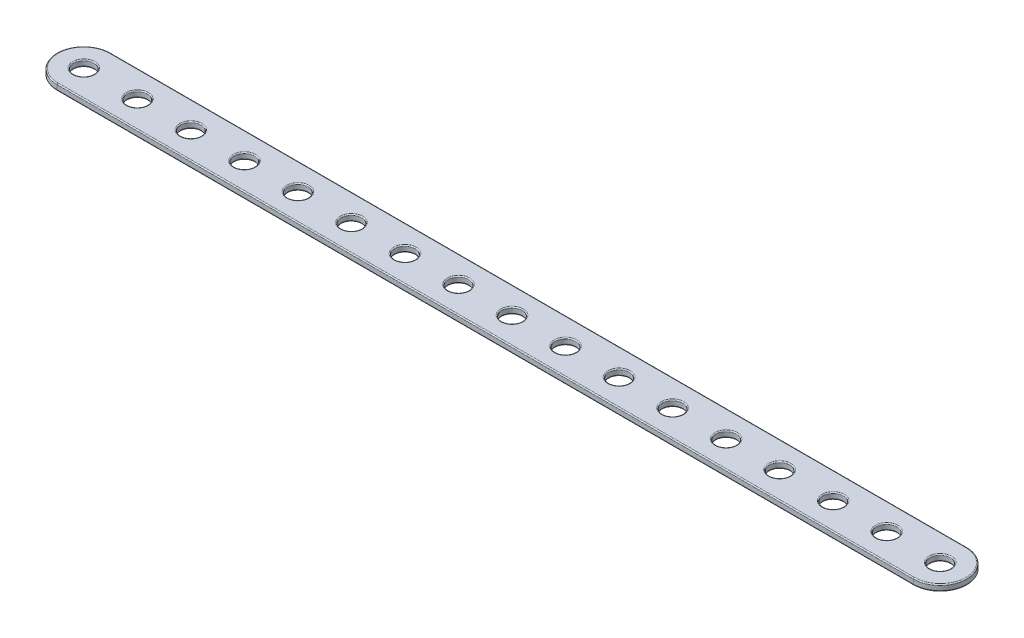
ISO-10303-21;
HEADER;
FILE_DESCRIPTION(('STEP AP214'),'2;1');
FILE_NAME('part.step','',(''),(''),'','','');
FILE_SCHEMA(('AUTOMOTIVE_DESIGN { 1 0 10303 214 1 1 1 1 }'));
ENDSEC;
DATA;
#1=APPLICATION_CONTEXT('core data for automotive mechanical design processes');
#2=APPLICATION_PROTOCOL_DEFINITION('international standard','automotive_design',2000,#1);
#3=PRODUCT_CONTEXT('',#1,'mechanical');
#4=PRODUCT('Part','Part','',(#3));
#5=PRODUCT_RELATED_PRODUCT_CATEGORY('part','',(#4));
#6=PRODUCT_DEFINITION_FORMATION('','',#4);
#7=PRODUCT_DEFINITION_CONTEXT('part definition',#1,'design');
#8=PRODUCT_DEFINITION('design','',#6,#7);
#9=PRODUCT_DEFINITION_SHAPE('','',#8);
#10=(LENGTH_UNIT() NAMED_UNIT(*) SI_UNIT(.MILLI.,.METRE.));
#11=(NAMED_UNIT(*) PLANE_ANGLE_UNIT() SI_UNIT($,.RADIAN.));
#12=(NAMED_UNIT(*) SI_UNIT($,.STERADIAN.) SOLID_ANGLE_UNIT());
#13=UNCERTAINTY_MEASURE_WITH_UNIT(LENGTH_MEASURE(1.E-05),#10,'distance_accuracy_value','');
#14=(GEOMETRIC_REPRESENTATION_CONTEXT(3) GLOBAL_UNCERTAINTY_ASSIGNED_CONTEXT((#13)) GLOBAL_UNIT_ASSIGNED_CONTEXT((#10,
#11,#12)) REPRESENTATION_CONTEXT('',''));
#15=CARTESIAN_POINT('',(0.,0.,0.));
#16=DIRECTION('',(0.,0.,1.));
#17=DIRECTION('',(1.,0.,0.));
#18=AXIS2_PLACEMENT_3D('',#15,#16,#17);
#19=CARTESIAN_POINT('',(0.,1.524,-6.35));
#20=DIRECTION('',(0.,-1.,0.));
#21=DIRECTION('',(0.,0.,-1.));
#22=AXIS2_PLACEMENT_3D('',#19,#20,#21);
#23=CYLINDRICAL_SURFACE('',#22,6.35);
#24=DIRECTION('',(0.,-1.,0.));
#25=VECTOR('',#24,1.);
#26=CARTESIAN_POINT('',(0.,1.524,-12.7));
#27=LINE('',#26,#25);
#28=CARTESIAN_POINT('',(0.,1.27,-12.7));
#29=VERTEX_POINT('',#28);
#30=CARTESIAN_POINT('',(0.,0.254000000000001,-12.7));
#31=VERTEX_POINT('',#30);
#32=EDGE_CURVE('E136',#29,#31,#27,.T.);
#33=ORIENTED_EDGE('',*,*,#32,.T.);
#34=CARTESIAN_POINT('',(0.,0.254,-6.35));
#35=DIRECTION('',(0.,1.,0.));
#36=DIRECTION('',(0.,0.,1.));
#37=AXIS2_PLACEMENT_3D('',#34,#35,#36);
#38=CIRCLE('',#37,6.35);
#39=CARTESIAN_POINT('',(0.,0.254000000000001,0.));
#40=VERTEX_POINT('',#39);
#41=EDGE_CURVE('E208',#31,#40,#38,.T.);
#42=ORIENTED_EDGE('',*,*,#41,.T.);
#43=DIRECTION('',(0.,-1.,0.));
#44=VECTOR('',#43,1.);
#45=CARTESIAN_POINT('',(0.,1.524,0.));
#46=LINE('',#45,#44);
#47=CARTESIAN_POINT('',(0.,1.27,0.));
#48=VERTEX_POINT('',#47);
#49=EDGE_CURVE('E110',#48,#40,#46,.T.);
#50=ORIENTED_EDGE('',*,*,#49,.F.);
#51=CARTESIAN_POINT('',(0.,1.27,-6.35));
#52=DIRECTION('',(0.,1.,0.));
#53=DIRECTION('',(0.,0.,1.));
#54=AXIS2_PLACEMENT_3D('',#51,#52,#53);
#55=CIRCLE('',#54,6.35);
#56=EDGE_CURVE('E206',#48,#29,#55,.F.);
#57=ORIENTED_EDGE('',*,*,#56,.T.);
#58=EDGE_LOOP('',(#33,#42,#50,#57));
#59=FACE_BOUND('',#58,.T.);
#60=ADVANCED_FACE('F26',(#59),#23,.T.);
#61=CARTESIAN_POINT('',(0.,1.524,0.));
#62=DIRECTION('',(0.,0.,-1.));
#63=DIRECTION('',(-1.,0.,0.));
#64=AXIS2_PLACEMENT_3D('',#61,#62,#63);
#65=PLANE('',#64);
#66=ORIENTED_EDGE('',*,*,#49,.T.);
#67=DIRECTION('',(1.,0.,0.));
#68=VECTOR('',#67,1.);
#69=CARTESIAN_POINT('',(0.,0.254,0.));
#70=LINE('',#69,#68);
#71=CARTESIAN_POINT('',(203.2,0.254000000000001,0.));
#72=VERTEX_POINT('',#71);
#73=EDGE_CURVE('E109',#40,#72,#70,.T.);
#74=ORIENTED_EDGE('',*,*,#73,.T.);
#75=DIRECTION('',(0.,-1.,0.));
#76=VECTOR('',#75,1.);
#77=CARTESIAN_POINT('',(203.2,1.524,0.));
#78=LINE('',#77,#76);
#79=CARTESIAN_POINT('',(203.2,1.27,0.));
#80=VERTEX_POINT('',#79);
#81=EDGE_CURVE('E92',#80,#72,#78,.T.);
#82=ORIENTED_EDGE('',*,*,#81,.F.);
#83=DIRECTION('',(1.,0.,0.));
#84=VECTOR('',#83,1.);
#85=CARTESIAN_POINT('',(0.,1.27,0.));
#86=LINE('',#85,#84);
#87=EDGE_CURVE('E106',#80,#48,#86,.F.);
#88=ORIENTED_EDGE('',*,*,#87,.T.);
#89=EDGE_LOOP('',(#66,#74,#82,#88));
#90=FACE_BOUND('',#89,.T.);
#91=ADVANCED_FACE('F105',(#90),#65,.F.);
#92=CARTESIAN_POINT('',(203.2,1.524,-6.35));
#93=DIRECTION('',(0.,-1.,0.));
#94=DIRECTION('',(0.,0.,-1.));
#95=AXIS2_PLACEMENT_3D('',#92,#93,#94);
#96=CYLINDRICAL_SURFACE('',#95,6.35);
#97=ORIENTED_EDGE('',*,*,#81,.T.);
#98=CARTESIAN_POINT('',(203.2,0.254,-6.35));
#99=DIRECTION('',(0.,1.,0.));
#100=DIRECTION('',(0.,0.,1.));
#101=AXIS2_PLACEMENT_3D('',#98,#99,#100);
#102=CIRCLE('',#101,6.35);
#103=CARTESIAN_POINT('',(203.2,0.254000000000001,-12.7));
#104=VERTEX_POINT('',#103);
#105=EDGE_CURVE('E98',#72,#104,#102,.T.);
#106=ORIENTED_EDGE('',*,*,#105,.T.);
#107=DIRECTION('',(0.,-1.,0.));
#108=VECTOR('',#107,1.);
#109=CARTESIAN_POINT('',(203.2,1.524,-12.7));
#110=LINE('',#109,#108);
#111=CARTESIAN_POINT('',(203.2,1.27,-12.7));
#112=VERTEX_POINT('',#111);
#113=EDGE_CURVE('E94',#112,#104,#110,.T.);
#114=ORIENTED_EDGE('',*,*,#113,.F.);
#115=CARTESIAN_POINT('',(203.2,1.27,-6.35));
#116=DIRECTION('',(0.,1.,0.));
#117=DIRECTION('',(0.,0.,1.));
#118=AXIS2_PLACEMENT_3D('',#115,#116,#117);
#119=CIRCLE('',#118,6.35);
#120=EDGE_CURVE('E89',#112,#80,#119,.F.);
#121=ORIENTED_EDGE('',*,*,#120,.T.);
#122=EDGE_LOOP('',(#97,#106,#114,#121));
#123=FACE_BOUND('',#122,.T.);
#124=ADVANCED_FACE('F91',(#123),#96,.T.);
#125=CARTESIAN_POINT('',(0.,1.524,-12.7));
#126=DIRECTION('',(0.,0.,1.));
#127=DIRECTION('',(1.,0.,0.));
#128=AXIS2_PLACEMENT_3D('',#125,#126,#127);
#129=PLANE('',#128);
#130=ORIENTED_EDGE('',*,*,#113,.T.);
#131=DIRECTION('',(-1.,0.,0.));
#132=VECTOR('',#131,1.);
#133=CARTESIAN_POINT('',(0.,0.254,-12.7));
#134=LINE('',#133,#132);
#135=EDGE_CURVE('E204',#104,#31,#134,.T.);
#136=ORIENTED_EDGE('',*,*,#135,.T.);
#137=ORIENTED_EDGE('',*,*,#32,.F.);
#138=DIRECTION('',(-1.,0.,0.));
#139=VECTOR('',#138,1.);
#140=CARTESIAN_POINT('',(203.2,1.27,-12.7));
#141=LINE('',#140,#139);
#142=EDGE_CURVE('E202',#29,#112,#141,.F.);
#143=ORIENTED_EDGE('',*,*,#142,.T.);
#144=EDGE_LOOP('',(#130,#136,#137,#143));
#145=FACE_BOUND('',#144,.T.);
#146=ADVANCED_FACE('F378',(#145),#129,.F.);
#147=CARTESIAN_POINT('',(0.,1.524,-6.35));
#148=DIRECTION('',(0.,1.,0.));
#149=DIRECTION('',(0.,0.,1.));
#150=AXIS2_PLACEMENT_3D('',#147,#148,#149);
#151=PLANE('',#150);
#152=CARTESIAN_POINT('',(203.2,1.524,-6.35));
#153=DIRECTION('',(0.,1.,0.));
#154=DIRECTION('',(0.,0.,1.));
#155=AXIS2_PLACEMENT_3D('',#152,#153,#154);
#156=CIRCLE('',#155,6.096);
#157=CARTESIAN_POINT('',(203.2,1.524,-0.254));
#158=VERTEX_POINT('',#157);
#159=CARTESIAN_POINT('',(203.2,1.524,-12.446));
#160=VERTEX_POINT('',#159);
#161=EDGE_CURVE('E33',#158,#160,#156,.T.);
#162=ORIENTED_EDGE('',*,*,#161,.T.);
#163=DIRECTION('',(-1.,0.,0.));
#164=VECTOR('',#163,1.);
#165=CARTESIAN_POINT('',(0.,1.524,-12.446));
#166=LINE('',#165,#164);
#167=CARTESIAN_POINT('',(0.,1.524,-12.446));
#168=VERTEX_POINT('',#167);
#169=EDGE_CURVE('E11',#160,#168,#166,.T.);
#170=ORIENTED_EDGE('',*,*,#169,.T.);
#171=CARTESIAN_POINT('',(0.,1.524,-6.35));
#172=DIRECTION('',(0.,1.,0.));
#173=DIRECTION('',(0.,0.,1.));
#174=AXIS2_PLACEMENT_3D('',#171,#172,#173);
#175=CIRCLE('',#174,6.096);
#176=CARTESIAN_POINT('',(0.,1.524,-0.254));
#177=VERTEX_POINT('',#176);
#178=EDGE_CURVE('E363',#168,#177,#175,.T.);
#179=ORIENTED_EDGE('',*,*,#178,.T.);
#180=DIRECTION('',(1.,0.,0.));
#181=VECTOR('',#180,1.);
#182=CARTESIAN_POINT('',(203.2,1.524,-0.254));
#183=LINE('',#182,#181);
#184=EDGE_CURVE('E43',#177,#158,#183,.T.);
#185=ORIENTED_EDGE('',*,*,#184,.T.);
#186=EDGE_LOOP('',(#162,#170,#179,#185));
#187=FACE_BOUND('',#186,.T.);
#188=CARTESIAN_POINT('',(0.,1.524,-6.35));
#189=DIRECTION('',(0.,1.,0.));
#190=DIRECTION('',(0.,0.,1.));
#191=AXIS2_PLACEMENT_3D('',#188,#189,#190);
#192=CIRCLE('',#191,2.667);
#193=CARTESIAN_POINT('',(0.,1.524,-3.683));
#194=VERTEX_POINT('',#193);
#195=EDGE_CURVE('E360',#194,#194,#192,.F.);
#196=ORIENTED_EDGE('',*,*,#195,.T.);
#197=EDGE_LOOP('',(#196));
#198=FACE_BOUND('',#197,.T.);
#199=CARTESIAN_POINT('',(12.7,1.524,-6.35));
#200=DIRECTION('',(0.,1.,0.));
#201=DIRECTION('',(0.,0.,1.));
#202=AXIS2_PLACEMENT_3D('',#199,#200,#201);
#203=CIRCLE('',#202,2.667);
#204=CARTESIAN_POINT('',(12.7,1.524,-3.683));
#205=VERTEX_POINT('',#204);
#206=EDGE_CURVE('E357',#205,#205,#203,.F.);
#207=ORIENTED_EDGE('',*,*,#206,.T.);
#208=EDGE_LOOP('',(#207));
#209=FACE_BOUND('',#208,.T.);
#210=CARTESIAN_POINT('',(25.4,1.524,-6.35));
#211=DIRECTION('',(0.,1.,0.));
#212=DIRECTION('',(0.,0.,1.));
#213=AXIS2_PLACEMENT_3D('',#210,#211,#212);
#214=CIRCLE('',#213,2.667);
#215=CARTESIAN_POINT('',(25.4,1.524,-3.683));
#216=VERTEX_POINT('',#215);
#217=EDGE_CURVE('E354',#216,#216,#214,.F.);
#218=ORIENTED_EDGE('',*,*,#217,.T.);
#219=EDGE_LOOP('',(#218));
#220=FACE_BOUND('',#219,.T.);
#221=CARTESIAN_POINT('',(38.1,1.524,-6.35));
#222=DIRECTION('',(0.,1.,0.));
#223=DIRECTION('',(0.,0.,1.));
#224=AXIS2_PLACEMENT_3D('',#221,#222,#223);
#225=CIRCLE('',#224,2.667);
#226=CARTESIAN_POINT('',(38.1,1.524,-3.683));
#227=VERTEX_POINT('',#226);
#228=EDGE_CURVE('E351',#227,#227,#225,.F.);
#229=ORIENTED_EDGE('',*,*,#228,.T.);
#230=EDGE_LOOP('',(#229));
#231=FACE_BOUND('',#230,.T.);
#232=CARTESIAN_POINT('',(50.8,1.524,-6.35));
#233=DIRECTION('',(0.,1.,0.));
#234=DIRECTION('',(0.,0.,1.));
#235=AXIS2_PLACEMENT_3D('',#232,#233,#234);
#236=CIRCLE('',#235,2.667);
#237=CARTESIAN_POINT('',(50.8,1.524,-3.683));
#238=VERTEX_POINT('',#237);
#239=EDGE_CURVE('E348',#238,#238,#236,.F.);
#240=ORIENTED_EDGE('',*,*,#239,.T.);
#241=EDGE_LOOP('',(#240));
#242=FACE_BOUND('',#241,.T.);
#243=CARTESIAN_POINT('',(63.5,1.524,-6.35));
#244=DIRECTION('',(0.,1.,0.));
#245=DIRECTION('',(0.,0.,1.));
#246=AXIS2_PLACEMENT_3D('',#243,#244,#245);
#247=CIRCLE('',#246,2.667);
#248=CARTESIAN_POINT('',(63.5,1.524,-3.683));
#249=VERTEX_POINT('',#248);
#250=EDGE_CURVE('E345',#249,#249,#247,.F.);
#251=ORIENTED_EDGE('',*,*,#250,.T.);
#252=EDGE_LOOP('',(#251));
#253=FACE_BOUND('',#252,.T.);
#254=CARTESIAN_POINT('',(76.2,1.524,-6.35));
#255=DIRECTION('',(0.,1.,0.));
#256=DIRECTION('',(0.,0.,1.));
#257=AXIS2_PLACEMENT_3D('',#254,#255,#256);
#258=CIRCLE('',#257,2.667);
#259=CARTESIAN_POINT('',(76.2,1.524,-3.683));
#260=VERTEX_POINT('',#259);
#261=EDGE_CURVE('E342',#260,#260,#258,.F.);
#262=ORIENTED_EDGE('',*,*,#261,.T.);
#263=EDGE_LOOP('',(#262));
#264=FACE_BOUND('',#263,.T.);
#265=CARTESIAN_POINT('',(88.9,1.524,-6.35));
#266=DIRECTION('',(0.,1.,0.));
#267=DIRECTION('',(0.,0.,1.));
#268=AXIS2_PLACEMENT_3D('',#265,#266,#267);
#269=CIRCLE('',#268,2.667);
#270=CARTESIAN_POINT('',(88.9,1.524,-3.683));
#271=VERTEX_POINT('',#270);
#272=EDGE_CURVE('E339',#271,#271,#269,.F.);
#273=ORIENTED_EDGE('',*,*,#272,.T.);
#274=EDGE_LOOP('',(#273));
#275=FACE_BOUND('',#274,.T.);
#276=CARTESIAN_POINT('',(101.6,1.524,-6.35));
#277=DIRECTION('',(0.,1.,0.));
#278=DIRECTION('',(0.,0.,1.));
#279=AXIS2_PLACEMENT_3D('',#276,#277,#278);
#280=CIRCLE('',#279,2.667);
#281=CARTESIAN_POINT('',(101.6,1.524,-3.683));
#282=VERTEX_POINT('',#281);
#283=EDGE_CURVE('E336',#282,#282,#280,.F.);
#284=ORIENTED_EDGE('',*,*,#283,.T.);
#285=EDGE_LOOP('',(#284));
#286=FACE_BOUND('',#285,.T.);
#287=CARTESIAN_POINT('',(114.3,1.524,-6.35));
#288=DIRECTION('',(0.,1.,0.));
#289=DIRECTION('',(0.,0.,1.));
#290=AXIS2_PLACEMENT_3D('',#287,#288,#289);
#291=CIRCLE('',#290,2.667);
#292=CARTESIAN_POINT('',(114.3,1.524,-3.683));
#293=VERTEX_POINT('',#292);
#294=EDGE_CURVE('E333',#293,#293,#291,.F.);
#295=ORIENTED_EDGE('',*,*,#294,.T.);
#296=EDGE_LOOP('',(#295));
#297=FACE_BOUND('',#296,.T.);
#298=CARTESIAN_POINT('',(127.,1.524,-6.35));
#299=DIRECTION('',(0.,1.,0.));
#300=DIRECTION('',(0.,0.,1.));
#301=AXIS2_PLACEMENT_3D('',#298,#299,#300);
#302=CIRCLE('',#301,2.667);
#303=CARTESIAN_POINT('',(127.,1.524,-3.683));
#304=VERTEX_POINT('',#303);
#305=EDGE_CURVE('E330',#304,#304,#302,.F.);
#306=ORIENTED_EDGE('',*,*,#305,.T.);
#307=EDGE_LOOP('',(#306));
#308=FACE_BOUND('',#307,.T.);
#309=CARTESIAN_POINT('',(139.7,1.524,-6.35));
#310=DIRECTION('',(0.,1.,0.));
#311=DIRECTION('',(0.,0.,1.));
#312=AXIS2_PLACEMENT_3D('',#309,#310,#311);
#313=CIRCLE('',#312,2.667);
#314=CARTESIAN_POINT('',(139.7,1.524,-3.683));
#315=VERTEX_POINT('',#314);
#316=EDGE_CURVE('E327',#315,#315,#313,.F.);
#317=ORIENTED_EDGE('',*,*,#316,.T.);
#318=EDGE_LOOP('',(#317));
#319=FACE_BOUND('',#318,.T.);
#320=CARTESIAN_POINT('',(152.4,1.524,-6.35));
#321=DIRECTION('',(0.,1.,0.));
#322=DIRECTION('',(0.,0.,1.));
#323=AXIS2_PLACEMENT_3D('',#320,#321,#322);
#324=CIRCLE('',#323,2.667);
#325=CARTESIAN_POINT('',(152.4,1.524,-3.683));
#326=VERTEX_POINT('',#325);
#327=EDGE_CURVE('E324',#326,#326,#324,.F.);
#328=ORIENTED_EDGE('',*,*,#327,.T.);
#329=EDGE_LOOP('',(#328));
#330=FACE_BOUND('',#329,.T.);
#331=CARTESIAN_POINT('',(165.1,1.524,-6.35));
#332=DIRECTION('',(0.,1.,0.));
#333=DIRECTION('',(0.,0.,1.));
#334=AXIS2_PLACEMENT_3D('',#331,#332,#333);
#335=CIRCLE('',#334,2.667);
#336=CARTESIAN_POINT('',(165.1,1.524,-3.683));
#337=VERTEX_POINT('',#336);
#338=EDGE_CURVE('E321',#337,#337,#335,.F.);
#339=ORIENTED_EDGE('',*,*,#338,.T.);
#340=EDGE_LOOP('',(#339));
#341=FACE_BOUND('',#340,.T.);
#342=CARTESIAN_POINT('',(177.8,1.524,-6.35));
#343=DIRECTION('',(0.,1.,0.));
#344=DIRECTION('',(0.,0.,1.));
#345=AXIS2_PLACEMENT_3D('',#342,#343,#344);
#346=CIRCLE('',#345,2.667);
#347=CARTESIAN_POINT('',(177.8,1.524,-3.683));
#348=VERTEX_POINT('',#347);
#349=EDGE_CURVE('E318',#348,#348,#346,.F.);
#350=ORIENTED_EDGE('',*,*,#349,.T.);
#351=EDGE_LOOP('',(#350));
#352=FACE_BOUND('',#351,.T.);
#353=CARTESIAN_POINT('',(190.5,1.524,-6.35));
#354=DIRECTION('',(0.,1.,0.));
#355=DIRECTION('',(0.,0.,1.));
#356=AXIS2_PLACEMENT_3D('',#353,#354,#355);
#357=CIRCLE('',#356,2.667);
#358=CARTESIAN_POINT('',(190.5,1.524,-3.683));
#359=VERTEX_POINT('',#358);
#360=EDGE_CURVE('E315',#359,#359,#357,.F.);
#361=ORIENTED_EDGE('',*,*,#360,.T.);
#362=EDGE_LOOP('',(#361));
#363=FACE_BOUND('',#362,.T.);
#364=CARTESIAN_POINT('',(203.2,1.524,-6.35));
#365=DIRECTION('',(0.,1.,0.));
#366=DIRECTION('',(0.,0.,1.));
#367=AXIS2_PLACEMENT_3D('',#364,#365,#366);
#368=CIRCLE('',#367,2.667);
#369=CARTESIAN_POINT('',(203.2,1.524,-3.683));
#370=VERTEX_POINT('',#369);
#371=EDGE_CURVE('E312',#370,#370,#368,.F.);
#372=ORIENTED_EDGE('',*,*,#371,.T.);
#373=EDGE_LOOP('',(#372));
#374=FACE_BOUND('',#373,.T.);
#375=ADVANCED_FACE('F366',(#187,#198,#209,#220,#231,#242,#253,#264,#275,#286,#297,#308,#319,
#330,#341,#352,#363,#374),#151,.T.);
#376=CARTESIAN_POINT('',(0.,0.,-6.35));
#377=DIRECTION('',(0.,1.,0.));
#378=DIRECTION('',(0.,0.,1.));
#379=AXIS2_PLACEMENT_3D('',#376,#377,#378);
#380=PLANE('',#379);
#381=CARTESIAN_POINT('',(203.2,0.,-6.35));
#382=DIRECTION('',(0.,1.,0.));
#383=DIRECTION('',(0.,0.,1.));
#384=AXIS2_PLACEMENT_3D('',#381,#382,#383);
#385=CIRCLE('',#384,6.096);
#386=CARTESIAN_POINT('',(203.2,0.,-12.446));
#387=VERTEX_POINT('',#386);
#388=CARTESIAN_POINT('',(203.2,0.,-0.254));
#389=VERTEX_POINT('',#388);
#390=EDGE_CURVE('E197',#387,#389,#385,.F.);
#391=ORIENTED_EDGE('',*,*,#390,.T.);
#392=DIRECTION('',(1.,0.,0.));
#393=VECTOR('',#392,1.);
#394=CARTESIAN_POINT('',(0.,0.,-0.254));
#395=LINE('',#394,#393);
#396=CARTESIAN_POINT('',(0.,0.,-0.254));
#397=VERTEX_POINT('',#396);
#398=EDGE_CURVE('E99',#389,#397,#395,.F.);
#399=ORIENTED_EDGE('',*,*,#398,.T.);
#400=CARTESIAN_POINT('',(0.,0.,-6.35));
#401=DIRECTION('',(0.,1.,0.));
#402=DIRECTION('',(0.,0.,1.));
#403=AXIS2_PLACEMENT_3D('',#400,#401,#402);
#404=CIRCLE('',#403,6.096);
#405=CARTESIAN_POINT('',(0.,0.,-12.446));
#406=VERTEX_POINT('',#405);
#407=EDGE_CURVE('E193',#397,#406,#404,.F.);
#408=ORIENTED_EDGE('',*,*,#407,.T.);
#409=DIRECTION('',(-1.,0.,0.));
#410=VECTOR('',#409,1.);
#411=CARTESIAN_POINT('',(0.,0.,-12.446));
#412=LINE('',#411,#410);
#413=EDGE_CURVE('E195',#406,#387,#412,.F.);
#414=ORIENTED_EDGE('',*,*,#413,.T.);
#415=EDGE_LOOP('',(#391,#399,#408,#414));
#416=FACE_BOUND('',#415,.T.);
#417=CARTESIAN_POINT('',(0.,0.,-6.35));
#418=DIRECTION('',(0.,1.,0.));
#419=DIRECTION('',(0.,0.,1.));
#420=AXIS2_PLACEMENT_3D('',#417,#418,#419);
#421=CIRCLE('',#420,2.667);
#422=CARTESIAN_POINT('',(0.,0.,-3.683));
#423=VERTEX_POINT('',#422);
#424=EDGE_CURVE('E190',#423,#423,#421,.T.);
#425=ORIENTED_EDGE('',*,*,#424,.T.);
#426=EDGE_LOOP('',(#425));
#427=FACE_BOUND('',#426,.T.);
#428=CARTESIAN_POINT('',(12.7,0.,-6.35));
#429=DIRECTION('',(0.,1.,0.));
#430=DIRECTION('',(0.,0.,1.));
#431=AXIS2_PLACEMENT_3D('',#428,#429,#430);
#432=CIRCLE('',#431,2.667);
#433=CARTESIAN_POINT('',(12.7,0.,-3.683));
#434=VERTEX_POINT('',#433);
#435=EDGE_CURVE('E187',#434,#434,#432,.T.);
#436=ORIENTED_EDGE('',*,*,#435,.T.);
#437=EDGE_LOOP('',(#436));
#438=FACE_BOUND('',#437,.T.);
#439=CARTESIAN_POINT('',(25.4,0.,-6.35));
#440=DIRECTION('',(0.,1.,0.));
#441=DIRECTION('',(0.,0.,1.));
#442=AXIS2_PLACEMENT_3D('',#439,#440,#441);
#443=CIRCLE('',#442,2.667);
#444=CARTESIAN_POINT('',(25.4,0.,-3.683));
#445=VERTEX_POINT('',#444);
#446=EDGE_CURVE('E184',#445,#445,#443,.T.);
#447=ORIENTED_EDGE('',*,*,#446,.T.);
#448=EDGE_LOOP('',(#447));
#449=FACE_BOUND('',#448,.T.);
#450=CARTESIAN_POINT('',(38.1,0.,-6.35));
#451=DIRECTION('',(0.,1.,0.));
#452=DIRECTION('',(0.,0.,1.));
#453=AXIS2_PLACEMENT_3D('',#450,#451,#452);
#454=CIRCLE('',#453,2.667);
#455=CARTESIAN_POINT('',(38.1,0.,-3.683));
#456=VERTEX_POINT('',#455);
#457=EDGE_CURVE('E181',#456,#456,#454,.T.);
#458=ORIENTED_EDGE('',*,*,#457,.T.);
#459=EDGE_LOOP('',(#458));
#460=FACE_BOUND('',#459,.T.);
#461=CARTESIAN_POINT('',(50.8,0.,-6.35));
#462=DIRECTION('',(0.,1.,0.));
#463=DIRECTION('',(0.,0.,1.));
#464=AXIS2_PLACEMENT_3D('',#461,#462,#463);
#465=CIRCLE('',#464,2.667);
#466=CARTESIAN_POINT('',(50.8,0.,-3.683));
#467=VERTEX_POINT('',#466);
#468=EDGE_CURVE('E178',#467,#467,#465,.T.);
#469=ORIENTED_EDGE('',*,*,#468,.T.);
#470=EDGE_LOOP('',(#469));
#471=FACE_BOUND('',#470,.T.);
#472=CARTESIAN_POINT('',(63.5,0.,-6.35));
#473=DIRECTION('',(0.,1.,0.));
#474=DIRECTION('',(0.,0.,1.));
#475=AXIS2_PLACEMENT_3D('',#472,#473,#474);
#476=CIRCLE('',#475,2.667);
#477=CARTESIAN_POINT('',(63.5,0.,-3.683));
#478=VERTEX_POINT('',#477);
#479=EDGE_CURVE('E175',#478,#478,#476,.T.);
#480=ORIENTED_EDGE('',*,*,#479,.T.);
#481=EDGE_LOOP('',(#480));
#482=FACE_BOUND('',#481,.T.);
#483=CARTESIAN_POINT('',(76.2,0.,-6.35));
#484=DIRECTION('',(0.,1.,0.));
#485=DIRECTION('',(0.,0.,1.));
#486=AXIS2_PLACEMENT_3D('',#483,#484,#485);
#487=CIRCLE('',#486,2.667);
#488=CARTESIAN_POINT('',(76.2,0.,-3.683));
#489=VERTEX_POINT('',#488);
#490=EDGE_CURVE('E172',#489,#489,#487,.T.);
#491=ORIENTED_EDGE('',*,*,#490,.T.);
#492=EDGE_LOOP('',(#491));
#493=FACE_BOUND('',#492,.T.);
#494=CARTESIAN_POINT('',(88.9,0.,-6.35));
#495=DIRECTION('',(0.,1.,0.));
#496=DIRECTION('',(0.,0.,1.));
#497=AXIS2_PLACEMENT_3D('',#494,#495,#496);
#498=CIRCLE('',#497,2.667);
#499=CARTESIAN_POINT('',(88.9,0.,-3.683));
#500=VERTEX_POINT('',#499);
#501=EDGE_CURVE('E169',#500,#500,#498,.T.);
#502=ORIENTED_EDGE('',*,*,#501,.T.);
#503=EDGE_LOOP('',(#502));
#504=FACE_BOUND('',#503,.T.);
#505=CARTESIAN_POINT('',(101.6,0.,-6.35));
#506=DIRECTION('',(0.,1.,0.));
#507=DIRECTION('',(0.,0.,1.));
#508=AXIS2_PLACEMENT_3D('',#505,#506,#507);
#509=CIRCLE('',#508,2.667);
#510=CARTESIAN_POINT('',(101.6,0.,-3.683));
#511=VERTEX_POINT('',#510);
#512=EDGE_CURVE('E166',#511,#511,#509,.T.);
#513=ORIENTED_EDGE('',*,*,#512,.T.);
#514=EDGE_LOOP('',(#513));
#515=FACE_BOUND('',#514,.T.);
#516=CARTESIAN_POINT('',(114.3,0.,-6.35));
#517=DIRECTION('',(0.,1.,0.));
#518=DIRECTION('',(0.,0.,1.));
#519=AXIS2_PLACEMENT_3D('',#516,#517,#518);
#520=CIRCLE('',#519,2.667);
#521=CARTESIAN_POINT('',(114.3,0.,-3.683));
#522=VERTEX_POINT('',#521);
#523=EDGE_CURVE('E163',#522,#522,#520,.T.);
#524=ORIENTED_EDGE('',*,*,#523,.T.);
#525=EDGE_LOOP('',(#524));
#526=FACE_BOUND('',#525,.T.);
#527=CARTESIAN_POINT('',(127.,0.,-6.35));
#528=DIRECTION('',(0.,1.,0.));
#529=DIRECTION('',(0.,0.,1.));
#530=AXIS2_PLACEMENT_3D('',#527,#528,#529);
#531=CIRCLE('',#530,2.667);
#532=CARTESIAN_POINT('',(127.,0.,-3.683));
#533=VERTEX_POINT('',#532);
#534=EDGE_CURVE('E160',#533,#533,#531,.T.);
#535=ORIENTED_EDGE('',*,*,#534,.T.);
#536=EDGE_LOOP('',(#535));
#537=FACE_BOUND('',#536,.T.);
#538=CARTESIAN_POINT('',(139.7,0.,-6.35));
#539=DIRECTION('',(0.,1.,0.));
#540=DIRECTION('',(0.,0.,1.));
#541=AXIS2_PLACEMENT_3D('',#538,#539,#540);
#542=CIRCLE('',#541,2.667);
#543=CARTESIAN_POINT('',(139.7,0.,-3.683));
#544=VERTEX_POINT('',#543);
#545=EDGE_CURVE('E157',#544,#544,#542,.T.);
#546=ORIENTED_EDGE('',*,*,#545,.T.);
#547=EDGE_LOOP('',(#546));
#548=FACE_BOUND('',#547,.T.);
#549=CARTESIAN_POINT('',(152.4,0.,-6.35));
#550=DIRECTION('',(0.,1.,0.));
#551=DIRECTION('',(0.,0.,1.));
#552=AXIS2_PLACEMENT_3D('',#549,#550,#551);
#553=CIRCLE('',#552,2.667);
#554=CARTESIAN_POINT('',(152.4,0.,-3.683));
#555=VERTEX_POINT('',#554);
#556=EDGE_CURVE('E154',#555,#555,#553,.T.);
#557=ORIENTED_EDGE('',*,*,#556,.T.);
#558=EDGE_LOOP('',(#557));
#559=FACE_BOUND('',#558,.T.);
#560=CARTESIAN_POINT('',(165.1,0.,-6.35));
#561=DIRECTION('',(0.,1.,0.));
#562=DIRECTION('',(0.,0.,1.));
#563=AXIS2_PLACEMENT_3D('',#560,#561,#562);
#564=CIRCLE('',#563,2.667);
#565=CARTESIAN_POINT('',(165.1,0.,-3.683));
#566=VERTEX_POINT('',#565);
#567=EDGE_CURVE('E151',#566,#566,#564,.T.);
#568=ORIENTED_EDGE('',*,*,#567,.T.);
#569=EDGE_LOOP('',(#568));
#570=FACE_BOUND('',#569,.T.);
#571=CARTESIAN_POINT('',(177.8,0.,-6.35));
#572=DIRECTION('',(0.,1.,0.));
#573=DIRECTION('',(0.,0.,1.));
#574=AXIS2_PLACEMENT_3D('',#571,#572,#573);
#575=CIRCLE('',#574,2.667);
#576=CARTESIAN_POINT('',(177.8,0.,-3.683));
#577=VERTEX_POINT('',#576);
#578=EDGE_CURVE('E148',#577,#577,#575,.T.);
#579=ORIENTED_EDGE('',*,*,#578,.T.);
#580=EDGE_LOOP('',(#579));
#581=FACE_BOUND('',#580,.T.);
#582=CARTESIAN_POINT('',(190.5,0.,-6.35));
#583=DIRECTION('',(0.,1.,0.));
#584=DIRECTION('',(0.,0.,1.));
#585=AXIS2_PLACEMENT_3D('',#582,#583,#584);
#586=CIRCLE('',#585,2.667);
#587=CARTESIAN_POINT('',(190.5,0.,-3.683));
#588=VERTEX_POINT('',#587);
#589=EDGE_CURVE('E145',#588,#588,#586,.T.);
#590=ORIENTED_EDGE('',*,*,#589,.T.);
#591=EDGE_LOOP('',(#590));
#592=FACE_BOUND('',#591,.T.);
#593=CARTESIAN_POINT('',(203.2,0.,-6.35));
#594=DIRECTION('',(0.,1.,0.));
#595=DIRECTION('',(0.,0.,1.));
#596=AXIS2_PLACEMENT_3D('',#593,#594,#595);
#597=CIRCLE('',#596,2.667);
#598=CARTESIAN_POINT('',(203.2,0.,-3.683));
#599=VERTEX_POINT('',#598);
#600=EDGE_CURVE('E142',#599,#599,#597,.T.);
#601=ORIENTED_EDGE('',*,*,#600,.T.);
#602=EDGE_LOOP('',(#601));
#603=FACE_BOUND('',#602,.T.);
#604=ADVANCED_FACE('F407',(#416,#427,#438,#449,#460,#471,#482,#493,#504,#515,#526,#537,#548,
#559,#570,#581,#592,#603),#380,.F.);
#605=CARTESIAN_POINT('',(0.,0.,-6.35));
#606=DIRECTION('',(0.,1.,0.));
#607=DIRECTION('',(0.,0.,1.));
#608=AXIS2_PLACEMENT_3D('',#605,#606,#607);
#609=CYLINDRICAL_SURFACE('',#608,2.413);
#610=CARTESIAN_POINT('',(0.,0.254,-6.35));
#611=DIRECTION('',(0.,1.,0.));
#612=DIRECTION('',(0.,0.,1.));
#613=AXIS2_PLACEMENT_3D('',#610,#611,#612);
#614=CIRCLE('',#613,2.413);
#615=CARTESIAN_POINT('',(0.,0.254,-3.937));
#616=VERTEX_POINT('',#615);
#617=EDGE_CURVE('E213',#616,#616,#614,.F.);
#618=CARTESIAN_POINT('',(0.,1.27,-6.35));
#619=DIRECTION('',(0.,1.,0.));
#620=DIRECTION('',(0.,0.,1.));
#621=AXIS2_PLACEMENT_3D('',#618,#619,#620);
#622=CIRCLE('',#621,2.413);
#623=CARTESIAN_POINT('',(0.,1.27,-3.937));
#624=VERTEX_POINT('',#623);
#625=EDGE_CURVE('E210',#624,#624,#622,.T.);
#626=CARTESIAN_POINT('',(0.,0.254,-3.937));
#627=CARTESIAN_POINT('',(0.,0.264583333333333,-3.937));
#628=CARTESIAN_POINT('',(0.,0.275166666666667,-3.937));
#629=CARTESIAN_POINT('',(0.,0.296333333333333,-3.937));
#630=CARTESIAN_POINT('',(0.,0.306916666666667,-3.937));
#631=CARTESIAN_POINT('',(0.,0.328083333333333,-3.937));
#632=CARTESIAN_POINT('',(0.,0.338666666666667,-3.937));
#633=CARTESIAN_POINT('',(0.,0.359833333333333,-3.937));
#634=CARTESIAN_POINT('',(0.,0.370416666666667,-3.937));
#635=CARTESIAN_POINT('',(0.,0.391583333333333,-3.937));
#636=CARTESIAN_POINT('',(0.,0.402166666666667,-3.937));
#637=CARTESIAN_POINT('',(0.,0.423333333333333,-3.937));
#638=CARTESIAN_POINT('',(0.,0.433916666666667,-3.937));
#639=CARTESIAN_POINT('',(0.,0.455083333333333,-3.937));
#640=CARTESIAN_POINT('',(0.,0.465666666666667,-3.937));
#641=CARTESIAN_POINT('',(0.,0.486833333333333,-3.937));
#642=CARTESIAN_POINT('',(0.,0.497416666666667,-3.937));
#643=CARTESIAN_POINT('',(0.,0.518583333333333,-3.937));
#644=CARTESIAN_POINT('',(0.,0.529166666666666,-3.937));
#645=CARTESIAN_POINT('',(0.,0.550333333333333,-3.937));
#646=CARTESIAN_POINT('',(0.,0.560916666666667,-3.937));
#647=CARTESIAN_POINT('',(0.,0.582083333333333,-3.937));
#648=CARTESIAN_POINT('',(0.,0.592666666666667,-3.937));
#649=CARTESIAN_POINT('',(0.,0.613833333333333,-3.937));
#650=CARTESIAN_POINT('',(0.,0.624416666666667,-3.937));
#651=CARTESIAN_POINT('',(0.,0.645583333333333,-3.937));
#652=CARTESIAN_POINT('',(0.,0.656166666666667,-3.937));
#653=CARTESIAN_POINT('',(0.,0.677333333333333,-3.937));
#654=CARTESIAN_POINT('',(0.,0.687916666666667,-3.937));
#655=CARTESIAN_POINT('',(0.,0.709083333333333,-3.937));
#656=CARTESIAN_POINT('',(0.,0.719666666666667,-3.937));
#657=CARTESIAN_POINT('',(0.,0.740833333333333,-3.937));
#658=CARTESIAN_POINT('',(0.,0.751416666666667,-3.937));
#659=CARTESIAN_POINT('',(0.,0.772583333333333,-3.937));
#660=CARTESIAN_POINT('',(0.,0.783166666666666,-3.937));
#661=CARTESIAN_POINT('',(0.,0.804333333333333,-3.937));
#662=CARTESIAN_POINT('',(0.,0.814916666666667,-3.937));
#663=CARTESIAN_POINT('',(0.,0.836083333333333,-3.937));
#664=CARTESIAN_POINT('',(0.,0.846666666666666,-3.937));
#665=CARTESIAN_POINT('',(0.,0.867833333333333,-3.937));
#666=CARTESIAN_POINT('',(0.,0.878416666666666,-3.937));
#667=CARTESIAN_POINT('',(0.,0.899583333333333,-3.937));
#668=CARTESIAN_POINT('',(0.,0.910166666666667,-3.937));
#669=CARTESIAN_POINT('',(0.,0.931333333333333,-3.937));
#670=CARTESIAN_POINT('',(0.,0.941916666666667,-3.937));
#671=CARTESIAN_POINT('',(0.,0.963083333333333,-3.937));
#672=CARTESIAN_POINT('',(0.,0.973666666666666,-3.937));
#673=CARTESIAN_POINT('',(0.,0.994833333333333,-3.937));
#674=CARTESIAN_POINT('',(0.,1.00541666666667,-3.937));
#675=CARTESIAN_POINT('',(0.,1.02658333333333,-3.937));
#676=CARTESIAN_POINT('',(0.,1.03716666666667,-3.937));
#677=CARTESIAN_POINT('',(0.,1.05833333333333,-3.937));
#678=CARTESIAN_POINT('',(0.,1.06891666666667,-3.937));
#679=CARTESIAN_POINT('',(0.,1.09008333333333,-3.937));
#680=CARTESIAN_POINT('',(0.,1.10066666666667,-3.937));
#681=CARTESIAN_POINT('',(0.,1.12183333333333,-3.937));
#682=CARTESIAN_POINT('',(0.,1.13241666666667,-3.937));
#683=CARTESIAN_POINT('',(0.,1.15358333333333,-3.937));
#684=CARTESIAN_POINT('',(0.,1.16416666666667,-3.937));
#685=CARTESIAN_POINT('',(0.,1.18533333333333,-3.937));
#686=CARTESIAN_POINT('',(0.,1.19591666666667,-3.937));
#687=CARTESIAN_POINT('',(0.,1.21708333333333,-3.937));
#688=CARTESIAN_POINT('',(0.,1.22766666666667,-3.937));
#689=CARTESIAN_POINT('',(0.,1.24883333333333,-3.937));
#690=CARTESIAN_POINT('',(0.,1.25941666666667,-3.937));
#691=CARTESIAN_POINT('',(0.,1.27,-3.937));
#692=B_SPLINE_CURVE_WITH_KNOTS('',3,(#626,#627,#628,#629,#630,#631,#632,#633,#634,#635,#636,
#637,#638,#639,#640,#641,#642,#643,#644,#645,#646,#647,#648,#649,#650,#651,#652,#653,#654,#655,
#656,#657,#658,#659,#660,#661,#662,#663,#664,#665,#666,#667,#668,#669,#670,#671,#672,#673,#674,
#675,#676,#677,#678,#679,#680,#681,#682,#683,#684,#685,#686,#687,#688,#689,#690,#691),
.UNSPECIFIED.,.F.,.F.,(4,2,2,2,2,2,2,2,2,2,2,2,2,2,2,2,2,2,2,2,2,2,2,2,2,2,2,2,2,2,2,2,4),(0.,
0.03175,0.0635,0.09525,0.127,0.15875,0.1905,0.22225,0.254,0.28575,0.3175,0.34925,0.381,0.41275,
0.4445,0.47625,0.508,0.53975,0.5715,0.60325,0.635,0.66675,0.6985,0.73025,0.762,0.79375,0.8255,
0.85725,0.889,0.92075,0.9525,0.98425,1.016),.UNSPECIFIED.);
#693=EDGE_CURVE('BSEAM410',#616,#624,#692,.T.);
#694=ORIENTED_EDGE('',*,*,#617,.T.);
#695=ORIENTED_EDGE('',*,*,#625,.T.);
#696=ORIENTED_EDGE('',*,*,#693,.T.);
#697=ORIENTED_EDGE('',*,*,#693,.F.);
#698=EDGE_LOOP('',(#694,#696,#695,#697));
#699=FACE_BOUND('',#698,.T.);
#700=ADVANCED_FACE('F410',(#699),#609,.F.);
#701=CARTESIAN_POINT('',(12.7,0.,-6.35));
#702=DIRECTION('',(0.,1.,0.));
#703=DIRECTION('',(0.,0.,1.));
#704=AXIS2_PLACEMENT_3D('',#701,#702,#703);
#705=CYLINDRICAL_SURFACE('',#704,2.413);
#706=CARTESIAN_POINT('',(12.7,0.254,-6.35));
#707=DIRECTION('',(0.,1.,0.));
#708=DIRECTION('',(0.,0.,1.));
#709=AXIS2_PLACEMENT_3D('',#706,#707,#708);
#710=CIRCLE('',#709,2.413);
#711=CARTESIAN_POINT('',(12.7,0.254,-3.937));
#712=VERTEX_POINT('',#711);
#713=EDGE_CURVE('E219',#712,#712,#710,.F.);
#714=CARTESIAN_POINT('',(12.7,1.27,-6.35));
#715=DIRECTION('',(0.,1.,0.));
#716=DIRECTION('',(0.,0.,1.));
#717=AXIS2_PLACEMENT_3D('',#714,#715,#716);
#718=CIRCLE('',#717,2.413);
#719=CARTESIAN_POINT('',(12.7,1.27,-3.937));
#720=VERTEX_POINT('',#719);
#721=EDGE_CURVE('E216',#720,#720,#718,.T.);
#722=CARTESIAN_POINT('',(12.7,0.254,-3.937));
#723=CARTESIAN_POINT('',(12.7,0.264583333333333,-3.937));
#724=CARTESIAN_POINT('',(12.7,0.275166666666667,-3.937));
#725=CARTESIAN_POINT('',(12.7,0.296333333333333,-3.937));
#726=CARTESIAN_POINT('',(12.7,0.306916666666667,-3.937));
#727=CARTESIAN_POINT('',(12.7,0.328083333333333,-3.937));
#728=CARTESIAN_POINT('',(12.7,0.338666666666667,-3.937));
#729=CARTESIAN_POINT('',(12.7,0.359833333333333,-3.937));
#730=CARTESIAN_POINT('',(12.7,0.370416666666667,-3.937));
#731=CARTESIAN_POINT('',(12.7,0.391583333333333,-3.937));
#732=CARTESIAN_POINT('',(12.7,0.402166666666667,-3.937));
#733=CARTESIAN_POINT('',(12.7,0.423333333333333,-3.937));
#734=CARTESIAN_POINT('',(12.7,0.433916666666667,-3.937));
#735=CARTESIAN_POINT('',(12.7,0.455083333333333,-3.937));
#736=CARTESIAN_POINT('',(12.7,0.465666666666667,-3.937));
#737=CARTESIAN_POINT('',(12.7,0.486833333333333,-3.937));
#738=CARTESIAN_POINT('',(12.7,0.497416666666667,-3.937));
#739=CARTESIAN_POINT('',(12.7,0.518583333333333,-3.937));
#740=CARTESIAN_POINT('',(12.7,0.529166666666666,-3.937));
#741=CARTESIAN_POINT('',(12.7,0.550333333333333,-3.937));
#742=CARTESIAN_POINT('',(12.7,0.560916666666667,-3.937));
#743=CARTESIAN_POINT('',(12.7,0.582083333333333,-3.937));
#744=CARTESIAN_POINT('',(12.7,0.592666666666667,-3.937));
#745=CARTESIAN_POINT('',(12.7,0.613833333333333,-3.937));
#746=CARTESIAN_POINT('',(12.7,0.624416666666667,-3.937));
#747=CARTESIAN_POINT('',(12.7,0.645583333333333,-3.937));
#748=CARTESIAN_POINT('',(12.7,0.656166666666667,-3.937));
#749=CARTESIAN_POINT('',(12.7,0.677333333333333,-3.937));
#750=CARTESIAN_POINT('',(12.7,0.687916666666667,-3.937));
#751=CARTESIAN_POINT('',(12.7,0.709083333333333,-3.937));
#752=CARTESIAN_POINT('',(12.7,0.719666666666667,-3.937));
#753=CARTESIAN_POINT('',(12.7,0.740833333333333,-3.937));
#754=CARTESIAN_POINT('',(12.7,0.751416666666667,-3.937));
#755=CARTESIAN_POINT('',(12.7,0.772583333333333,-3.937));
#756=CARTESIAN_POINT('',(12.7,0.783166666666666,-3.937));
#757=CARTESIAN_POINT('',(12.7,0.804333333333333,-3.937));
#758=CARTESIAN_POINT('',(12.7,0.814916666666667,-3.937));
#759=CARTESIAN_POINT('',(12.7,0.836083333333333,-3.937));
#760=CARTESIAN_POINT('',(12.7,0.846666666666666,-3.937));
#761=CARTESIAN_POINT('',(12.7,0.867833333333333,-3.937));
#762=CARTESIAN_POINT('',(12.7,0.878416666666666,-3.937));
#763=CARTESIAN_POINT('',(12.7,0.899583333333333,-3.937));
#764=CARTESIAN_POINT('',(12.7,0.910166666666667,-3.937));
#765=CARTESIAN_POINT('',(12.7,0.931333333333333,-3.937));
#766=CARTESIAN_POINT('',(12.7,0.941916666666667,-3.937));
#767=CARTESIAN_POINT('',(12.7,0.963083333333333,-3.937));
#768=CARTESIAN_POINT('',(12.7,0.973666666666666,-3.937));
#769=CARTESIAN_POINT('',(12.7,0.994833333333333,-3.937));
#770=CARTESIAN_POINT('',(12.7,1.00541666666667,-3.937));
#771=CARTESIAN_POINT('',(12.7,1.02658333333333,-3.937));
#772=CARTESIAN_POINT('',(12.7,1.03716666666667,-3.937));
#773=CARTESIAN_POINT('',(12.7,1.05833333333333,-3.937));
#774=CARTESIAN_POINT('',(12.7,1.06891666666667,-3.937));
#775=CARTESIAN_POINT('',(12.7,1.09008333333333,-3.937));
#776=CARTESIAN_POINT('',(12.7,1.10066666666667,-3.937));
#777=CARTESIAN_POINT('',(12.7,1.12183333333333,-3.937));
#778=CARTESIAN_POINT('',(12.7,1.13241666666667,-3.937));
#779=CARTESIAN_POINT('',(12.7,1.15358333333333,-3.937));
#780=CARTESIAN_POINT('',(12.7,1.16416666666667,-3.937));
#781=CARTESIAN_POINT('',(12.7,1.18533333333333,-3.937));
#782=CARTESIAN_POINT('',(12.7,1.19591666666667,-3.937));
#783=CARTESIAN_POINT('',(12.7,1.21708333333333,-3.937));
#784=CARTESIAN_POINT('',(12.7,1.22766666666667,-3.937));
#785=CARTESIAN_POINT('',(12.7,1.24883333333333,-3.937));
#786=CARTESIAN_POINT('',(12.7,1.25941666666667,-3.937));
#787=CARTESIAN_POINT('',(12.7,1.27,-3.937));
#788=B_SPLINE_CURVE_WITH_KNOTS('',3,(#722,#723,#724,#725,#726,#727,#728,#729,#730,#731,#732,
#733,#734,#735,#736,#737,#738,#739,#740,#741,#742,#743,#744,#745,#746,#747,#748,#749,#750,#751,
#752,#753,#754,#755,#756,#757,#758,#759,#760,#761,#762,#763,#764,#765,#766,#767,#768,#769,#770,
#771,#772,#773,#774,#775,#776,#777,#778,#779,#780,#781,#782,#783,#784,#785,#786,#787),
.UNSPECIFIED.,.F.,.F.,(4,2,2,2,2,2,2,2,2,2,2,2,2,2,2,2,2,2,2,2,2,2,2,2,2,2,2,2,2,2,2,2,4),(0.,
0.03175,0.0635,0.09525,0.127,0.15875,0.1905,0.22225,0.254,0.28575,0.3175,0.34925,0.381,0.41275,
0.4445,0.47625,0.508,0.53975,0.5715,0.60325,0.635,0.66675,0.6985,0.73025,0.762,0.79375,0.8255,
0.85725,0.889,0.92075,0.9525,0.98425,1.016),.UNSPECIFIED.);
#789=EDGE_CURVE('BSEAM414',#712,#720,#788,.T.);
#790=ORIENTED_EDGE('',*,*,#713,.T.);
#791=ORIENTED_EDGE('',*,*,#721,.T.);
#792=ORIENTED_EDGE('',*,*,#789,.T.);
#793=ORIENTED_EDGE('',*,*,#789,.F.);
#794=EDGE_LOOP('',(#790,#792,#791,#793));
#795=FACE_BOUND('',#794,.T.);
#796=ADVANCED_FACE('F414',(#795),#705,.F.);
#797=CARTESIAN_POINT('',(25.4,0.,-6.35));
#798=DIRECTION('',(0.,1.,0.));
#799=DIRECTION('',(0.,0.,1.));
#800=AXIS2_PLACEMENT_3D('',#797,#798,#799);
#801=CYLINDRICAL_SURFACE('',#800,2.413);
#802=CARTESIAN_POINT('',(25.4,0.254,-6.35));
#803=DIRECTION('',(0.,1.,0.));
#804=DIRECTION('',(0.,0.,1.));
#805=AXIS2_PLACEMENT_3D('',#802,#803,#804);
#806=CIRCLE('',#805,2.413);
#807=CARTESIAN_POINT('',(25.4,0.254,-3.937));
#808=VERTEX_POINT('',#807);
#809=EDGE_CURVE('E225',#808,#808,#806,.F.);
#810=CARTESIAN_POINT('',(25.4,1.27,-6.35));
#811=DIRECTION('',(0.,1.,0.));
#812=DIRECTION('',(0.,0.,1.));
#813=AXIS2_PLACEMENT_3D('',#810,#811,#812);
#814=CIRCLE('',#813,2.413);
#815=CARTESIAN_POINT('',(25.4,1.27,-3.937));
#816=VERTEX_POINT('',#815);
#817=EDGE_CURVE('E222',#816,#816,#814,.T.);
#818=CARTESIAN_POINT('',(25.4,0.254,-3.937));
#819=CARTESIAN_POINT('',(25.4,0.264583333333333,-3.937));
#820=CARTESIAN_POINT('',(25.4,0.275166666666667,-3.937));
#821=CARTESIAN_POINT('',(25.4,0.296333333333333,-3.937));
#822=CARTESIAN_POINT('',(25.4,0.306916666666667,-3.937));
#823=CARTESIAN_POINT('',(25.4,0.328083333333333,-3.937));
#824=CARTESIAN_POINT('',(25.4,0.338666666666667,-3.937));
#825=CARTESIAN_POINT('',(25.4,0.359833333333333,-3.937));
#826=CARTESIAN_POINT('',(25.4,0.370416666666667,-3.937));
#827=CARTESIAN_POINT('',(25.4,0.391583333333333,-3.937));
#828=CARTESIAN_POINT('',(25.4,0.402166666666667,-3.937));
#829=CARTESIAN_POINT('',(25.4,0.423333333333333,-3.937));
#830=CARTESIAN_POINT('',(25.4,0.433916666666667,-3.937));
#831=CARTESIAN_POINT('',(25.4,0.455083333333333,-3.937));
#832=CARTESIAN_POINT('',(25.4,0.465666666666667,-3.937));
#833=CARTESIAN_POINT('',(25.4,0.486833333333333,-3.937));
#834=CARTESIAN_POINT('',(25.4,0.497416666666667,-3.937));
#835=CARTESIAN_POINT('',(25.4,0.518583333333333,-3.937));
#836=CARTESIAN_POINT('',(25.4,0.529166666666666,-3.937));
#837=CARTESIAN_POINT('',(25.4,0.550333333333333,-3.937));
#838=CARTESIAN_POINT('',(25.4,0.560916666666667,-3.937));
#839=CARTESIAN_POINT('',(25.4,0.582083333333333,-3.937));
#840=CARTESIAN_POINT('',(25.4,0.592666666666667,-3.937));
#841=CARTESIAN_POINT('',(25.4,0.613833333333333,-3.937));
#842=CARTESIAN_POINT('',(25.4,0.624416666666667,-3.937));
#843=CARTESIAN_POINT('',(25.4,0.645583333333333,-3.937));
#844=CARTESIAN_POINT('',(25.4,0.656166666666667,-3.937));
#845=CARTESIAN_POINT('',(25.4,0.677333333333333,-3.937));
#846=CARTESIAN_POINT('',(25.4,0.687916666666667,-3.937));
#847=CARTESIAN_POINT('',(25.4,0.709083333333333,-3.937));
#848=CARTESIAN_POINT('',(25.4,0.719666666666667,-3.937));
#849=CARTESIAN_POINT('',(25.4,0.740833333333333,-3.937));
#850=CARTESIAN_POINT('',(25.4,0.751416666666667,-3.937));
#851=CARTESIAN_POINT('',(25.4,0.772583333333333,-3.937));
#852=CARTESIAN_POINT('',(25.4,0.783166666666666,-3.937));
#853=CARTESIAN_POINT('',(25.4,0.804333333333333,-3.937));
#854=CARTESIAN_POINT('',(25.4,0.814916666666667,-3.937));
#855=CARTESIAN_POINT('',(25.4,0.836083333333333,-3.937));
#856=CARTESIAN_POINT('',(25.4,0.846666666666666,-3.937));
#857=CARTESIAN_POINT('',(25.4,0.867833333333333,-3.937));
#858=CARTESIAN_POINT('',(25.4,0.878416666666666,-3.937));
#859=CARTESIAN_POINT('',(25.4,0.899583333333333,-3.937));
#860=CARTESIAN_POINT('',(25.4,0.910166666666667,-3.937));
#861=CARTESIAN_POINT('',(25.4,0.931333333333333,-3.937));
#862=CARTESIAN_POINT('',(25.4,0.941916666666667,-3.937));
#863=CARTESIAN_POINT('',(25.4,0.963083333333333,-3.937));
#864=CARTESIAN_POINT('',(25.4,0.973666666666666,-3.937));
#865=CARTESIAN_POINT('',(25.4,0.994833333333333,-3.937));
#866=CARTESIAN_POINT('',(25.4,1.00541666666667,-3.937));
#867=CARTESIAN_POINT('',(25.4,1.02658333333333,-3.937));
#868=CARTESIAN_POINT('',(25.4,1.03716666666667,-3.937));
#869=CARTESIAN_POINT('',(25.4,1.05833333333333,-3.937));
#870=CARTESIAN_POINT('',(25.4,1.06891666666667,-3.937));
#871=CARTESIAN_POINT('',(25.4,1.09008333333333,-3.937));
#872=CARTESIAN_POINT('',(25.4,1.10066666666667,-3.937));
#873=CARTESIAN_POINT('',(25.4,1.12183333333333,-3.937));
#874=CARTESIAN_POINT('',(25.4,1.13241666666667,-3.937));
#875=CARTESIAN_POINT('',(25.4,1.15358333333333,-3.937));
#876=CARTESIAN_POINT('',(25.4,1.16416666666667,-3.937));
#877=CARTESIAN_POINT('',(25.4,1.18533333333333,-3.937));
#878=CARTESIAN_POINT('',(25.4,1.19591666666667,-3.937));
#879=CARTESIAN_POINT('',(25.4,1.21708333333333,-3.937));
#880=CARTESIAN_POINT('',(25.4,1.22766666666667,-3.937));
#881=CARTESIAN_POINT('',(25.4,1.24883333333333,-3.937));
#882=CARTESIAN_POINT('',(25.4,1.25941666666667,-3.937));
#883=CARTESIAN_POINT('',(25.4,1.27,-3.937));
#884=B_SPLINE_CURVE_WITH_KNOTS('',3,(#818,#819,#820,#821,#822,#823,#824,#825,#826,#827,#828,
#829,#830,#831,#832,#833,#834,#835,#836,#837,#838,#839,#840,#841,#842,#843,#844,#845,#846,#847,
#848,#849,#850,#851,#852,#853,#854,#855,#856,#857,#858,#859,#860,#861,#862,#863,#864,#865,#866,
#867,#868,#869,#870,#871,#872,#873,#874,#875,#876,#877,#878,#879,#880,#881,#882,#883),
.UNSPECIFIED.,.F.,.F.,(4,2,2,2,2,2,2,2,2,2,2,2,2,2,2,2,2,2,2,2,2,2,2,2,2,2,2,2,2,2,2,2,4),(0.,
0.03175,0.0635,0.09525,0.127,0.15875,0.1905,0.22225,0.254,0.28575,0.3175,0.34925,0.381,0.41275,
0.4445,0.47625,0.508,0.53975,0.5715,0.60325,0.635,0.66675,0.6985,0.73025,0.762,0.79375,0.8255,
0.85725,0.889,0.92075,0.9525,0.98425,1.016),.UNSPECIFIED.);
#885=EDGE_CURVE('BSEAM418',#808,#816,#884,.T.);
#886=ORIENTED_EDGE('',*,*,#809,.T.);
#887=ORIENTED_EDGE('',*,*,#817,.T.);
#888=ORIENTED_EDGE('',*,*,#885,.T.);
#889=ORIENTED_EDGE('',*,*,#885,.F.);
#890=EDGE_LOOP('',(#886,#888,#887,#889));
#891=FACE_BOUND('',#890,.T.);
#892=ADVANCED_FACE('F418',(#891),#801,.F.);
#893=CARTESIAN_POINT('',(38.1,0.,-6.35));
#894=DIRECTION('',(0.,1.,0.));
#895=DIRECTION('',(0.,0.,1.));
#896=AXIS2_PLACEMENT_3D('',#893,#894,#895);
#897=CYLINDRICAL_SURFACE('',#896,2.413);
#898=CARTESIAN_POINT('',(38.1,0.254,-6.35));
#899=DIRECTION('',(0.,1.,0.));
#900=DIRECTION('',(0.,0.,1.));
#901=AXIS2_PLACEMENT_3D('',#898,#899,#900);
#902=CIRCLE('',#901,2.413);
#903=CARTESIAN_POINT('',(38.1,0.254,-3.937));
#904=VERTEX_POINT('',#903);
#905=EDGE_CURVE('E231',#904,#904,#902,.F.);
#906=CARTESIAN_POINT('',(38.1,1.27,-6.35));
#907=DIRECTION('',(0.,1.,0.));
#908=DIRECTION('',(0.,0.,1.));
#909=AXIS2_PLACEMENT_3D('',#906,#907,#908);
#910=CIRCLE('',#909,2.413);
#911=CARTESIAN_POINT('',(38.1,1.27,-3.937));
#912=VERTEX_POINT('',#911);
#913=EDGE_CURVE('E228',#912,#912,#910,.T.);
#914=CARTESIAN_POINT('',(38.1,0.254,-3.937));
#915=CARTESIAN_POINT('',(38.1,0.264583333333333,-3.937));
#916=CARTESIAN_POINT('',(38.1,0.275166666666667,-3.937));
#917=CARTESIAN_POINT('',(38.1,0.296333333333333,-3.937));
#918=CARTESIAN_POINT('',(38.1,0.306916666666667,-3.937));
#919=CARTESIAN_POINT('',(38.1,0.328083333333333,-3.937));
#920=CARTESIAN_POINT('',(38.1,0.338666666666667,-3.937));
#921=CARTESIAN_POINT('',(38.1,0.359833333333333,-3.937));
#922=CARTESIAN_POINT('',(38.1,0.370416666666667,-3.937));
#923=CARTESIAN_POINT('',(38.1,0.391583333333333,-3.937));
#924=CARTESIAN_POINT('',(38.1,0.402166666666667,-3.937));
#925=CARTESIAN_POINT('',(38.1,0.423333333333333,-3.937));
#926=CARTESIAN_POINT('',(38.1,0.433916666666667,-3.937));
#927=CARTESIAN_POINT('',(38.1,0.455083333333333,-3.937));
#928=CARTESIAN_POINT('',(38.1,0.465666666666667,-3.937));
#929=CARTESIAN_POINT('',(38.1,0.486833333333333,-3.937));
#930=CARTESIAN_POINT('',(38.1,0.497416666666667,-3.937));
#931=CARTESIAN_POINT('',(38.1,0.518583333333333,-3.937));
#932=CARTESIAN_POINT('',(38.1,0.529166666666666,-3.937));
#933=CARTESIAN_POINT('',(38.1,0.550333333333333,-3.937));
#934=CARTESIAN_POINT('',(38.1,0.560916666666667,-3.937));
#935=CARTESIAN_POINT('',(38.1,0.582083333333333,-3.937));
#936=CARTESIAN_POINT('',(38.1,0.592666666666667,-3.937));
#937=CARTESIAN_POINT('',(38.1,0.613833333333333,-3.937));
#938=CARTESIAN_POINT('',(38.1,0.624416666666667,-3.937));
#939=CARTESIAN_POINT('',(38.1,0.645583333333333,-3.937));
#940=CARTESIAN_POINT('',(38.1,0.656166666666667,-3.937));
#941=CARTESIAN_POINT('',(38.1,0.677333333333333,-3.937));
#942=CARTESIAN_POINT('',(38.1,0.687916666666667,-3.937));
#943=CARTESIAN_POINT('',(38.1,0.709083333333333,-3.937));
#944=CARTESIAN_POINT('',(38.1,0.719666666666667,-3.937));
#945=CARTESIAN_POINT('',(38.1,0.740833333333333,-3.937));
#946=CARTESIAN_POINT('',(38.1,0.751416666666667,-3.937));
#947=CARTESIAN_POINT('',(38.1,0.772583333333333,-3.937));
#948=CARTESIAN_POINT('',(38.1,0.783166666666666,-3.937));
#949=CARTESIAN_POINT('',(38.1,0.804333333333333,-3.937));
#950=CARTESIAN_POINT('',(38.1,0.814916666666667,-3.937));
#951=CARTESIAN_POINT('',(38.1,0.836083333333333,-3.937));
#952=CARTESIAN_POINT('',(38.1,0.846666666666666,-3.937));
#953=CARTESIAN_POINT('',(38.1,0.867833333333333,-3.937));
#954=CARTESIAN_POINT('',(38.1,0.878416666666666,-3.937));
#955=CARTESIAN_POINT('',(38.1,0.899583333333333,-3.937));
#956=CARTESIAN_POINT('',(38.1,0.910166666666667,-3.937));
#957=CARTESIAN_POINT('',(38.1,0.931333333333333,-3.937));
#958=CARTESIAN_POINT('',(38.1,0.941916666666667,-3.937));
#959=CARTESIAN_POINT('',(38.1,0.963083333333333,-3.937));
#960=CARTESIAN_POINT('',(38.1,0.973666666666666,-3.937));
#961=CARTESIAN_POINT('',(38.1,0.994833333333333,-3.937));
#962=CARTESIAN_POINT('',(38.1,1.00541666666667,-3.937));
#963=CARTESIAN_POINT('',(38.1,1.02658333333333,-3.937));
#964=CARTESIAN_POINT('',(38.1,1.03716666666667,-3.937));
#965=CARTESIAN_POINT('',(38.1,1.05833333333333,-3.937));
#966=CARTESIAN_POINT('',(38.1,1.06891666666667,-3.937));
#967=CARTESIAN_POINT('',(38.1,1.09008333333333,-3.937));
#968=CARTESIAN_POINT('',(38.1,1.10066666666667,-3.937));
#969=CARTESIAN_POINT('',(38.1,1.12183333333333,-3.937));
#970=CARTESIAN_POINT('',(38.1,1.13241666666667,-3.937));
#971=CARTESIAN_POINT('',(38.1,1.15358333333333,-3.937));
#972=CARTESIAN_POINT('',(38.1,1.16416666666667,-3.937));
#973=CARTESIAN_POINT('',(38.1,1.18533333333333,-3.937));
#974=CARTESIAN_POINT('',(38.1,1.19591666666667,-3.937));
#975=CARTESIAN_POINT('',(38.1,1.21708333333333,-3.937));
#976=CARTESIAN_POINT('',(38.1,1.22766666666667,-3.937));
#977=CARTESIAN_POINT('',(38.1,1.24883333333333,-3.937));
#978=CARTESIAN_POINT('',(38.1,1.25941666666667,-3.937));
#979=CARTESIAN_POINT('',(38.1,1.27,-3.937));
#980=B_SPLINE_CURVE_WITH_KNOTS('',3,(#914,#915,#916,#917,#918,#919,#920,#921,#922,#923,#924,
#925,#926,#927,#928,#929,#930,#931,#932,#933,#934,#935,#936,#937,#938,#939,#940,#941,#942,#943,
#944,#945,#946,#947,#948,#949,#950,#951,#952,#953,#954,#955,#956,#957,#958,#959,#960,#961,#962,
#963,#964,#965,#966,#967,#968,#969,#970,#971,#972,#973,#974,#975,#976,#977,#978,#979),
.UNSPECIFIED.,.F.,.F.,(4,2,2,2,2,2,2,2,2,2,2,2,2,2,2,2,2,2,2,2,2,2,2,2,2,2,2,2,2,2,2,2,4),(0.,
0.03175,0.0635,0.09525,0.127,0.15875,0.1905,0.22225,0.254,0.28575,0.3175,0.34925,0.381,0.41275,
0.4445,0.47625,0.508,0.53975,0.5715,0.60325,0.635,0.66675,0.6985,0.73025,0.762,0.79375,0.8255,
0.85725,0.889,0.92075,0.9525,0.98425,1.016),.UNSPECIFIED.);
#981=EDGE_CURVE('BSEAM422',#904,#912,#980,.T.);
#982=ORIENTED_EDGE('',*,*,#905,.T.);
#983=ORIENTED_EDGE('',*,*,#913,.T.);
#984=ORIENTED_EDGE('',*,*,#981,.T.);
#985=ORIENTED_EDGE('',*,*,#981,.F.);
#986=EDGE_LOOP('',(#982,#984,#983,#985));
#987=FACE_BOUND('',#986,.T.);
#988=ADVANCED_FACE('F422',(#987),#897,.F.);
#989=CARTESIAN_POINT('',(50.8,0.,-6.35));
#990=DIRECTION('',(0.,1.,0.));
#991=DIRECTION('',(0.,0.,1.));
#992=AXIS2_PLACEMENT_3D('',#989,#990,#991);
#993=CYLINDRICAL_SURFACE('',#992,2.413);
#994=CARTESIAN_POINT('',(50.8,0.254,-6.35));
#995=DIRECTION('',(0.,1.,0.));
#996=DIRECTION('',(0.,0.,1.));
#997=AXIS2_PLACEMENT_3D('',#994,#995,#996);
#998=CIRCLE('',#997,2.413);
#999=CARTESIAN_POINT('',(50.8,0.254,-3.937));
#1000=VERTEX_POINT('',#999);
#1001=EDGE_CURVE('E237',#1000,#1000,#998,.F.);
#1002=CARTESIAN_POINT('',(50.8,1.27,-6.35));
#1003=DIRECTION('',(0.,1.,0.));
#1004=DIRECTION('',(0.,0.,1.));
#1005=AXIS2_PLACEMENT_3D('',#1002,#1003,#1004);
#1006=CIRCLE('',#1005,2.413);
#1007=CARTESIAN_POINT('',(50.8,1.27,-3.937));
#1008=VERTEX_POINT('',#1007);
#1009=EDGE_CURVE('E234',#1008,#1008,#1006,.T.);
#1010=CARTESIAN_POINT('',(50.8,0.254,-3.937));
#1011=CARTESIAN_POINT('',(50.8,0.264583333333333,-3.937));
#1012=CARTESIAN_POINT('',(50.8,0.275166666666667,-3.937));
#1013=CARTESIAN_POINT('',(50.8,0.296333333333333,-3.937));
#1014=CARTESIAN_POINT('',(50.8,0.306916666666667,-3.937));
#1015=CARTESIAN_POINT('',(50.8,0.328083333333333,-3.937));
#1016=CARTESIAN_POINT('',(50.8,0.338666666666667,-3.937));
#1017=CARTESIAN_POINT('',(50.8,0.359833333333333,-3.937));
#1018=CARTESIAN_POINT('',(50.8,0.370416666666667,-3.937));
#1019=CARTESIAN_POINT('',(50.8,0.391583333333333,-3.937));
#1020=CARTESIAN_POINT('',(50.8,0.402166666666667,-3.937));
#1021=CARTESIAN_POINT('',(50.8,0.423333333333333,-3.937));
#1022=CARTESIAN_POINT('',(50.8,0.433916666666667,-3.937));
#1023=CARTESIAN_POINT('',(50.8,0.455083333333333,-3.937));
#1024=CARTESIAN_POINT('',(50.8,0.465666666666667,-3.937));
#1025=CARTESIAN_POINT('',(50.8,0.486833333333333,-3.937));
#1026=CARTESIAN_POINT('',(50.8,0.497416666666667,-3.937));
#1027=CARTESIAN_POINT('',(50.8,0.518583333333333,-3.937));
#1028=CARTESIAN_POINT('',(50.8,0.529166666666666,-3.937));
#1029=CARTESIAN_POINT('',(50.8,0.550333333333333,-3.937));
#1030=CARTESIAN_POINT('',(50.8,0.560916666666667,-3.937));
#1031=CARTESIAN_POINT('',(50.8,0.582083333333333,-3.937));
#1032=CARTESIAN_POINT('',(50.8,0.592666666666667,-3.937));
#1033=CARTESIAN_POINT('',(50.8,0.613833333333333,-3.937));
#1034=CARTESIAN_POINT('',(50.8,0.624416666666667,-3.937));
#1035=CARTESIAN_POINT('',(50.8,0.645583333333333,-3.937));
#1036=CARTESIAN_POINT('',(50.8,0.656166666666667,-3.937));
#1037=CARTESIAN_POINT('',(50.8,0.677333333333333,-3.937));
#1038=CARTESIAN_POINT('',(50.8,0.687916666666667,-3.937));
#1039=CARTESIAN_POINT('',(50.8,0.709083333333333,-3.937));
#1040=CARTESIAN_POINT('',(50.8,0.719666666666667,-3.937));
#1041=CARTESIAN_POINT('',(50.8,0.740833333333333,-3.937));
#1042=CARTESIAN_POINT('',(50.8,0.751416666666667,-3.937));
#1043=CARTESIAN_POINT('',(50.8,0.772583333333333,-3.937));
#1044=CARTESIAN_POINT('',(50.8,0.783166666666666,-3.937));
#1045=CARTESIAN_POINT('',(50.8,0.804333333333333,-3.937));
#1046=CARTESIAN_POINT('',(50.8,0.814916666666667,-3.937));
#1047=CARTESIAN_POINT('',(50.8,0.836083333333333,-3.937));
#1048=CARTESIAN_POINT('',(50.8,0.846666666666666,-3.937));
#1049=CARTESIAN_POINT('',(50.8,0.867833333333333,-3.937));
#1050=CARTESIAN_POINT('',(50.8,0.878416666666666,-3.937));
#1051=CARTESIAN_POINT('',(50.8,0.899583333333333,-3.937));
#1052=CARTESIAN_POINT('',(50.8,0.910166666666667,-3.937));
#1053=CARTESIAN_POINT('',(50.8,0.931333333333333,-3.937));
#1054=CARTESIAN_POINT('',(50.8,0.941916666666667,-3.937));
#1055=CARTESIAN_POINT('',(50.8,0.963083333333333,-3.937));
#1056=CARTESIAN_POINT('',(50.8,0.973666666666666,-3.937));
#1057=CARTESIAN_POINT('',(50.8,0.994833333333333,-3.937));
#1058=CARTESIAN_POINT('',(50.8,1.00541666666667,-3.937));
#1059=CARTESIAN_POINT('',(50.8,1.02658333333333,-3.937));
#1060=CARTESIAN_POINT('',(50.8,1.03716666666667,-3.937));
#1061=CARTESIAN_POINT('',(50.8,1.05833333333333,-3.937));
#1062=CARTESIAN_POINT('',(50.8,1.06891666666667,-3.937));
#1063=CARTESIAN_POINT('',(50.8,1.09008333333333,-3.937));
#1064=CARTESIAN_POINT('',(50.8,1.10066666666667,-3.937));
#1065=CARTESIAN_POINT('',(50.8,1.12183333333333,-3.937));
#1066=CARTESIAN_POINT('',(50.8,1.13241666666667,-3.937));
#1067=CARTESIAN_POINT('',(50.8,1.15358333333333,-3.937));
#1068=CARTESIAN_POINT('',(50.8,1.16416666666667,-3.937));
#1069=CARTESIAN_POINT('',(50.8,1.18533333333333,-3.937));
#1070=CARTESIAN_POINT('',(50.8,1.19591666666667,-3.937));
#1071=CARTESIAN_POINT('',(50.8,1.21708333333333,-3.937));
#1072=CARTESIAN_POINT('',(50.8,1.22766666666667,-3.937));
#1073=CARTESIAN_POINT('',(50.8,1.24883333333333,-3.937));
#1074=CARTESIAN_POINT('',(50.8,1.25941666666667,-3.937));
#1075=CARTESIAN_POINT('',(50.8,1.27,-3.937));
#1076=B_SPLINE_CURVE_WITH_KNOTS('',3,(#1010,#1011,#1012,#1013,#1014,#1015,#1016,#1017,#1018,
#1019,#1020,#1021,#1022,#1023,#1024,#1025,#1026,#1027,#1028,#1029,#1030,#1031,#1032,#1033,#1034,
#1035,#1036,#1037,#1038,#1039,#1040,#1041,#1042,#1043,#1044,#1045,#1046,#1047,#1048,#1049,#1050,
#1051,#1052,#1053,#1054,#1055,#1056,#1057,#1058,#1059,#1060,#1061,#1062,#1063,#1064,#1065,#1066,
#1067,#1068,#1069,#1070,#1071,#1072,#1073,#1074,#1075),.UNSPECIFIED.,.F.,.F.,(4,2,2,2,2,2,2,2,2,
2,2,2,2,2,2,2,2,2,2,2,2,2,2,2,2,2,2,2,2,2,2,2,4),(0.,0.03175,0.0635,0.09525,0.127,0.15875,
0.1905,0.22225,0.254,0.28575,0.3175,0.34925,0.381,0.41275,0.4445,0.47625,0.508,0.53975,0.5715,
0.60325,0.635,0.66675,0.6985,0.73025,0.762,0.79375,0.8255,0.85725,0.889,0.92075,0.9525,0.98425,
1.016),.UNSPECIFIED.);
#1077=EDGE_CURVE('BSEAM426',#1000,#1008,#1076,.T.);
#1078=ORIENTED_EDGE('',*,*,#1001,.T.);
#1079=ORIENTED_EDGE('',*,*,#1009,.T.);
#1080=ORIENTED_EDGE('',*,*,#1077,.T.);
#1081=ORIENTED_EDGE('',*,*,#1077,.F.);
#1082=EDGE_LOOP('',(#1078,#1080,#1079,#1081));
#1083=FACE_BOUND('',#1082,.T.);
#1084=ADVANCED_FACE('F426',(#1083),#993,.F.);
#1085=CARTESIAN_POINT('',(63.5,0.,-6.35));
#1086=DIRECTION('',(0.,1.,0.));
#1087=DIRECTION('',(0.,0.,1.));
#1088=AXIS2_PLACEMENT_3D('',#1085,#1086,#1087);
#1089=CYLINDRICAL_SURFACE('',#1088,2.413);
#1090=CARTESIAN_POINT('',(63.5,0.254,-6.35));
#1091=DIRECTION('',(0.,1.,0.));
#1092=DIRECTION('',(0.,0.,1.));
#1093=AXIS2_PLACEMENT_3D('',#1090,#1091,#1092);
#1094=CIRCLE('',#1093,2.413);
#1095=CARTESIAN_POINT('',(63.5,0.254,-3.937));
#1096=VERTEX_POINT('',#1095);
#1097=EDGE_CURVE('E243',#1096,#1096,#1094,.F.);
#1098=CARTESIAN_POINT('',(63.5,1.27,-6.35));
#1099=DIRECTION('',(0.,1.,0.));
#1100=DIRECTION('',(0.,0.,1.));
#1101=AXIS2_PLACEMENT_3D('',#1098,#1099,#1100);
#1102=CIRCLE('',#1101,2.413);
#1103=CARTESIAN_POINT('',(63.5,1.27,-3.937));
#1104=VERTEX_POINT('',#1103);
#1105=EDGE_CURVE('E240',#1104,#1104,#1102,.T.);
#1106=CARTESIAN_POINT('',(63.5,0.254,-3.937));
#1107=CARTESIAN_POINT('',(63.5,0.264583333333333,-3.937));
#1108=CARTESIAN_POINT('',(63.5,0.275166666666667,-3.937));
#1109=CARTESIAN_POINT('',(63.5,0.296333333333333,-3.937));
#1110=CARTESIAN_POINT('',(63.5,0.306916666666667,-3.937));
#1111=CARTESIAN_POINT('',(63.5,0.328083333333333,-3.937));
#1112=CARTESIAN_POINT('',(63.5,0.338666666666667,-3.937));
#1113=CARTESIAN_POINT('',(63.5,0.359833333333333,-3.937));
#1114=CARTESIAN_POINT('',(63.5,0.370416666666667,-3.937));
#1115=CARTESIAN_POINT('',(63.5,0.391583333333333,-3.937));
#1116=CARTESIAN_POINT('',(63.5,0.402166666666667,-3.937));
#1117=CARTESIAN_POINT('',(63.5,0.423333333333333,-3.937));
#1118=CARTESIAN_POINT('',(63.5,0.433916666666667,-3.937));
#1119=CARTESIAN_POINT('',(63.5,0.455083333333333,-3.937));
#1120=CARTESIAN_POINT('',(63.5,0.465666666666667,-3.937));
#1121=CARTESIAN_POINT('',(63.5,0.486833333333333,-3.937));
#1122=CARTESIAN_POINT('',(63.5,0.497416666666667,-3.937));
#1123=CARTESIAN_POINT('',(63.5,0.518583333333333,-3.937));
#1124=CARTESIAN_POINT('',(63.5,0.529166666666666,-3.937));
#1125=CARTESIAN_POINT('',(63.5,0.550333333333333,-3.937));
#1126=CARTESIAN_POINT('',(63.5,0.560916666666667,-3.937));
#1127=CARTESIAN_POINT('',(63.5,0.582083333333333,-3.937));
#1128=CARTESIAN_POINT('',(63.5,0.592666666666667,-3.937));
#1129=CARTESIAN_POINT('',(63.5,0.613833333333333,-3.937));
#1130=CARTESIAN_POINT('',(63.5,0.624416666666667,-3.937));
#1131=CARTESIAN_POINT('',(63.5,0.645583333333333,-3.937));
#1132=CARTESIAN_POINT('',(63.5,0.656166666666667,-3.937));
#1133=CARTESIAN_POINT('',(63.5,0.677333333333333,-3.937));
#1134=CARTESIAN_POINT('',(63.5,0.687916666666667,-3.937));
#1135=CARTESIAN_POINT('',(63.5,0.709083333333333,-3.937));
#1136=CARTESIAN_POINT('',(63.5,0.719666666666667,-3.937));
#1137=CARTESIAN_POINT('',(63.5,0.740833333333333,-3.937));
#1138=CARTESIAN_POINT('',(63.5,0.751416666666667,-3.937));
#1139=CARTESIAN_POINT('',(63.5,0.772583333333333,-3.937));
#1140=CARTESIAN_POINT('',(63.5,0.783166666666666,-3.937));
#1141=CARTESIAN_POINT('',(63.5,0.804333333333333,-3.937));
#1142=CARTESIAN_POINT('',(63.5,0.814916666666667,-3.937));
#1143=CARTESIAN_POINT('',(63.5,0.836083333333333,-3.937));
#1144=CARTESIAN_POINT('',(63.5,0.846666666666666,-3.937));
#1145=CARTESIAN_POINT('',(63.5,0.867833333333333,-3.937));
#1146=CARTESIAN_POINT('',(63.5,0.878416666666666,-3.937));
#1147=CARTESIAN_POINT('',(63.5,0.899583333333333,-3.937));
#1148=CARTESIAN_POINT('',(63.5,0.910166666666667,-3.937));
#1149=CARTESIAN_POINT('',(63.5,0.931333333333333,-3.937));
#1150=CARTESIAN_POINT('',(63.5,0.941916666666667,-3.937));
#1151=CARTESIAN_POINT('',(63.5,0.963083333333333,-3.937));
#1152=CARTESIAN_POINT('',(63.5,0.973666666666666,-3.937));
#1153=CARTESIAN_POINT('',(63.5,0.994833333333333,-3.937));
#1154=CARTESIAN_POINT('',(63.5,1.00541666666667,-3.937));
#1155=CARTESIAN_POINT('',(63.5,1.02658333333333,-3.937));
#1156=CARTESIAN_POINT('',(63.5,1.03716666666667,-3.937));
#1157=CARTESIAN_POINT('',(63.5,1.05833333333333,-3.937));
#1158=CARTESIAN_POINT('',(63.5,1.06891666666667,-3.937));
#1159=CARTESIAN_POINT('',(63.5,1.09008333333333,-3.937));
#1160=CARTESIAN_POINT('',(63.5,1.10066666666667,-3.937));
#1161=CARTESIAN_POINT('',(63.5,1.12183333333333,-3.937));
#1162=CARTESIAN_POINT('',(63.5,1.13241666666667,-3.937));
#1163=CARTESIAN_POINT('',(63.5,1.15358333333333,-3.937));
#1164=CARTESIAN_POINT('',(63.5,1.16416666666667,-3.937));
#1165=CARTESIAN_POINT('',(63.5,1.18533333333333,-3.937));
#1166=CARTESIAN_POINT('',(63.5,1.19591666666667,-3.937));
#1167=CARTESIAN_POINT('',(63.5,1.21708333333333,-3.937));
#1168=CARTESIAN_POINT('',(63.5,1.22766666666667,-3.937));
#1169=CARTESIAN_POINT('',(63.5,1.24883333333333,-3.937));
#1170=CARTESIAN_POINT('',(63.5,1.25941666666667,-3.937));
#1171=CARTESIAN_POINT('',(63.5,1.27,-3.937));
#1172=B_SPLINE_CURVE_WITH_KNOTS('',3,(#1106,#1107,#1108,#1109,#1110,#1111,#1112,#1113,#1114,
#1115,#1116,#1117,#1118,#1119,#1120,#1121,#1122,#1123,#1124,#1125,#1126,#1127,#1128,#1129,#1130,
#1131,#1132,#1133,#1134,#1135,#1136,#1137,#1138,#1139,#1140,#1141,#1142,#1143,#1144,#1145,#1146,
#1147,#1148,#1149,#1150,#1151,#1152,#1153,#1154,#1155,#1156,#1157,#1158,#1159,#1160,#1161,#1162,
#1163,#1164,#1165,#1166,#1167,#1168,#1169,#1170,#1171),.UNSPECIFIED.,.F.,.F.,(4,2,2,2,2,2,2,2,2,
2,2,2,2,2,2,2,2,2,2,2,2,2,2,2,2,2,2,2,2,2,2,2,4),(0.,0.03175,0.0635,0.09525,0.127,0.15875,
0.1905,0.22225,0.254,0.28575,0.3175,0.34925,0.381,0.41275,0.4445,0.47625,0.508,0.53975,0.5715,
0.60325,0.635,0.66675,0.6985,0.73025,0.762,0.79375,0.8255,0.85725,0.889,0.92075,0.9525,0.98425,
1.016),.UNSPECIFIED.);
#1173=EDGE_CURVE('BSEAM430',#1096,#1104,#1172,.T.);
#1174=ORIENTED_EDGE('',*,*,#1097,.T.);
#1175=ORIENTED_EDGE('',*,*,#1105,.T.);
#1176=ORIENTED_EDGE('',*,*,#1173,.T.);
#1177=ORIENTED_EDGE('',*,*,#1173,.F.);
#1178=EDGE_LOOP('',(#1174,#1176,#1175,#1177));
#1179=FACE_BOUND('',#1178,.T.);
#1180=ADVANCED_FACE('F430',(#1179),#1089,.F.);
#1181=CARTESIAN_POINT('',(76.2,0.,-6.35));
#1182=DIRECTION('',(0.,1.,0.));
#1183=DIRECTION('',(0.,0.,1.));
#1184=AXIS2_PLACEMENT_3D('',#1181,#1182,#1183);
#1185=CYLINDRICAL_SURFACE('',#1184,2.413);
#1186=CARTESIAN_POINT('',(76.2,0.254,-6.35));
#1187=DIRECTION('',(0.,1.,0.));
#1188=DIRECTION('',(0.,0.,1.));
#1189=AXIS2_PLACEMENT_3D('',#1186,#1187,#1188);
#1190=CIRCLE('',#1189,2.413);
#1191=CARTESIAN_POINT('',(76.2,0.254,-3.937));
#1192=VERTEX_POINT('',#1191);
#1193=EDGE_CURVE('E249',#1192,#1192,#1190,.F.);
#1194=CARTESIAN_POINT('',(76.2,1.27,-6.35));
#1195=DIRECTION('',(0.,1.,0.));
#1196=DIRECTION('',(0.,0.,1.));
#1197=AXIS2_PLACEMENT_3D('',#1194,#1195,#1196);
#1198=CIRCLE('',#1197,2.413);
#1199=CARTESIAN_POINT('',(76.2,1.27,-3.937));
#1200=VERTEX_POINT('',#1199);
#1201=EDGE_CURVE('E246',#1200,#1200,#1198,.T.);
#1202=CARTESIAN_POINT('',(76.2,0.254,-3.937));
#1203=CARTESIAN_POINT('',(76.2,0.264583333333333,-3.937));
#1204=CARTESIAN_POINT('',(76.2,0.275166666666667,-3.937));
#1205=CARTESIAN_POINT('',(76.2,0.296333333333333,-3.937));
#1206=CARTESIAN_POINT('',(76.2,0.306916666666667,-3.937));
#1207=CARTESIAN_POINT('',(76.2,0.328083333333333,-3.937));
#1208=CARTESIAN_POINT('',(76.2,0.338666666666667,-3.937));
#1209=CARTESIAN_POINT('',(76.2,0.359833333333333,-3.937));
#1210=CARTESIAN_POINT('',(76.2,0.370416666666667,-3.937));
#1211=CARTESIAN_POINT('',(76.2,0.391583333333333,-3.937));
#1212=CARTESIAN_POINT('',(76.2,0.402166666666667,-3.937));
#1213=CARTESIAN_POINT('',(76.2,0.423333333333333,-3.937));
#1214=CARTESIAN_POINT('',(76.2,0.433916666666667,-3.937));
#1215=CARTESIAN_POINT('',(76.2,0.455083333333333,-3.937));
#1216=CARTESIAN_POINT('',(76.2,0.465666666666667,-3.937));
#1217=CARTESIAN_POINT('',(76.2,0.486833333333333,-3.937));
#1218=CARTESIAN_POINT('',(76.2,0.497416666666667,-3.937));
#1219=CARTESIAN_POINT('',(76.2,0.518583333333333,-3.937));
#1220=CARTESIAN_POINT('',(76.2,0.529166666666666,-3.937));
#1221=CARTESIAN_POINT('',(76.2,0.550333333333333,-3.937));
#1222=CARTESIAN_POINT('',(76.2,0.560916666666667,-3.937));
#1223=CARTESIAN_POINT('',(76.2,0.582083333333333,-3.937));
#1224=CARTESIAN_POINT('',(76.2,0.592666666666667,-3.937));
#1225=CARTESIAN_POINT('',(76.2,0.613833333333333,-3.937));
#1226=CARTESIAN_POINT('',(76.2,0.624416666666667,-3.937));
#1227=CARTESIAN_POINT('',(76.2,0.645583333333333,-3.937));
#1228=CARTESIAN_POINT('',(76.2,0.656166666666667,-3.937));
#1229=CARTESIAN_POINT('',(76.2,0.677333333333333,-3.937));
#1230=CARTESIAN_POINT('',(76.2,0.687916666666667,-3.937));
#1231=CARTESIAN_POINT('',(76.2,0.709083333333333,-3.937));
#1232=CARTESIAN_POINT('',(76.2,0.719666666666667,-3.937));
#1233=CARTESIAN_POINT('',(76.2,0.740833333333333,-3.937));
#1234=CARTESIAN_POINT('',(76.2,0.751416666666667,-3.937));
#1235=CARTESIAN_POINT('',(76.2,0.772583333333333,-3.937));
#1236=CARTESIAN_POINT('',(76.2,0.783166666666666,-3.937));
#1237=CARTESIAN_POINT('',(76.2,0.804333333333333,-3.937));
#1238=CARTESIAN_POINT('',(76.2,0.814916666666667,-3.937));
#1239=CARTESIAN_POINT('',(76.2,0.836083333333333,-3.937));
#1240=CARTESIAN_POINT('',(76.2,0.846666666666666,-3.937));
#1241=CARTESIAN_POINT('',(76.2,0.867833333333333,-3.937));
#1242=CARTESIAN_POINT('',(76.2,0.878416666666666,-3.937));
#1243=CARTESIAN_POINT('',(76.2,0.899583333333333,-3.937));
#1244=CARTESIAN_POINT('',(76.2,0.910166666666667,-3.937));
#1245=CARTESIAN_POINT('',(76.2,0.931333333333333,-3.937));
#1246=CARTESIAN_POINT('',(76.2,0.941916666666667,-3.937));
#1247=CARTESIAN_POINT('',(76.2,0.963083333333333,-3.937));
#1248=CARTESIAN_POINT('',(76.2,0.973666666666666,-3.937));
#1249=CARTESIAN_POINT('',(76.2,0.994833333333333,-3.937));
#1250=CARTESIAN_POINT('',(76.2,1.00541666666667,-3.937));
#1251=CARTESIAN_POINT('',(76.2,1.02658333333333,-3.937));
#1252=CARTESIAN_POINT('',(76.2,1.03716666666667,-3.937));
#1253=CARTESIAN_POINT('',(76.2,1.05833333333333,-3.937));
#1254=CARTESIAN_POINT('',(76.2,1.06891666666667,-3.937));
#1255=CARTESIAN_POINT('',(76.2,1.09008333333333,-3.937));
#1256=CARTESIAN_POINT('',(76.2,1.10066666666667,-3.937));
#1257=CARTESIAN_POINT('',(76.2,1.12183333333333,-3.937));
#1258=CARTESIAN_POINT('',(76.2,1.13241666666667,-3.937));
#1259=CARTESIAN_POINT('',(76.2,1.15358333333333,-3.937));
#1260=CARTESIAN_POINT('',(76.2,1.16416666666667,-3.937));
#1261=CARTESIAN_POINT('',(76.2,1.18533333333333,-3.937));
#1262=CARTESIAN_POINT('',(76.2,1.19591666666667,-3.937));
#1263=CARTESIAN_POINT('',(76.2,1.21708333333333,-3.937));
#1264=CARTESIAN_POINT('',(76.2,1.22766666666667,-3.937));
#1265=CARTESIAN_POINT('',(76.2,1.24883333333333,-3.937));
#1266=CARTESIAN_POINT('',(76.2,1.25941666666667,-3.937));
#1267=CARTESIAN_POINT('',(76.2,1.27,-3.937));
#1268=B_SPLINE_CURVE_WITH_KNOTS('',3,(#1202,#1203,#1204,#1205,#1206,#1207,#1208,#1209,#1210,
#1211,#1212,#1213,#1214,#1215,#1216,#1217,#1218,#1219,#1220,#1221,#1222,#1223,#1224,#1225,#1226,
#1227,#1228,#1229,#1230,#1231,#1232,#1233,#1234,#1235,#1236,#1237,#1238,#1239,#1240,#1241,#1242,
#1243,#1244,#1245,#1246,#1247,#1248,#1249,#1250,#1251,#1252,#1253,#1254,#1255,#1256,#1257,#1258,
#1259,#1260,#1261,#1262,#1263,#1264,#1265,#1266,#1267),.UNSPECIFIED.,.F.,.F.,(4,2,2,2,2,2,2,2,2,
2,2,2,2,2,2,2,2,2,2,2,2,2,2,2,2,2,2,2,2,2,2,2,4),(0.,0.03175,0.0635,0.09525,0.127,0.15875,
0.1905,0.22225,0.254,0.28575,0.3175,0.34925,0.381,0.41275,0.4445,0.47625,0.508,0.53975,0.5715,
0.60325,0.635,0.66675,0.6985,0.73025,0.762,0.79375,0.8255,0.85725,0.889,0.92075,0.9525,0.98425,
1.016),.UNSPECIFIED.);
#1269=EDGE_CURVE('BSEAM434',#1192,#1200,#1268,.T.);
#1270=ORIENTED_EDGE('',*,*,#1193,.T.);
#1271=ORIENTED_EDGE('',*,*,#1201,.T.);
#1272=ORIENTED_EDGE('',*,*,#1269,.T.);
#1273=ORIENTED_EDGE('',*,*,#1269,.F.);
#1274=EDGE_LOOP('',(#1270,#1272,#1271,#1273));
#1275=FACE_BOUND('',#1274,.T.);
#1276=ADVANCED_FACE('F434',(#1275),#1185,.F.);
#1277=CARTESIAN_POINT('',(88.9,0.,-6.35));
#1278=DIRECTION('',(0.,1.,0.));
#1279=DIRECTION('',(0.,0.,1.));
#1280=AXIS2_PLACEMENT_3D('',#1277,#1278,#1279);
#1281=CYLINDRICAL_SURFACE('',#1280,2.413);
#1282=CARTESIAN_POINT('',(88.9,0.254,-6.35));
#1283=DIRECTION('',(0.,1.,0.));
#1284=DIRECTION('',(0.,0.,1.));
#1285=AXIS2_PLACEMENT_3D('',#1282,#1283,#1284);
#1286=CIRCLE('',#1285,2.413);
#1287=CARTESIAN_POINT('',(88.9,0.254,-3.937));
#1288=VERTEX_POINT('',#1287);
#1289=EDGE_CURVE('E255',#1288,#1288,#1286,.F.);
#1290=CARTESIAN_POINT('',(88.9,1.27,-6.35));
#1291=DIRECTION('',(0.,1.,0.));
#1292=DIRECTION('',(0.,0.,1.));
#1293=AXIS2_PLACEMENT_3D('',#1290,#1291,#1292);
#1294=CIRCLE('',#1293,2.413);
#1295=CARTESIAN_POINT('',(88.9,1.27,-3.937));
#1296=VERTEX_POINT('',#1295);
#1297=EDGE_CURVE('E252',#1296,#1296,#1294,.T.);
#1298=CARTESIAN_POINT('',(88.9,0.254,-3.937));
#1299=CARTESIAN_POINT('',(88.9,0.264583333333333,-3.937));
#1300=CARTESIAN_POINT('',(88.9,0.275166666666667,-3.937));
#1301=CARTESIAN_POINT('',(88.9,0.296333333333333,-3.937));
#1302=CARTESIAN_POINT('',(88.9,0.306916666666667,-3.937));
#1303=CARTESIAN_POINT('',(88.9,0.328083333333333,-3.937));
#1304=CARTESIAN_POINT('',(88.9,0.338666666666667,-3.937));
#1305=CARTESIAN_POINT('',(88.9,0.359833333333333,-3.937));
#1306=CARTESIAN_POINT('',(88.9,0.370416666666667,-3.937));
#1307=CARTESIAN_POINT('',(88.9,0.391583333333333,-3.937));
#1308=CARTESIAN_POINT('',(88.9,0.402166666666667,-3.937));
#1309=CARTESIAN_POINT('',(88.9,0.423333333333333,-3.937));
#1310=CARTESIAN_POINT('',(88.9,0.433916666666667,-3.937));
#1311=CARTESIAN_POINT('',(88.9,0.455083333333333,-3.937));
#1312=CARTESIAN_POINT('',(88.9,0.465666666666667,-3.937));
#1313=CARTESIAN_POINT('',(88.9,0.486833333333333,-3.937));
#1314=CARTESIAN_POINT('',(88.9,0.497416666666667,-3.937));
#1315=CARTESIAN_POINT('',(88.9,0.518583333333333,-3.937));
#1316=CARTESIAN_POINT('',(88.9,0.529166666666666,-3.937));
#1317=CARTESIAN_POINT('',(88.9,0.550333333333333,-3.937));
#1318=CARTESIAN_POINT('',(88.9,0.560916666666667,-3.937));
#1319=CARTESIAN_POINT('',(88.9,0.582083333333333,-3.937));
#1320=CARTESIAN_POINT('',(88.9,0.592666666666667,-3.937));
#1321=CARTESIAN_POINT('',(88.9,0.613833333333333,-3.937));
#1322=CARTESIAN_POINT('',(88.9,0.624416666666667,-3.937));
#1323=CARTESIAN_POINT('',(88.9,0.645583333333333,-3.937));
#1324=CARTESIAN_POINT('',(88.9,0.656166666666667,-3.937));
#1325=CARTESIAN_POINT('',(88.9,0.677333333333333,-3.937));
#1326=CARTESIAN_POINT('',(88.9,0.687916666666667,-3.937));
#1327=CARTESIAN_POINT('',(88.9,0.709083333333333,-3.937));
#1328=CARTESIAN_POINT('',(88.9,0.719666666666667,-3.937));
#1329=CARTESIAN_POINT('',(88.9,0.740833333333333,-3.937));
#1330=CARTESIAN_POINT('',(88.9,0.751416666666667,-3.937));
#1331=CARTESIAN_POINT('',(88.9,0.772583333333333,-3.937));
#1332=CARTESIAN_POINT('',(88.9,0.783166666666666,-3.937));
#1333=CARTESIAN_POINT('',(88.9,0.804333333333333,-3.937));
#1334=CARTESIAN_POINT('',(88.9,0.814916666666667,-3.937));
#1335=CARTESIAN_POINT('',(88.9,0.836083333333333,-3.937));
#1336=CARTESIAN_POINT('',(88.9,0.846666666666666,-3.937));
#1337=CARTESIAN_POINT('',(88.9,0.867833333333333,-3.937));
#1338=CARTESIAN_POINT('',(88.9,0.878416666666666,-3.937));
#1339=CARTESIAN_POINT('',(88.9,0.899583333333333,-3.937));
#1340=CARTESIAN_POINT('',(88.9,0.910166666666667,-3.937));
#1341=CARTESIAN_POINT('',(88.9,0.931333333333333,-3.937));
#1342=CARTESIAN_POINT('',(88.9,0.941916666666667,-3.937));
#1343=CARTESIAN_POINT('',(88.9,0.963083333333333,-3.937));
#1344=CARTESIAN_POINT('',(88.9,0.973666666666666,-3.937));
#1345=CARTESIAN_POINT('',(88.9,0.994833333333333,-3.937));
#1346=CARTESIAN_POINT('',(88.9,1.00541666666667,-3.937));
#1347=CARTESIAN_POINT('',(88.9,1.02658333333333,-3.937));
#1348=CARTESIAN_POINT('',(88.9,1.03716666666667,-3.937));
#1349=CARTESIAN_POINT('',(88.9,1.05833333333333,-3.937));
#1350=CARTESIAN_POINT('',(88.9,1.06891666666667,-3.937));
#1351=CARTESIAN_POINT('',(88.9,1.09008333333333,-3.937));
#1352=CARTESIAN_POINT('',(88.9,1.10066666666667,-3.937));
#1353=CARTESIAN_POINT('',(88.9,1.12183333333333,-3.937));
#1354=CARTESIAN_POINT('',(88.9,1.13241666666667,-3.937));
#1355=CARTESIAN_POINT('',(88.9,1.15358333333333,-3.937));
#1356=CARTESIAN_POINT('',(88.9,1.16416666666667,-3.937));
#1357=CARTESIAN_POINT('',(88.9,1.18533333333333,-3.937));
#1358=CARTESIAN_POINT('',(88.9,1.19591666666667,-3.937));
#1359=CARTESIAN_POINT('',(88.9,1.21708333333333,-3.937));
#1360=CARTESIAN_POINT('',(88.9,1.22766666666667,-3.937));
#1361=CARTESIAN_POINT('',(88.9,1.24883333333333,-3.937));
#1362=CARTESIAN_POINT('',(88.9,1.25941666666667,-3.937));
#1363=CARTESIAN_POINT('',(88.9,1.27,-3.937));
#1364=B_SPLINE_CURVE_WITH_KNOTS('',3,(#1298,#1299,#1300,#1301,#1302,#1303,#1304,#1305,#1306,
#1307,#1308,#1309,#1310,#1311,#1312,#1313,#1314,#1315,#1316,#1317,#1318,#1319,#1320,#1321,#1322,
#1323,#1324,#1325,#1326,#1327,#1328,#1329,#1330,#1331,#1332,#1333,#1334,#1335,#1336,#1337,#1338,
#1339,#1340,#1341,#1342,#1343,#1344,#1345,#1346,#1347,#1348,#1349,#1350,#1351,#1352,#1353,#1354,
#1355,#1356,#1357,#1358,#1359,#1360,#1361,#1362,#1363),.UNSPECIFIED.,.F.,.F.,(4,2,2,2,2,2,2,2,2,
2,2,2,2,2,2,2,2,2,2,2,2,2,2,2,2,2,2,2,2,2,2,2,4),(0.,0.03175,0.0635,0.09525,0.127,0.15875,
0.1905,0.22225,0.254,0.28575,0.3175,0.34925,0.381,0.41275,0.4445,0.47625,0.508,0.53975,0.5715,
0.60325,0.635,0.66675,0.6985,0.73025,0.762,0.79375,0.8255,0.85725,0.889,0.92075,0.9525,0.98425,
1.016),.UNSPECIFIED.);
#1365=EDGE_CURVE('BSEAM438',#1288,#1296,#1364,.T.);
#1366=ORIENTED_EDGE('',*,*,#1289,.T.);
#1367=ORIENTED_EDGE('',*,*,#1297,.T.);
#1368=ORIENTED_EDGE('',*,*,#1365,.T.);
#1369=ORIENTED_EDGE('',*,*,#1365,.F.);
#1370=EDGE_LOOP('',(#1366,#1368,#1367,#1369));
#1371=FACE_BOUND('',#1370,.T.);
#1372=ADVANCED_FACE('F438',(#1371),#1281,.F.);
#1373=CARTESIAN_POINT('',(101.6,0.,-6.35));
#1374=DIRECTION('',(0.,1.,0.));
#1375=DIRECTION('',(0.,0.,1.));
#1376=AXIS2_PLACEMENT_3D('',#1373,#1374,#1375);
#1377=CYLINDRICAL_SURFACE('',#1376,2.413);
#1378=CARTESIAN_POINT('',(101.6,0.254,-6.35));
#1379=DIRECTION('',(0.,1.,0.));
#1380=DIRECTION('',(0.,0.,1.));
#1381=AXIS2_PLACEMENT_3D('',#1378,#1379,#1380);
#1382=CIRCLE('',#1381,2.413);
#1383=CARTESIAN_POINT('',(101.6,0.254,-3.937));
#1384=VERTEX_POINT('',#1383);
#1385=EDGE_CURVE('E261',#1384,#1384,#1382,.F.);
#1386=CARTESIAN_POINT('',(101.6,1.27,-6.35));
#1387=DIRECTION('',(0.,1.,0.));
#1388=DIRECTION('',(0.,0.,1.));
#1389=AXIS2_PLACEMENT_3D('',#1386,#1387,#1388);
#1390=CIRCLE('',#1389,2.413);
#1391=CARTESIAN_POINT('',(101.6,1.27,-3.937));
#1392=VERTEX_POINT('',#1391);
#1393=EDGE_CURVE('E258',#1392,#1392,#1390,.T.);
#1394=CARTESIAN_POINT('',(101.6,0.254,-3.937));
#1395=CARTESIAN_POINT('',(101.6,0.264583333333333,-3.937));
#1396=CARTESIAN_POINT('',(101.6,0.275166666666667,-3.937));
#1397=CARTESIAN_POINT('',(101.6,0.296333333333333,-3.937));
#1398=CARTESIAN_POINT('',(101.6,0.306916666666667,-3.937));
#1399=CARTESIAN_POINT('',(101.6,0.328083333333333,-3.937));
#1400=CARTESIAN_POINT('',(101.6,0.338666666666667,-3.937));
#1401=CARTESIAN_POINT('',(101.6,0.359833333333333,-3.937));
#1402=CARTESIAN_POINT('',(101.6,0.370416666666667,-3.937));
#1403=CARTESIAN_POINT('',(101.6,0.391583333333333,-3.937));
#1404=CARTESIAN_POINT('',(101.6,0.402166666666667,-3.937));
#1405=CARTESIAN_POINT('',(101.6,0.423333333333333,-3.937));
#1406=CARTESIAN_POINT('',(101.6,0.433916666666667,-3.937));
#1407=CARTESIAN_POINT('',(101.6,0.455083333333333,-3.937));
#1408=CARTESIAN_POINT('',(101.6,0.465666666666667,-3.937));
#1409=CARTESIAN_POINT('',(101.6,0.486833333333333,-3.937));
#1410=CARTESIAN_POINT('',(101.6,0.497416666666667,-3.937));
#1411=CARTESIAN_POINT('',(101.6,0.518583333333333,-3.937));
#1412=CARTESIAN_POINT('',(101.6,0.529166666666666,-3.937));
#1413=CARTESIAN_POINT('',(101.6,0.550333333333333,-3.937));
#1414=CARTESIAN_POINT('',(101.6,0.560916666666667,-3.937));
#1415=CARTESIAN_POINT('',(101.6,0.582083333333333,-3.937));
#1416=CARTESIAN_POINT('',(101.6,0.592666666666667,-3.937));
#1417=CARTESIAN_POINT('',(101.6,0.613833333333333,-3.937));
#1418=CARTESIAN_POINT('',(101.6,0.624416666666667,-3.937));
#1419=CARTESIAN_POINT('',(101.6,0.645583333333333,-3.937));
#1420=CARTESIAN_POINT('',(101.6,0.656166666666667,-3.937));
#1421=CARTESIAN_POINT('',(101.6,0.677333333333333,-3.937));
#1422=CARTESIAN_POINT('',(101.6,0.687916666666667,-3.937));
#1423=CARTESIAN_POINT('',(101.6,0.709083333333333,-3.937));
#1424=CARTESIAN_POINT('',(101.6,0.719666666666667,-3.937));
#1425=CARTESIAN_POINT('',(101.6,0.740833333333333,-3.937));
#1426=CARTESIAN_POINT('',(101.6,0.751416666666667,-3.937));
#1427=CARTESIAN_POINT('',(101.6,0.772583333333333,-3.937));
#1428=CARTESIAN_POINT('',(101.6,0.783166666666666,-3.937));
#1429=CARTESIAN_POINT('',(101.6,0.804333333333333,-3.937));
#1430=CARTESIAN_POINT('',(101.6,0.814916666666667,-3.937));
#1431=CARTESIAN_POINT('',(101.6,0.836083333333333,-3.937));
#1432=CARTESIAN_POINT('',(101.6,0.846666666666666,-3.937));
#1433=CARTESIAN_POINT('',(101.6,0.867833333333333,-3.937));
#1434=CARTESIAN_POINT('',(101.6,0.878416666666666,-3.937));
#1435=CARTESIAN_POINT('',(101.6,0.899583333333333,-3.937));
#1436=CARTESIAN_POINT('',(101.6,0.910166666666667,-3.937));
#1437=CARTESIAN_POINT('',(101.6,0.931333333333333,-3.937));
#1438=CARTESIAN_POINT('',(101.6,0.941916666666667,-3.937));
#1439=CARTESIAN_POINT('',(101.6,0.963083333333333,-3.937));
#1440=CARTESIAN_POINT('',(101.6,0.973666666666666,-3.937));
#1441=CARTESIAN_POINT('',(101.6,0.994833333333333,-3.937));
#1442=CARTESIAN_POINT('',(101.6,1.00541666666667,-3.937));
#1443=CARTESIAN_POINT('',(101.6,1.02658333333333,-3.937));
#1444=CARTESIAN_POINT('',(101.6,1.03716666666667,-3.937));
#1445=CARTESIAN_POINT('',(101.6,1.05833333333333,-3.937));
#1446=CARTESIAN_POINT('',(101.6,1.06891666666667,-3.937));
#1447=CARTESIAN_POINT('',(101.6,1.09008333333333,-3.937));
#1448=CARTESIAN_POINT('',(101.6,1.10066666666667,-3.937));
#1449=CARTESIAN_POINT('',(101.6,1.12183333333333,-3.937));
#1450=CARTESIAN_POINT('',(101.6,1.13241666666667,-3.937));
#1451=CARTESIAN_POINT('',(101.6,1.15358333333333,-3.937));
#1452=CARTESIAN_POINT('',(101.6,1.16416666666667,-3.937));
#1453=CARTESIAN_POINT('',(101.6,1.18533333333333,-3.937));
#1454=CARTESIAN_POINT('',(101.6,1.19591666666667,-3.937));
#1455=CARTESIAN_POINT('',(101.6,1.21708333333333,-3.937));
#1456=CARTESIAN_POINT('',(101.6,1.22766666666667,-3.937));
#1457=CARTESIAN_POINT('',(101.6,1.24883333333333,-3.937));
#1458=CARTESIAN_POINT('',(101.6,1.25941666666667,-3.937));
#1459=CARTESIAN_POINT('',(101.6,1.27,-3.937));
#1460=B_SPLINE_CURVE_WITH_KNOTS('',3,(#1394,#1395,#1396,#1397,#1398,#1399,#1400,#1401,#1402,
#1403,#1404,#1405,#1406,#1407,#1408,#1409,#1410,#1411,#1412,#1413,#1414,#1415,#1416,#1417,#1418,
#1419,#1420,#1421,#1422,#1423,#1424,#1425,#1426,#1427,#1428,#1429,#1430,#1431,#1432,#1433,#1434,
#1435,#1436,#1437,#1438,#1439,#1440,#1441,#1442,#1443,#1444,#1445,#1446,#1447,#1448,#1449,#1450,
#1451,#1452,#1453,#1454,#1455,#1456,#1457,#1458,#1459),.UNSPECIFIED.,.F.,.F.,(4,2,2,2,2,2,2,2,2,
2,2,2,2,2,2,2,2,2,2,2,2,2,2,2,2,2,2,2,2,2,2,2,4),(0.,0.03175,0.0635,0.09525,0.127,0.15875,
0.1905,0.22225,0.254,0.28575,0.3175,0.34925,0.381,0.41275,0.4445,0.47625,0.508,0.53975,0.5715,
0.60325,0.635,0.66675,0.6985,0.73025,0.762,0.79375,0.8255,0.85725,0.889,0.92075,0.9525,0.98425,
1.016),.UNSPECIFIED.);
#1461=EDGE_CURVE('BSEAM442',#1384,#1392,#1460,.T.);
#1462=ORIENTED_EDGE('',*,*,#1385,.T.);
#1463=ORIENTED_EDGE('',*,*,#1393,.T.);
#1464=ORIENTED_EDGE('',*,*,#1461,.T.);
#1465=ORIENTED_EDGE('',*,*,#1461,.F.);
#1466=EDGE_LOOP('',(#1462,#1464,#1463,#1465));
#1467=FACE_BOUND('',#1466,.T.);
#1468=ADVANCED_FACE('F442',(#1467),#1377,.F.);
#1469=CARTESIAN_POINT('',(114.3,0.,-6.35));
#1470=DIRECTION('',(0.,1.,0.));
#1471=DIRECTION('',(0.,0.,1.));
#1472=AXIS2_PLACEMENT_3D('',#1469,#1470,#1471);
#1473=CYLINDRICAL_SURFACE('',#1472,2.413);
#1474=CARTESIAN_POINT('',(114.3,0.254,-6.35));
#1475=DIRECTION('',(0.,1.,0.));
#1476=DIRECTION('',(0.,0.,1.));
#1477=AXIS2_PLACEMENT_3D('',#1474,#1475,#1476);
#1478=CIRCLE('',#1477,2.413);
#1479=CARTESIAN_POINT('',(114.3,0.254,-3.937));
#1480=VERTEX_POINT('',#1479);
#1481=EDGE_CURVE('E267',#1480,#1480,#1478,.F.);
#1482=CARTESIAN_POINT('',(114.3,1.27,-6.35));
#1483=DIRECTION('',(0.,1.,0.));
#1484=DIRECTION('',(0.,0.,1.));
#1485=AXIS2_PLACEMENT_3D('',#1482,#1483,#1484);
#1486=CIRCLE('',#1485,2.413);
#1487=CARTESIAN_POINT('',(114.3,1.27,-3.937));
#1488=VERTEX_POINT('',#1487);
#1489=EDGE_CURVE('E264',#1488,#1488,#1486,.T.);
#1490=CARTESIAN_POINT('',(114.3,0.254,-3.937));
#1491=CARTESIAN_POINT('',(114.3,0.264583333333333,-3.937));
#1492=CARTESIAN_POINT('',(114.3,0.275166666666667,-3.937));
#1493=CARTESIAN_POINT('',(114.3,0.296333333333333,-3.937));
#1494=CARTESIAN_POINT('',(114.3,0.306916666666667,-3.937));
#1495=CARTESIAN_POINT('',(114.3,0.328083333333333,-3.937));
#1496=CARTESIAN_POINT('',(114.3,0.338666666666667,-3.937));
#1497=CARTESIAN_POINT('',(114.3,0.359833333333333,-3.937));
#1498=CARTESIAN_POINT('',(114.3,0.370416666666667,-3.937));
#1499=CARTESIAN_POINT('',(114.3,0.391583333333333,-3.937));
#1500=CARTESIAN_POINT('',(114.3,0.402166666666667,-3.937));
#1501=CARTESIAN_POINT('',(114.3,0.423333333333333,-3.937));
#1502=CARTESIAN_POINT('',(114.3,0.433916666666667,-3.937));
#1503=CARTESIAN_POINT('',(114.3,0.455083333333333,-3.937));
#1504=CARTESIAN_POINT('',(114.3,0.465666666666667,-3.937));
#1505=CARTESIAN_POINT('',(114.3,0.486833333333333,-3.937));
#1506=CARTESIAN_POINT('',(114.3,0.497416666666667,-3.937));
#1507=CARTESIAN_POINT('',(114.3,0.518583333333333,-3.937));
#1508=CARTESIAN_POINT('',(114.3,0.529166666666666,-3.937));
#1509=CARTESIAN_POINT('',(114.3,0.550333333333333,-3.937));
#1510=CARTESIAN_POINT('',(114.3,0.560916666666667,-3.937));
#1511=CARTESIAN_POINT('',(114.3,0.582083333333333,-3.937));
#1512=CARTESIAN_POINT('',(114.3,0.592666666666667,-3.937));
#1513=CARTESIAN_POINT('',(114.3,0.613833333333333,-3.937));
#1514=CARTESIAN_POINT('',(114.3,0.624416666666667,-3.937));
#1515=CARTESIAN_POINT('',(114.3,0.645583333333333,-3.937));
#1516=CARTESIAN_POINT('',(114.3,0.656166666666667,-3.937));
#1517=CARTESIAN_POINT('',(114.3,0.677333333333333,-3.937));
#1518=CARTESIAN_POINT('',(114.3,0.687916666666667,-3.937));
#1519=CARTESIAN_POINT('',(114.3,0.709083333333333,-3.937));
#1520=CARTESIAN_POINT('',(114.3,0.719666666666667,-3.937));
#1521=CARTESIAN_POINT('',(114.3,0.740833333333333,-3.937));
#1522=CARTESIAN_POINT('',(114.3,0.751416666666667,-3.937));
#1523=CARTESIAN_POINT('',(114.3,0.772583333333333,-3.937));
#1524=CARTESIAN_POINT('',(114.3,0.783166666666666,-3.937));
#1525=CARTESIAN_POINT('',(114.3,0.804333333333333,-3.937));
#1526=CARTESIAN_POINT('',(114.3,0.814916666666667,-3.937));
#1527=CARTESIAN_POINT('',(114.3,0.836083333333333,-3.937));
#1528=CARTESIAN_POINT('',(114.3,0.846666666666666,-3.937));
#1529=CARTESIAN_POINT('',(114.3,0.867833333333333,-3.937));
#1530=CARTESIAN_POINT('',(114.3,0.878416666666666,-3.937));
#1531=CARTESIAN_POINT('',(114.3,0.899583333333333,-3.937));
#1532=CARTESIAN_POINT('',(114.3,0.910166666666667,-3.937));
#1533=CARTESIAN_POINT('',(114.3,0.931333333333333,-3.937));
#1534=CARTESIAN_POINT('',(114.3,0.941916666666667,-3.937));
#1535=CARTESIAN_POINT('',(114.3,0.963083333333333,-3.937));
#1536=CARTESIAN_POINT('',(114.3,0.973666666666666,-3.937));
#1537=CARTESIAN_POINT('',(114.3,0.994833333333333,-3.937));
#1538=CARTESIAN_POINT('',(114.3,1.00541666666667,-3.937));
#1539=CARTESIAN_POINT('',(114.3,1.02658333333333,-3.937));
#1540=CARTESIAN_POINT('',(114.3,1.03716666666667,-3.937));
#1541=CARTESIAN_POINT('',(114.3,1.05833333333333,-3.937));
#1542=CARTESIAN_POINT('',(114.3,1.06891666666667,-3.937));
#1543=CARTESIAN_POINT('',(114.3,1.09008333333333,-3.937));
#1544=CARTESIAN_POINT('',(114.3,1.10066666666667,-3.937));
#1545=CARTESIAN_POINT('',(114.3,1.12183333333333,-3.937));
#1546=CARTESIAN_POINT('',(114.3,1.13241666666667,-3.937));
#1547=CARTESIAN_POINT('',(114.3,1.15358333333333,-3.937));
#1548=CARTESIAN_POINT('',(114.3,1.16416666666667,-3.937));
#1549=CARTESIAN_POINT('',(114.3,1.18533333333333,-3.937));
#1550=CARTESIAN_POINT('',(114.3,1.19591666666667,-3.937));
#1551=CARTESIAN_POINT('',(114.3,1.21708333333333,-3.937));
#1552=CARTESIAN_POINT('',(114.3,1.22766666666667,-3.937));
#1553=CARTESIAN_POINT('',(114.3,1.24883333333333,-3.937));
#1554=CARTESIAN_POINT('',(114.3,1.25941666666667,-3.937));
#1555=CARTESIAN_POINT('',(114.3,1.27,-3.937));
#1556=B_SPLINE_CURVE_WITH_KNOTS('',3,(#1490,#1491,#1492,#1493,#1494,#1495,#1496,#1497,#1498,
#1499,#1500,#1501,#1502,#1503,#1504,#1505,#1506,#1507,#1508,#1509,#1510,#1511,#1512,#1513,#1514,
#1515,#1516,#1517,#1518,#1519,#1520,#1521,#1522,#1523,#1524,#1525,#1526,#1527,#1528,#1529,#1530,
#1531,#1532,#1533,#1534,#1535,#1536,#1537,#1538,#1539,#1540,#1541,#1542,#1543,#1544,#1545,#1546,
#1547,#1548,#1549,#1550,#1551,#1552,#1553,#1554,#1555),.UNSPECIFIED.,.F.,.F.,(4,2,2,2,2,2,2,2,2,
2,2,2,2,2,2,2,2,2,2,2,2,2,2,2,2,2,2,2,2,2,2,2,4),(0.,0.03175,0.0635,0.09525,0.127,0.15875,
0.1905,0.22225,0.254,0.28575,0.3175,0.34925,0.381,0.41275,0.4445,0.47625,0.508,0.53975,0.5715,
0.60325,0.635,0.66675,0.6985,0.73025,0.762,0.79375,0.8255,0.85725,0.889,0.92075,0.9525,0.98425,
1.016),.UNSPECIFIED.);
#1557=EDGE_CURVE('BSEAM446',#1480,#1488,#1556,.T.);
#1558=ORIENTED_EDGE('',*,*,#1481,.T.);
#1559=ORIENTED_EDGE('',*,*,#1489,.T.);
#1560=ORIENTED_EDGE('',*,*,#1557,.T.);
#1561=ORIENTED_EDGE('',*,*,#1557,.F.);
#1562=EDGE_LOOP('',(#1558,#1560,#1559,#1561));
#1563=FACE_BOUND('',#1562,.T.);
#1564=ADVANCED_FACE('F446',(#1563),#1473,.F.);
#1565=CARTESIAN_POINT('',(127.,0.,-6.35));
#1566=DIRECTION('',(0.,1.,0.));
#1567=DIRECTION('',(0.,0.,1.));
#1568=AXIS2_PLACEMENT_3D('',#1565,#1566,#1567);
#1569=CYLINDRICAL_SURFACE('',#1568,2.413);
#1570=CARTESIAN_POINT('',(127.,0.254,-6.35));
#1571=DIRECTION('',(0.,1.,0.));
#1572=DIRECTION('',(0.,0.,1.));
#1573=AXIS2_PLACEMENT_3D('',#1570,#1571,#1572);
#1574=CIRCLE('',#1573,2.413);
#1575=CARTESIAN_POINT('',(127.,0.254,-3.937));
#1576=VERTEX_POINT('',#1575);
#1577=EDGE_CURVE('E273',#1576,#1576,#1574,.F.);
#1578=CARTESIAN_POINT('',(127.,1.27,-6.35));
#1579=DIRECTION('',(0.,1.,0.));
#1580=DIRECTION('',(0.,0.,1.));
#1581=AXIS2_PLACEMENT_3D('',#1578,#1579,#1580);
#1582=CIRCLE('',#1581,2.413);
#1583=CARTESIAN_POINT('',(127.,1.27,-3.937));
#1584=VERTEX_POINT('',#1583);
#1585=EDGE_CURVE('E270',#1584,#1584,#1582,.T.);
#1586=CARTESIAN_POINT('',(127.,0.254,-3.937));
#1587=CARTESIAN_POINT('',(127.,0.264583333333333,-3.937));
#1588=CARTESIAN_POINT('',(127.,0.275166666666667,-3.937));
#1589=CARTESIAN_POINT('',(127.,0.296333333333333,-3.937));
#1590=CARTESIAN_POINT('',(127.,0.306916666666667,-3.937));
#1591=CARTESIAN_POINT('',(127.,0.328083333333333,-3.937));
#1592=CARTESIAN_POINT('',(127.,0.338666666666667,-3.937));
#1593=CARTESIAN_POINT('',(127.,0.359833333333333,-3.937));
#1594=CARTESIAN_POINT('',(127.,0.370416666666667,-3.937));
#1595=CARTESIAN_POINT('',(127.,0.391583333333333,-3.937));
#1596=CARTESIAN_POINT('',(127.,0.402166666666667,-3.937));
#1597=CARTESIAN_POINT('',(127.,0.423333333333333,-3.937));
#1598=CARTESIAN_POINT('',(127.,0.433916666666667,-3.937));
#1599=CARTESIAN_POINT('',(127.,0.455083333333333,-3.937));
#1600=CARTESIAN_POINT('',(127.,0.465666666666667,-3.937));
#1601=CARTESIAN_POINT('',(127.,0.486833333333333,-3.937));
#1602=CARTESIAN_POINT('',(127.,0.497416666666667,-3.937));
#1603=CARTESIAN_POINT('',(127.,0.518583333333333,-3.937));
#1604=CARTESIAN_POINT('',(127.,0.529166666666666,-3.937));
#1605=CARTESIAN_POINT('',(127.,0.550333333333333,-3.937));
#1606=CARTESIAN_POINT('',(127.,0.560916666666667,-3.937));
#1607=CARTESIAN_POINT('',(127.,0.582083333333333,-3.937));
#1608=CARTESIAN_POINT('',(127.,0.592666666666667,-3.937));
#1609=CARTESIAN_POINT('',(127.,0.613833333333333,-3.937));
#1610=CARTESIAN_POINT('',(127.,0.624416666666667,-3.937));
#1611=CARTESIAN_POINT('',(127.,0.645583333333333,-3.937));
#1612=CARTESIAN_POINT('',(127.,0.656166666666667,-3.937));
#1613=CARTESIAN_POINT('',(127.,0.677333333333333,-3.937));
#1614=CARTESIAN_POINT('',(127.,0.687916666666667,-3.937));
#1615=CARTESIAN_POINT('',(127.,0.709083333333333,-3.937));
#1616=CARTESIAN_POINT('',(127.,0.719666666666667,-3.937));
#1617=CARTESIAN_POINT('',(127.,0.740833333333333,-3.937));
#1618=CARTESIAN_POINT('',(127.,0.751416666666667,-3.937));
#1619=CARTESIAN_POINT('',(127.,0.772583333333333,-3.937));
#1620=CARTESIAN_POINT('',(127.,0.783166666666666,-3.937));
#1621=CARTESIAN_POINT('',(127.,0.804333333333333,-3.937));
#1622=CARTESIAN_POINT('',(127.,0.814916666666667,-3.937));
#1623=CARTESIAN_POINT('',(127.,0.836083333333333,-3.937));
#1624=CARTESIAN_POINT('',(127.,0.846666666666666,-3.937));
#1625=CARTESIAN_POINT('',(127.,0.867833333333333,-3.937));
#1626=CARTESIAN_POINT('',(127.,0.878416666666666,-3.937));
#1627=CARTESIAN_POINT('',(127.,0.899583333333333,-3.937));
#1628=CARTESIAN_POINT('',(127.,0.910166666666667,-3.937));
#1629=CARTESIAN_POINT('',(127.,0.931333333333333,-3.937));
#1630=CARTESIAN_POINT('',(127.,0.941916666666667,-3.937));
#1631=CARTESIAN_POINT('',(127.,0.963083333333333,-3.937));
#1632=CARTESIAN_POINT('',(127.,0.973666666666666,-3.937));
#1633=CARTESIAN_POINT('',(127.,0.994833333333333,-3.937));
#1634=CARTESIAN_POINT('',(127.,1.00541666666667,-3.937));
#1635=CARTESIAN_POINT('',(127.,1.02658333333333,-3.937));
#1636=CARTESIAN_POINT('',(127.,1.03716666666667,-3.937));
#1637=CARTESIAN_POINT('',(127.,1.05833333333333,-3.937));
#1638=CARTESIAN_POINT('',(127.,1.06891666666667,-3.937));
#1639=CARTESIAN_POINT('',(127.,1.09008333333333,-3.937));
#1640=CARTESIAN_POINT('',(127.,1.10066666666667,-3.937));
#1641=CARTESIAN_POINT('',(127.,1.12183333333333,-3.937));
#1642=CARTESIAN_POINT('',(127.,1.13241666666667,-3.937));
#1643=CARTESIAN_POINT('',(127.,1.15358333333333,-3.937));
#1644=CARTESIAN_POINT('',(127.,1.16416666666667,-3.937));
#1645=CARTESIAN_POINT('',(127.,1.18533333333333,-3.937));
#1646=CARTESIAN_POINT('',(127.,1.19591666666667,-3.937));
#1647=CARTESIAN_POINT('',(127.,1.21708333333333,-3.937));
#1648=CARTESIAN_POINT('',(127.,1.22766666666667,-3.937));
#1649=CARTESIAN_POINT('',(127.,1.24883333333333,-3.937));
#1650=CARTESIAN_POINT('',(127.,1.25941666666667,-3.937));
#1651=CARTESIAN_POINT('',(127.,1.27,-3.937));
#1652=B_SPLINE_CURVE_WITH_KNOTS('',3,(#1586,#1587,#1588,#1589,#1590,#1591,#1592,#1593,#1594,
#1595,#1596,#1597,#1598,#1599,#1600,#1601,#1602,#1603,#1604,#1605,#1606,#1607,#1608,#1609,#1610,
#1611,#1612,#1613,#1614,#1615,#1616,#1617,#1618,#1619,#1620,#1621,#1622,#1623,#1624,#1625,#1626,
#1627,#1628,#1629,#1630,#1631,#1632,#1633,#1634,#1635,#1636,#1637,#1638,#1639,#1640,#1641,#1642,
#1643,#1644,#1645,#1646,#1647,#1648,#1649,#1650,#1651),.UNSPECIFIED.,.F.,.F.,(4,2,2,2,2,2,2,2,2,
2,2,2,2,2,2,2,2,2,2,2,2,2,2,2,2,2,2,2,2,2,2,2,4),(0.,0.03175,0.0635,0.09525,0.127,0.15875,
0.1905,0.22225,0.254,0.28575,0.3175,0.34925,0.381,0.41275,0.4445,0.47625,0.508,0.53975,0.5715,
0.60325,0.635,0.66675,0.6985,0.73025,0.762,0.79375,0.8255,0.85725,0.889,0.92075,0.9525,0.98425,
1.016),.UNSPECIFIED.);
#1653=EDGE_CURVE('BSEAM450',#1576,#1584,#1652,.T.);
#1654=ORIENTED_EDGE('',*,*,#1577,.T.);
#1655=ORIENTED_EDGE('',*,*,#1585,.T.);
#1656=ORIENTED_EDGE('',*,*,#1653,.T.);
#1657=ORIENTED_EDGE('',*,*,#1653,.F.);
#1658=EDGE_LOOP('',(#1654,#1656,#1655,#1657));
#1659=FACE_BOUND('',#1658,.T.);
#1660=ADVANCED_FACE('F450',(#1659),#1569,.F.);
#1661=CARTESIAN_POINT('',(139.7,0.,-6.35));
#1662=DIRECTION('',(0.,1.,0.));
#1663=DIRECTION('',(0.,0.,1.));
#1664=AXIS2_PLACEMENT_3D('',#1661,#1662,#1663);
#1665=CYLINDRICAL_SURFACE('',#1664,2.413);
#1666=CARTESIAN_POINT('',(139.7,0.254,-6.35));
#1667=DIRECTION('',(0.,1.,0.));
#1668=DIRECTION('',(0.,0.,1.));
#1669=AXIS2_PLACEMENT_3D('',#1666,#1667,#1668);
#1670=CIRCLE('',#1669,2.413);
#1671=CARTESIAN_POINT('',(139.7,0.254,-3.937));
#1672=VERTEX_POINT('',#1671);
#1673=EDGE_CURVE('E279',#1672,#1672,#1670,.F.);
#1674=CARTESIAN_POINT('',(139.7,1.27,-6.35));
#1675=DIRECTION('',(0.,1.,0.));
#1676=DIRECTION('',(0.,0.,1.));
#1677=AXIS2_PLACEMENT_3D('',#1674,#1675,#1676);
#1678=CIRCLE('',#1677,2.413);
#1679=CARTESIAN_POINT('',(139.7,1.27,-3.937));
#1680=VERTEX_POINT('',#1679);
#1681=EDGE_CURVE('E276',#1680,#1680,#1678,.T.);
#1682=CARTESIAN_POINT('',(139.7,0.254,-3.937));
#1683=CARTESIAN_POINT('',(139.7,0.264583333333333,-3.937));
#1684=CARTESIAN_POINT('',(139.7,0.275166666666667,-3.937));
#1685=CARTESIAN_POINT('',(139.7,0.296333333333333,-3.937));
#1686=CARTESIAN_POINT('',(139.7,0.306916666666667,-3.937));
#1687=CARTESIAN_POINT('',(139.7,0.328083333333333,-3.937));
#1688=CARTESIAN_POINT('',(139.7,0.338666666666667,-3.937));
#1689=CARTESIAN_POINT('',(139.7,0.359833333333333,-3.937));
#1690=CARTESIAN_POINT('',(139.7,0.370416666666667,-3.937));
#1691=CARTESIAN_POINT('',(139.7,0.391583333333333,-3.937));
#1692=CARTESIAN_POINT('',(139.7,0.402166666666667,-3.937));
#1693=CARTESIAN_POINT('',(139.7,0.423333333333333,-3.937));
#1694=CARTESIAN_POINT('',(139.7,0.433916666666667,-3.937));
#1695=CARTESIAN_POINT('',(139.7,0.455083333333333,-3.937));
#1696=CARTESIAN_POINT('',(139.7,0.465666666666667,-3.937));
#1697=CARTESIAN_POINT('',(139.7,0.486833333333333,-3.937));
#1698=CARTESIAN_POINT('',(139.7,0.497416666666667,-3.937));
#1699=CARTESIAN_POINT('',(139.7,0.518583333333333,-3.937));
#1700=CARTESIAN_POINT('',(139.7,0.529166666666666,-3.937));
#1701=CARTESIAN_POINT('',(139.7,0.550333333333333,-3.937));
#1702=CARTESIAN_POINT('',(139.7,0.560916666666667,-3.937));
#1703=CARTESIAN_POINT('',(139.7,0.582083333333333,-3.937));
#1704=CARTESIAN_POINT('',(139.7,0.592666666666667,-3.937));
#1705=CARTESIAN_POINT('',(139.7,0.613833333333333,-3.937));
#1706=CARTESIAN_POINT('',(139.7,0.624416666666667,-3.937));
#1707=CARTESIAN_POINT('',(139.7,0.645583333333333,-3.937));
#1708=CARTESIAN_POINT('',(139.7,0.656166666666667,-3.937));
#1709=CARTESIAN_POINT('',(139.7,0.677333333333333,-3.937));
#1710=CARTESIAN_POINT('',(139.7,0.687916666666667,-3.937));
#1711=CARTESIAN_POINT('',(139.7,0.709083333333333,-3.937));
#1712=CARTESIAN_POINT('',(139.7,0.719666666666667,-3.937));
#1713=CARTESIAN_POINT('',(139.7,0.740833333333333,-3.937));
#1714=CARTESIAN_POINT('',(139.7,0.751416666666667,-3.937));
#1715=CARTESIAN_POINT('',(139.7,0.772583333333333,-3.937));
#1716=CARTESIAN_POINT('',(139.7,0.783166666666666,-3.937));
#1717=CARTESIAN_POINT('',(139.7,0.804333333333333,-3.937));
#1718=CARTESIAN_POINT('',(139.7,0.814916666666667,-3.937));
#1719=CARTESIAN_POINT('',(139.7,0.836083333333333,-3.937));
#1720=CARTESIAN_POINT('',(139.7,0.846666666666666,-3.937));
#1721=CARTESIAN_POINT('',(139.7,0.867833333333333,-3.937));
#1722=CARTESIAN_POINT('',(139.7,0.878416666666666,-3.937));
#1723=CARTESIAN_POINT('',(139.7,0.899583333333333,-3.937));
#1724=CARTESIAN_POINT('',(139.7,0.910166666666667,-3.937));
#1725=CARTESIAN_POINT('',(139.7,0.931333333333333,-3.937));
#1726=CARTESIAN_POINT('',(139.7,0.941916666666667,-3.937));
#1727=CARTESIAN_POINT('',(139.7,0.963083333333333,-3.937));
#1728=CARTESIAN_POINT('',(139.7,0.973666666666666,-3.937));
#1729=CARTESIAN_POINT('',(139.7,0.994833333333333,-3.937));
#1730=CARTESIAN_POINT('',(139.7,1.00541666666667,-3.937));
#1731=CARTESIAN_POINT('',(139.7,1.02658333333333,-3.937));
#1732=CARTESIAN_POINT('',(139.7,1.03716666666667,-3.937));
#1733=CARTESIAN_POINT('',(139.7,1.05833333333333,-3.937));
#1734=CARTESIAN_POINT('',(139.7,1.06891666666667,-3.937));
#1735=CARTESIAN_POINT('',(139.7,1.09008333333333,-3.937));
#1736=CARTESIAN_POINT('',(139.7,1.10066666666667,-3.937));
#1737=CARTESIAN_POINT('',(139.7,1.12183333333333,-3.937));
#1738=CARTESIAN_POINT('',(139.7,1.13241666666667,-3.937));
#1739=CARTESIAN_POINT('',(139.7,1.15358333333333,-3.937));
#1740=CARTESIAN_POINT('',(139.7,1.16416666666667,-3.937));
#1741=CARTESIAN_POINT('',(139.7,1.18533333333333,-3.937));
#1742=CARTESIAN_POINT('',(139.7,1.19591666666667,-3.937));
#1743=CARTESIAN_POINT('',(139.7,1.21708333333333,-3.937));
#1744=CARTESIAN_POINT('',(139.7,1.22766666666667,-3.937));
#1745=CARTESIAN_POINT('',(139.7,1.24883333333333,-3.937));
#1746=CARTESIAN_POINT('',(139.7,1.25941666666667,-3.937));
#1747=CARTESIAN_POINT('',(139.7,1.27,-3.937));
#1748=B_SPLINE_CURVE_WITH_KNOTS('',3,(#1682,#1683,#1684,#1685,#1686,#1687,#1688,#1689,#1690,
#1691,#1692,#1693,#1694,#1695,#1696,#1697,#1698,#1699,#1700,#1701,#1702,#1703,#1704,#1705,#1706,
#1707,#1708,#1709,#1710,#1711,#1712,#1713,#1714,#1715,#1716,#1717,#1718,#1719,#1720,#1721,#1722,
#1723,#1724,#1725,#1726,#1727,#1728,#1729,#1730,#1731,#1732,#1733,#1734,#1735,#1736,#1737,#1738,
#1739,#1740,#1741,#1742,#1743,#1744,#1745,#1746,#1747),.UNSPECIFIED.,.F.,.F.,(4,2,2,2,2,2,2,2,2,
2,2,2,2,2,2,2,2,2,2,2,2,2,2,2,2,2,2,2,2,2,2,2,4),(0.,0.03175,0.0635,0.09525,0.127,0.15875,
0.1905,0.22225,0.254,0.28575,0.3175,0.34925,0.381,0.41275,0.4445,0.47625,0.508,0.53975,0.5715,
0.60325,0.635,0.66675,0.6985,0.73025,0.762,0.79375,0.8255,0.85725,0.889,0.92075,0.9525,0.98425,
1.016),.UNSPECIFIED.);
#1749=EDGE_CURVE('BSEAM454',#1672,#1680,#1748,.T.);
#1750=ORIENTED_EDGE('',*,*,#1673,.T.);
#1751=ORIENTED_EDGE('',*,*,#1681,.T.);
#1752=ORIENTED_EDGE('',*,*,#1749,.T.);
#1753=ORIENTED_EDGE('',*,*,#1749,.F.);
#1754=EDGE_LOOP('',(#1750,#1752,#1751,#1753));
#1755=FACE_BOUND('',#1754,.T.);
#1756=ADVANCED_FACE('F454',(#1755),#1665,.F.);
#1757=CARTESIAN_POINT('',(152.4,0.,-6.35));
#1758=DIRECTION('',(0.,1.,0.));
#1759=DIRECTION('',(0.,0.,1.));
#1760=AXIS2_PLACEMENT_3D('',#1757,#1758,#1759);
#1761=CYLINDRICAL_SURFACE('',#1760,2.413);
#1762=CARTESIAN_POINT('',(152.4,0.254,-6.35));
#1763=DIRECTION('',(0.,1.,0.));
#1764=DIRECTION('',(0.,0.,1.));
#1765=AXIS2_PLACEMENT_3D('',#1762,#1763,#1764);
#1766=CIRCLE('',#1765,2.413);
#1767=CARTESIAN_POINT('',(152.4,0.254,-3.937));
#1768=VERTEX_POINT('',#1767);
#1769=EDGE_CURVE('E285',#1768,#1768,#1766,.F.);
#1770=CARTESIAN_POINT('',(152.4,1.27,-6.35));
#1771=DIRECTION('',(0.,1.,0.));
#1772=DIRECTION('',(0.,0.,1.));
#1773=AXIS2_PLACEMENT_3D('',#1770,#1771,#1772);
#1774=CIRCLE('',#1773,2.413);
#1775=CARTESIAN_POINT('',(152.4,1.27,-3.937));
#1776=VERTEX_POINT('',#1775);
#1777=EDGE_CURVE('E282',#1776,#1776,#1774,.T.);
#1778=CARTESIAN_POINT('',(152.4,0.254,-3.937));
#1779=CARTESIAN_POINT('',(152.4,0.264583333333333,-3.937));
#1780=CARTESIAN_POINT('',(152.4,0.275166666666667,-3.937));
#1781=CARTESIAN_POINT('',(152.4,0.296333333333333,-3.937));
#1782=CARTESIAN_POINT('',(152.4,0.306916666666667,-3.937));
#1783=CARTESIAN_POINT('',(152.4,0.328083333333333,-3.937));
#1784=CARTESIAN_POINT('',(152.4,0.338666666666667,-3.937));
#1785=CARTESIAN_POINT('',(152.4,0.359833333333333,-3.937));
#1786=CARTESIAN_POINT('',(152.4,0.370416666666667,-3.937));
#1787=CARTESIAN_POINT('',(152.4,0.391583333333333,-3.937));
#1788=CARTESIAN_POINT('',(152.4,0.402166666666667,-3.937));
#1789=CARTESIAN_POINT('',(152.4,0.423333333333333,-3.937));
#1790=CARTESIAN_POINT('',(152.4,0.433916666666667,-3.937));
#1791=CARTESIAN_POINT('',(152.4,0.455083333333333,-3.937));
#1792=CARTESIAN_POINT('',(152.4,0.465666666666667,-3.937));
#1793=CARTESIAN_POINT('',(152.4,0.486833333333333,-3.937));
#1794=CARTESIAN_POINT('',(152.4,0.497416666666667,-3.937));
#1795=CARTESIAN_POINT('',(152.4,0.518583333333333,-3.937));
#1796=CARTESIAN_POINT('',(152.4,0.529166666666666,-3.937));
#1797=CARTESIAN_POINT('',(152.4,0.550333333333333,-3.937));
#1798=CARTESIAN_POINT('',(152.4,0.560916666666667,-3.937));
#1799=CARTESIAN_POINT('',(152.4,0.582083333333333,-3.937));
#1800=CARTESIAN_POINT('',(152.4,0.592666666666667,-3.937));
#1801=CARTESIAN_POINT('',(152.4,0.613833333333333,-3.937));
#1802=CARTESIAN_POINT('',(152.4,0.624416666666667,-3.937));
#1803=CARTESIAN_POINT('',(152.4,0.645583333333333,-3.937));
#1804=CARTESIAN_POINT('',(152.4,0.656166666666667,-3.937));
#1805=CARTESIAN_POINT('',(152.4,0.677333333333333,-3.937));
#1806=CARTESIAN_POINT('',(152.4,0.687916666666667,-3.937));
#1807=CARTESIAN_POINT('',(152.4,0.709083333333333,-3.937));
#1808=CARTESIAN_POINT('',(152.4,0.719666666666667,-3.937));
#1809=CARTESIAN_POINT('',(152.4,0.740833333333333,-3.937));
#1810=CARTESIAN_POINT('',(152.4,0.751416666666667,-3.937));
#1811=CARTESIAN_POINT('',(152.4,0.772583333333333,-3.937));
#1812=CARTESIAN_POINT('',(152.4,0.783166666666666,-3.937));
#1813=CARTESIAN_POINT('',(152.4,0.804333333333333,-3.937));
#1814=CARTESIAN_POINT('',(152.4,0.814916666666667,-3.937));
#1815=CARTESIAN_POINT('',(152.4,0.836083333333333,-3.937));
#1816=CARTESIAN_POINT('',(152.4,0.846666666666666,-3.937));
#1817=CARTESIAN_POINT('',(152.4,0.867833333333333,-3.937));
#1818=CARTESIAN_POINT('',(152.4,0.878416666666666,-3.937));
#1819=CARTESIAN_POINT('',(152.4,0.899583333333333,-3.937));
#1820=CARTESIAN_POINT('',(152.4,0.910166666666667,-3.937));
#1821=CARTESIAN_POINT('',(152.4,0.931333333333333,-3.937));
#1822=CARTESIAN_POINT('',(152.4,0.941916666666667,-3.937));
#1823=CARTESIAN_POINT('',(152.4,0.963083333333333,-3.937));
#1824=CARTESIAN_POINT('',(152.4,0.973666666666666,-3.937));
#1825=CARTESIAN_POINT('',(152.4,0.994833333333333,-3.937));
#1826=CARTESIAN_POINT('',(152.4,1.00541666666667,-3.937));
#1827=CARTESIAN_POINT('',(152.4,1.02658333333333,-3.937));
#1828=CARTESIAN_POINT('',(152.4,1.03716666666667,-3.937));
#1829=CARTESIAN_POINT('',(152.4,1.05833333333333,-3.937));
#1830=CARTESIAN_POINT('',(152.4,1.06891666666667,-3.937));
#1831=CARTESIAN_POINT('',(152.4,1.09008333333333,-3.937));
#1832=CARTESIAN_POINT('',(152.4,1.10066666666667,-3.937));
#1833=CARTESIAN_POINT('',(152.4,1.12183333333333,-3.937));
#1834=CARTESIAN_POINT('',(152.4,1.13241666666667,-3.937));
#1835=CARTESIAN_POINT('',(152.4,1.15358333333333,-3.937));
#1836=CARTESIAN_POINT('',(152.4,1.16416666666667,-3.937));
#1837=CARTESIAN_POINT('',(152.4,1.18533333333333,-3.937));
#1838=CARTESIAN_POINT('',(152.4,1.19591666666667,-3.937));
#1839=CARTESIAN_POINT('',(152.4,1.21708333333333,-3.937));
#1840=CARTESIAN_POINT('',(152.4,1.22766666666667,-3.937));
#1841=CARTESIAN_POINT('',(152.4,1.24883333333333,-3.937));
#1842=CARTESIAN_POINT('',(152.4,1.25941666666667,-3.937));
#1843=CARTESIAN_POINT('',(152.4,1.27,-3.937));
#1844=B_SPLINE_CURVE_WITH_KNOTS('',3,(#1778,#1779,#1780,#1781,#1782,#1783,#1784,#1785,#1786,
#1787,#1788,#1789,#1790,#1791,#1792,#1793,#1794,#1795,#1796,#1797,#1798,#1799,#1800,#1801,#1802,
#1803,#1804,#1805,#1806,#1807,#1808,#1809,#1810,#1811,#1812,#1813,#1814,#1815,#1816,#1817,#1818,
#1819,#1820,#1821,#1822,#1823,#1824,#1825,#1826,#1827,#1828,#1829,#1830,#1831,#1832,#1833,#1834,
#1835,#1836,#1837,#1838,#1839,#1840,#1841,#1842,#1843),.UNSPECIFIED.,.F.,.F.,(4,2,2,2,2,2,2,2,2,
2,2,2,2,2,2,2,2,2,2,2,2,2,2,2,2,2,2,2,2,2,2,2,4),(0.,0.03175,0.0635,0.09525,0.127,0.15875,
0.1905,0.22225,0.254,0.28575,0.3175,0.34925,0.381,0.41275,0.4445,0.47625,0.508,0.53975,0.5715,
0.60325,0.635,0.66675,0.6985,0.73025,0.762,0.79375,0.8255,0.85725,0.889,0.92075,0.9525,0.98425,
1.016),.UNSPECIFIED.);
#1845=EDGE_CURVE('BSEAM458',#1768,#1776,#1844,.T.);
#1846=ORIENTED_EDGE('',*,*,#1769,.T.);
#1847=ORIENTED_EDGE('',*,*,#1777,.T.);
#1848=ORIENTED_EDGE('',*,*,#1845,.T.);
#1849=ORIENTED_EDGE('',*,*,#1845,.F.);
#1850=EDGE_LOOP('',(#1846,#1848,#1847,#1849));
#1851=FACE_BOUND('',#1850,.T.);
#1852=ADVANCED_FACE('F458',(#1851),#1761,.F.);
#1853=CARTESIAN_POINT('',(165.1,0.,-6.35));
#1854=DIRECTION('',(0.,1.,0.));
#1855=DIRECTION('',(0.,0.,1.));
#1856=AXIS2_PLACEMENT_3D('',#1853,#1854,#1855);
#1857=CYLINDRICAL_SURFACE('',#1856,2.413);
#1858=CARTESIAN_POINT('',(165.1,0.254,-6.35));
#1859=DIRECTION('',(0.,1.,0.));
#1860=DIRECTION('',(0.,0.,1.));
#1861=AXIS2_PLACEMENT_3D('',#1858,#1859,#1860);
#1862=CIRCLE('',#1861,2.413);
#1863=CARTESIAN_POINT('',(165.1,0.254,-3.937));
#1864=VERTEX_POINT('',#1863);
#1865=EDGE_CURVE('E291',#1864,#1864,#1862,.F.);
#1866=CARTESIAN_POINT('',(165.1,1.27,-6.35));
#1867=DIRECTION('',(0.,1.,0.));
#1868=DIRECTION('',(0.,0.,1.));
#1869=AXIS2_PLACEMENT_3D('',#1866,#1867,#1868);
#1870=CIRCLE('',#1869,2.413);
#1871=CARTESIAN_POINT('',(165.1,1.27,-3.937));
#1872=VERTEX_POINT('',#1871);
#1873=EDGE_CURVE('E288',#1872,#1872,#1870,.T.);
#1874=CARTESIAN_POINT('',(165.1,0.254,-3.937));
#1875=CARTESIAN_POINT('',(165.1,0.264583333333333,-3.937));
#1876=CARTESIAN_POINT('',(165.1,0.275166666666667,-3.937));
#1877=CARTESIAN_POINT('',(165.1,0.296333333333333,-3.937));
#1878=CARTESIAN_POINT('',(165.1,0.306916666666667,-3.937));
#1879=CARTESIAN_POINT('',(165.1,0.328083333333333,-3.937));
#1880=CARTESIAN_POINT('',(165.1,0.338666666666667,-3.937));
#1881=CARTESIAN_POINT('',(165.1,0.359833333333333,-3.937));
#1882=CARTESIAN_POINT('',(165.1,0.370416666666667,-3.937));
#1883=CARTESIAN_POINT('',(165.1,0.391583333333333,-3.937));
#1884=CARTESIAN_POINT('',(165.1,0.402166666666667,-3.937));
#1885=CARTESIAN_POINT('',(165.1,0.423333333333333,-3.937));
#1886=CARTESIAN_POINT('',(165.1,0.433916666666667,-3.937));
#1887=CARTESIAN_POINT('',(165.1,0.455083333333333,-3.937));
#1888=CARTESIAN_POINT('',(165.1,0.465666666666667,-3.937));
#1889=CARTESIAN_POINT('',(165.1,0.486833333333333,-3.937));
#1890=CARTESIAN_POINT('',(165.1,0.497416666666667,-3.937));
#1891=CARTESIAN_POINT('',(165.1,0.518583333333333,-3.937));
#1892=CARTESIAN_POINT('',(165.1,0.529166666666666,-3.937));
#1893=CARTESIAN_POINT('',(165.1,0.550333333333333,-3.937));
#1894=CARTESIAN_POINT('',(165.1,0.560916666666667,-3.937));
#1895=CARTESIAN_POINT('',(165.1,0.582083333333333,-3.937));
#1896=CARTESIAN_POINT('',(165.1,0.592666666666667,-3.937));
#1897=CARTESIAN_POINT('',(165.1,0.613833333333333,-3.937));
#1898=CARTESIAN_POINT('',(165.1,0.624416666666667,-3.937));
#1899=CARTESIAN_POINT('',(165.1,0.645583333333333,-3.937));
#1900=CARTESIAN_POINT('',(165.1,0.656166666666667,-3.937));
#1901=CARTESIAN_POINT('',(165.1,0.677333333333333,-3.937));
#1902=CARTESIAN_POINT('',(165.1,0.687916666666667,-3.937));
#1903=CARTESIAN_POINT('',(165.1,0.709083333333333,-3.937));
#1904=CARTESIAN_POINT('',(165.1,0.719666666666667,-3.937));
#1905=CARTESIAN_POINT('',(165.1,0.740833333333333,-3.937));
#1906=CARTESIAN_POINT('',(165.1,0.751416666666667,-3.937));
#1907=CARTESIAN_POINT('',(165.1,0.772583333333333,-3.937));
#1908=CARTESIAN_POINT('',(165.1,0.783166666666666,-3.937));
#1909=CARTESIAN_POINT('',(165.1,0.804333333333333,-3.937));
#1910=CARTESIAN_POINT('',(165.1,0.814916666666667,-3.937));
#1911=CARTESIAN_POINT('',(165.1,0.836083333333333,-3.937));
#1912=CARTESIAN_POINT('',(165.1,0.846666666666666,-3.937));
#1913=CARTESIAN_POINT('',(165.1,0.867833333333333,-3.937));
#1914=CARTESIAN_POINT('',(165.1,0.878416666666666,-3.937));
#1915=CARTESIAN_POINT('',(165.1,0.899583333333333,-3.937));
#1916=CARTESIAN_POINT('',(165.1,0.910166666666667,-3.937));
#1917=CARTESIAN_POINT('',(165.1,0.931333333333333,-3.937));
#1918=CARTESIAN_POINT('',(165.1,0.941916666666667,-3.937));
#1919=CARTESIAN_POINT('',(165.1,0.963083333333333,-3.937));
#1920=CARTESIAN_POINT('',(165.1,0.973666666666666,-3.937));
#1921=CARTESIAN_POINT('',(165.1,0.994833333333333,-3.937));
#1922=CARTESIAN_POINT('',(165.1,1.00541666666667,-3.937));
#1923=CARTESIAN_POINT('',(165.1,1.02658333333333,-3.937));
#1924=CARTESIAN_POINT('',(165.1,1.03716666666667,-3.937));
#1925=CARTESIAN_POINT('',(165.1,1.05833333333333,-3.937));
#1926=CARTESIAN_POINT('',(165.1,1.06891666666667,-3.937));
#1927=CARTESIAN_POINT('',(165.1,1.09008333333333,-3.937));
#1928=CARTESIAN_POINT('',(165.1,1.10066666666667,-3.937));
#1929=CARTESIAN_POINT('',(165.1,1.12183333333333,-3.937));
#1930=CARTESIAN_POINT('',(165.1,1.13241666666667,-3.937));
#1931=CARTESIAN_POINT('',(165.1,1.15358333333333,-3.937));
#1932=CARTESIAN_POINT('',(165.1,1.16416666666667,-3.937));
#1933=CARTESIAN_POINT('',(165.1,1.18533333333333,-3.937));
#1934=CARTESIAN_POINT('',(165.1,1.19591666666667,-3.937));
#1935=CARTESIAN_POINT('',(165.1,1.21708333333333,-3.937));
#1936=CARTESIAN_POINT('',(165.1,1.22766666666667,-3.937));
#1937=CARTESIAN_POINT('',(165.1,1.24883333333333,-3.937));
#1938=CARTESIAN_POINT('',(165.1,1.25941666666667,-3.937));
#1939=CARTESIAN_POINT('',(165.1,1.27,-3.937));
#1940=B_SPLINE_CURVE_WITH_KNOTS('',3,(#1874,#1875,#1876,#1877,#1878,#1879,#1880,#1881,#1882,
#1883,#1884,#1885,#1886,#1887,#1888,#1889,#1890,#1891,#1892,#1893,#1894,#1895,#1896,#1897,#1898,
#1899,#1900,#1901,#1902,#1903,#1904,#1905,#1906,#1907,#1908,#1909,#1910,#1911,#1912,#1913,#1914,
#1915,#1916,#1917,#1918,#1919,#1920,#1921,#1922,#1923,#1924,#1925,#1926,#1927,#1928,#1929,#1930,
#1931,#1932,#1933,#1934,#1935,#1936,#1937,#1938,#1939),.UNSPECIFIED.,.F.,.F.,(4,2,2,2,2,2,2,2,2,
2,2,2,2,2,2,2,2,2,2,2,2,2,2,2,2,2,2,2,2,2,2,2,4),(0.,0.03175,0.0635,0.09525,0.127,0.15875,
0.1905,0.22225,0.254,0.28575,0.3175,0.34925,0.381,0.41275,0.4445,0.47625,0.508,0.53975,0.5715,
0.60325,0.635,0.66675,0.6985,0.73025,0.762,0.79375,0.8255,0.85725,0.889,0.92075,0.9525,0.98425,
1.016),.UNSPECIFIED.);
#1941=EDGE_CURVE('BSEAM462',#1864,#1872,#1940,.T.);
#1942=ORIENTED_EDGE('',*,*,#1865,.T.);
#1943=ORIENTED_EDGE('',*,*,#1873,.T.);
#1944=ORIENTED_EDGE('',*,*,#1941,.T.);
#1945=ORIENTED_EDGE('',*,*,#1941,.F.);
#1946=EDGE_LOOP('',(#1942,#1944,#1943,#1945));
#1947=FACE_BOUND('',#1946,.T.);
#1948=ADVANCED_FACE('F462',(#1947),#1857,.F.);
#1949=CARTESIAN_POINT('',(177.8,0.,-6.35));
#1950=DIRECTION('',(0.,1.,0.));
#1951=DIRECTION('',(0.,0.,1.));
#1952=AXIS2_PLACEMENT_3D('',#1949,#1950,#1951);
#1953=CYLINDRICAL_SURFACE('',#1952,2.413);
#1954=CARTESIAN_POINT('',(177.8,0.254,-6.35));
#1955=DIRECTION('',(0.,1.,0.));
#1956=DIRECTION('',(0.,0.,1.));
#1957=AXIS2_PLACEMENT_3D('',#1954,#1955,#1956);
#1958=CIRCLE('',#1957,2.413);
#1959=CARTESIAN_POINT('',(177.8,0.254,-3.937));
#1960=VERTEX_POINT('',#1959);
#1961=EDGE_CURVE('E297',#1960,#1960,#1958,.F.);
#1962=CARTESIAN_POINT('',(177.8,1.27,-6.35));
#1963=DIRECTION('',(0.,1.,0.));
#1964=DIRECTION('',(0.,0.,1.));
#1965=AXIS2_PLACEMENT_3D('',#1962,#1963,#1964);
#1966=CIRCLE('',#1965,2.413);
#1967=CARTESIAN_POINT('',(177.8,1.27,-3.937));
#1968=VERTEX_POINT('',#1967);
#1969=EDGE_CURVE('E294',#1968,#1968,#1966,.T.);
#1970=CARTESIAN_POINT('',(177.8,0.254,-3.937));
#1971=CARTESIAN_POINT('',(177.8,0.264583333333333,-3.937));
#1972=CARTESIAN_POINT('',(177.8,0.275166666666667,-3.937));
#1973=CARTESIAN_POINT('',(177.8,0.296333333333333,-3.937));
#1974=CARTESIAN_POINT('',(177.8,0.306916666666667,-3.937));
#1975=CARTESIAN_POINT('',(177.8,0.328083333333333,-3.937));
#1976=CARTESIAN_POINT('',(177.8,0.338666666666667,-3.937));
#1977=CARTESIAN_POINT('',(177.8,0.359833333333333,-3.937));
#1978=CARTESIAN_POINT('',(177.8,0.370416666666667,-3.937));
#1979=CARTESIAN_POINT('',(177.8,0.391583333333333,-3.937));
#1980=CARTESIAN_POINT('',(177.8,0.402166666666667,-3.937));
#1981=CARTESIAN_POINT('',(177.8,0.423333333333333,-3.937));
#1982=CARTESIAN_POINT('',(177.8,0.433916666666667,-3.937));
#1983=CARTESIAN_POINT('',(177.8,0.455083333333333,-3.937));
#1984=CARTESIAN_POINT('',(177.8,0.465666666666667,-3.937));
#1985=CARTESIAN_POINT('',(177.8,0.486833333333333,-3.937));
#1986=CARTESIAN_POINT('',(177.8,0.497416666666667,-3.937));
#1987=CARTESIAN_POINT('',(177.8,0.518583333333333,-3.937));
#1988=CARTESIAN_POINT('',(177.8,0.529166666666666,-3.937));
#1989=CARTESIAN_POINT('',(177.8,0.550333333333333,-3.937));
#1990=CARTESIAN_POINT('',(177.8,0.560916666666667,-3.937));
#1991=CARTESIAN_POINT('',(177.8,0.582083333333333,-3.937));
#1992=CARTESIAN_POINT('',(177.8,0.592666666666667,-3.937));
#1993=CARTESIAN_POINT('',(177.8,0.613833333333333,-3.937));
#1994=CARTESIAN_POINT('',(177.8,0.624416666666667,-3.937));
#1995=CARTESIAN_POINT('',(177.8,0.645583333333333,-3.937));
#1996=CARTESIAN_POINT('',(177.8,0.656166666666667,-3.937));
#1997=CARTESIAN_POINT('',(177.8,0.677333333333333,-3.937));
#1998=CARTESIAN_POINT('',(177.8,0.687916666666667,-3.937));
#1999=CARTESIAN_POINT('',(177.8,0.709083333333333,-3.937));
#2000=CARTESIAN_POINT('',(177.8,0.719666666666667,-3.937));
#2001=CARTESIAN_POINT('',(177.8,0.740833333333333,-3.937));
#2002=CARTESIAN_POINT('',(177.8,0.751416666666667,-3.937));
#2003=CARTESIAN_POINT('',(177.8,0.772583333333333,-3.937));
#2004=CARTESIAN_POINT('',(177.8,0.783166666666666,-3.937));
#2005=CARTESIAN_POINT('',(177.8,0.804333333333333,-3.937));
#2006=CARTESIAN_POINT('',(177.8,0.814916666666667,-3.937));
#2007=CARTESIAN_POINT('',(177.8,0.836083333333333,-3.937));
#2008=CARTESIAN_POINT('',(177.8,0.846666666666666,-3.937));
#2009=CARTESIAN_POINT('',(177.8,0.867833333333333,-3.937));
#2010=CARTESIAN_POINT('',(177.8,0.878416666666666,-3.937));
#2011=CARTESIAN_POINT('',(177.8,0.899583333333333,-3.937));
#2012=CARTESIAN_POINT('',(177.8,0.910166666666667,-3.937));
#2013=CARTESIAN_POINT('',(177.8,0.931333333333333,-3.937));
#2014=CARTESIAN_POINT('',(177.8,0.941916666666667,-3.937));
#2015=CARTESIAN_POINT('',(177.8,0.963083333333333,-3.937));
#2016=CARTESIAN_POINT('',(177.8,0.973666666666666,-3.937));
#2017=CARTESIAN_POINT('',(177.8,0.994833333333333,-3.937));
#2018=CARTESIAN_POINT('',(177.8,1.00541666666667,-3.937));
#2019=CARTESIAN_POINT('',(177.8,1.02658333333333,-3.937));
#2020=CARTESIAN_POINT('',(177.8,1.03716666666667,-3.937));
#2021=CARTESIAN_POINT('',(177.8,1.05833333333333,-3.937));
#2022=CARTESIAN_POINT('',(177.8,1.06891666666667,-3.937));
#2023=CARTESIAN_POINT('',(177.8,1.09008333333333,-3.937));
#2024=CARTESIAN_POINT('',(177.8,1.10066666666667,-3.937));
#2025=CARTESIAN_POINT('',(177.8,1.12183333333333,-3.937));
#2026=CARTESIAN_POINT('',(177.8,1.13241666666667,-3.937));
#2027=CARTESIAN_POINT('',(177.8,1.15358333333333,-3.937));
#2028=CARTESIAN_POINT('',(177.8,1.16416666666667,-3.937));
#2029=CARTESIAN_POINT('',(177.8,1.18533333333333,-3.937));
#2030=CARTESIAN_POINT('',(177.8,1.19591666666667,-3.937));
#2031=CARTESIAN_POINT('',(177.8,1.21708333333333,-3.937));
#2032=CARTESIAN_POINT('',(177.8,1.22766666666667,-3.937));
#2033=CARTESIAN_POINT('',(177.8,1.24883333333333,-3.937));
#2034=CARTESIAN_POINT('',(177.8,1.25941666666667,-3.937));
#2035=CARTESIAN_POINT('',(177.8,1.27,-3.937));
#2036=B_SPLINE_CURVE_WITH_KNOTS('',3,(#1970,#1971,#1972,#1973,#1974,#1975,#1976,#1977,#1978,
#1979,#1980,#1981,#1982,#1983,#1984,#1985,#1986,#1987,#1988,#1989,#1990,#1991,#1992,#1993,#1994,
#1995,#1996,#1997,#1998,#1999,#2000,#2001,#2002,#2003,#2004,#2005,#2006,#2007,#2008,#2009,#2010,
#2011,#2012,#2013,#2014,#2015,#2016,#2017,#2018,#2019,#2020,#2021,#2022,#2023,#2024,#2025,#2026,
#2027,#2028,#2029,#2030,#2031,#2032,#2033,#2034,#2035),.UNSPECIFIED.,.F.,.F.,(4,2,2,2,2,2,2,2,2,
2,2,2,2,2,2,2,2,2,2,2,2,2,2,2,2,2,2,2,2,2,2,2,4),(0.,0.03175,0.0635,0.09525,0.127,0.15875,
0.1905,0.22225,0.254,0.28575,0.3175,0.34925,0.381,0.41275,0.4445,0.47625,0.508,0.53975,0.5715,
0.60325,0.635,0.66675,0.6985,0.73025,0.762,0.79375,0.8255,0.85725,0.889,0.92075,0.9525,0.98425,
1.016),.UNSPECIFIED.);
#2037=EDGE_CURVE('BSEAM466',#1960,#1968,#2036,.T.);
#2038=ORIENTED_EDGE('',*,*,#1961,.T.);
#2039=ORIENTED_EDGE('',*,*,#1969,.T.);
#2040=ORIENTED_EDGE('',*,*,#2037,.T.);
#2041=ORIENTED_EDGE('',*,*,#2037,.F.);
#2042=EDGE_LOOP('',(#2038,#2040,#2039,#2041));
#2043=FACE_BOUND('',#2042,.T.);
#2044=ADVANCED_FACE('F466',(#2043),#1953,.F.);
#2045=CARTESIAN_POINT('',(190.5,0.,-6.35));
#2046=DIRECTION('',(0.,1.,0.));
#2047=DIRECTION('',(0.,0.,1.));
#2048=AXIS2_PLACEMENT_3D('',#2045,#2046,#2047);
#2049=CYLINDRICAL_SURFACE('',#2048,2.413);
#2050=CARTESIAN_POINT('',(190.5,0.254,-6.35));
#2051=DIRECTION('',(0.,1.,0.));
#2052=DIRECTION('',(0.,0.,1.));
#2053=AXIS2_PLACEMENT_3D('',#2050,#2051,#2052);
#2054=CIRCLE('',#2053,2.413);
#2055=CARTESIAN_POINT('',(190.5,0.254,-3.937));
#2056=VERTEX_POINT('',#2055);
#2057=EDGE_CURVE('E303',#2056,#2056,#2054,.F.);
#2058=CARTESIAN_POINT('',(190.5,1.27,-6.35));
#2059=DIRECTION('',(0.,1.,0.));
#2060=DIRECTION('',(0.,0.,1.));
#2061=AXIS2_PLACEMENT_3D('',#2058,#2059,#2060);
#2062=CIRCLE('',#2061,2.413);
#2063=CARTESIAN_POINT('',(190.5,1.27,-3.937));
#2064=VERTEX_POINT('',#2063);
#2065=EDGE_CURVE('E300',#2064,#2064,#2062,.T.);
#2066=CARTESIAN_POINT('',(190.5,0.254,-3.937));
#2067=CARTESIAN_POINT('',(190.5,0.264583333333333,-3.937));
#2068=CARTESIAN_POINT('',(190.5,0.275166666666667,-3.937));
#2069=CARTESIAN_POINT('',(190.5,0.296333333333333,-3.937));
#2070=CARTESIAN_POINT('',(190.5,0.306916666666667,-3.937));
#2071=CARTESIAN_POINT('',(190.5,0.328083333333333,-3.937));
#2072=CARTESIAN_POINT('',(190.5,0.338666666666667,-3.937));
#2073=CARTESIAN_POINT('',(190.5,0.359833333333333,-3.937));
#2074=CARTESIAN_POINT('',(190.5,0.370416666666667,-3.937));
#2075=CARTESIAN_POINT('',(190.5,0.391583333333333,-3.937));
#2076=CARTESIAN_POINT('',(190.5,0.402166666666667,-3.937));
#2077=CARTESIAN_POINT('',(190.5,0.423333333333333,-3.937));
#2078=CARTESIAN_POINT('',(190.5,0.433916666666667,-3.937));
#2079=CARTESIAN_POINT('',(190.5,0.455083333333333,-3.937));
#2080=CARTESIAN_POINT('',(190.5,0.465666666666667,-3.937));
#2081=CARTESIAN_POINT('',(190.5,0.486833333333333,-3.937));
#2082=CARTESIAN_POINT('',(190.5,0.497416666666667,-3.937));
#2083=CARTESIAN_POINT('',(190.5,0.518583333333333,-3.937));
#2084=CARTESIAN_POINT('',(190.5,0.529166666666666,-3.937));
#2085=CARTESIAN_POINT('',(190.5,0.550333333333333,-3.937));
#2086=CARTESIAN_POINT('',(190.5,0.560916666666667,-3.937));
#2087=CARTESIAN_POINT('',(190.5,0.582083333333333,-3.937));
#2088=CARTESIAN_POINT('',(190.5,0.592666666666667,-3.937));
#2089=CARTESIAN_POINT('',(190.5,0.613833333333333,-3.937));
#2090=CARTESIAN_POINT('',(190.5,0.624416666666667,-3.937));
#2091=CARTESIAN_POINT('',(190.5,0.645583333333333,-3.937));
#2092=CARTESIAN_POINT('',(190.5,0.656166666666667,-3.937));
#2093=CARTESIAN_POINT('',(190.5,0.677333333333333,-3.937));
#2094=CARTESIAN_POINT('',(190.5,0.687916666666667,-3.937));
#2095=CARTESIAN_POINT('',(190.5,0.709083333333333,-3.937));
#2096=CARTESIAN_POINT('',(190.5,0.719666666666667,-3.937));
#2097=CARTESIAN_POINT('',(190.5,0.740833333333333,-3.937));
#2098=CARTESIAN_POINT('',(190.5,0.751416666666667,-3.937));
#2099=CARTESIAN_POINT('',(190.5,0.772583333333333,-3.937));
#2100=CARTESIAN_POINT('',(190.5,0.783166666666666,-3.937));
#2101=CARTESIAN_POINT('',(190.5,0.804333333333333,-3.937));
#2102=CARTESIAN_POINT('',(190.5,0.814916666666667,-3.937));
#2103=CARTESIAN_POINT('',(190.5,0.836083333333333,-3.937));
#2104=CARTESIAN_POINT('',(190.5,0.846666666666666,-3.937));
#2105=CARTESIAN_POINT('',(190.5,0.867833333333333,-3.937));
#2106=CARTESIAN_POINT('',(190.5,0.878416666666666,-3.937));
#2107=CARTESIAN_POINT('',(190.5,0.899583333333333,-3.937));
#2108=CARTESIAN_POINT('',(190.5,0.910166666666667,-3.937));
#2109=CARTESIAN_POINT('',(190.5,0.931333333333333,-3.937));
#2110=CARTESIAN_POINT('',(190.5,0.941916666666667,-3.937));
#2111=CARTESIAN_POINT('',(190.5,0.963083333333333,-3.937));
#2112=CARTESIAN_POINT('',(190.5,0.973666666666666,-3.937));
#2113=CARTESIAN_POINT('',(190.5,0.994833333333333,-3.937));
#2114=CARTESIAN_POINT('',(190.5,1.00541666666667,-3.937));
#2115=CARTESIAN_POINT('',(190.5,1.02658333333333,-3.937));
#2116=CARTESIAN_POINT('',(190.5,1.03716666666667,-3.937));
#2117=CARTESIAN_POINT('',(190.5,1.05833333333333,-3.937));
#2118=CARTESIAN_POINT('',(190.5,1.06891666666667,-3.937));
#2119=CARTESIAN_POINT('',(190.5,1.09008333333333,-3.937));
#2120=CARTESIAN_POINT('',(190.5,1.10066666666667,-3.937));
#2121=CARTESIAN_POINT('',(190.5,1.12183333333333,-3.937));
#2122=CARTESIAN_POINT('',(190.5,1.13241666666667,-3.937));
#2123=CARTESIAN_POINT('',(190.5,1.15358333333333,-3.937));
#2124=CARTESIAN_POINT('',(190.5,1.16416666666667,-3.937));
#2125=CARTESIAN_POINT('',(190.5,1.18533333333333,-3.937));
#2126=CARTESIAN_POINT('',(190.5,1.19591666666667,-3.937));
#2127=CARTESIAN_POINT('',(190.5,1.21708333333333,-3.937));
#2128=CARTESIAN_POINT('',(190.5,1.22766666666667,-3.937));
#2129=CARTESIAN_POINT('',(190.5,1.24883333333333,-3.937));
#2130=CARTESIAN_POINT('',(190.5,1.25941666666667,-3.937));
#2131=CARTESIAN_POINT('',(190.5,1.27,-3.937));
#2132=B_SPLINE_CURVE_WITH_KNOTS('',3,(#2066,#2067,#2068,#2069,#2070,#2071,#2072,#2073,#2074,
#2075,#2076,#2077,#2078,#2079,#2080,#2081,#2082,#2083,#2084,#2085,#2086,#2087,#2088,#2089,#2090,
#2091,#2092,#2093,#2094,#2095,#2096,#2097,#2098,#2099,#2100,#2101,#2102,#2103,#2104,#2105,#2106,
#2107,#2108,#2109,#2110,#2111,#2112,#2113,#2114,#2115,#2116,#2117,#2118,#2119,#2120,#2121,#2122,
#2123,#2124,#2125,#2126,#2127,#2128,#2129,#2130,#2131),.UNSPECIFIED.,.F.,.F.,(4,2,2,2,2,2,2,2,2,
2,2,2,2,2,2,2,2,2,2,2,2,2,2,2,2,2,2,2,2,2,2,2,4),(0.,0.03175,0.0635,0.09525,0.127,0.15875,
0.1905,0.22225,0.254,0.28575,0.3175,0.34925,0.381,0.41275,0.4445,0.47625,0.508,0.53975,0.5715,
0.60325,0.635,0.66675,0.6985,0.73025,0.762,0.79375,0.8255,0.85725,0.889,0.92075,0.9525,0.98425,
1.016),.UNSPECIFIED.);
#2133=EDGE_CURVE('BSEAM470',#2056,#2064,#2132,.T.);
#2134=ORIENTED_EDGE('',*,*,#2057,.T.);
#2135=ORIENTED_EDGE('',*,*,#2065,.T.);
#2136=ORIENTED_EDGE('',*,*,#2133,.T.);
#2137=ORIENTED_EDGE('',*,*,#2133,.F.);
#2138=EDGE_LOOP('',(#2134,#2136,#2135,#2137));
#2139=FACE_BOUND('',#2138,.T.);
#2140=ADVANCED_FACE('F470',(#2139),#2049,.F.);
#2141=CARTESIAN_POINT('',(203.2,0.,-6.35));
#2142=DIRECTION('',(0.,1.,0.));
#2143=DIRECTION('',(0.,0.,1.));
#2144=AXIS2_PLACEMENT_3D('',#2141,#2142,#2143);
#2145=CYLINDRICAL_SURFACE('',#2144,2.413);
#2146=CARTESIAN_POINT('',(203.2,0.254,-6.35));
#2147=DIRECTION('',(0.,1.,0.));
#2148=DIRECTION('',(0.,0.,1.));
#2149=AXIS2_PLACEMENT_3D('',#2146,#2147,#2148);
#2150=CIRCLE('',#2149,2.413);
#2151=CARTESIAN_POINT('',(203.2,0.254,-3.937));
#2152=VERTEX_POINT('',#2151);
#2153=EDGE_CURVE('E309',#2152,#2152,#2150,.F.);
#2154=CARTESIAN_POINT('',(203.2,1.27,-6.35));
#2155=DIRECTION('',(0.,1.,0.));
#2156=DIRECTION('',(0.,0.,1.));
#2157=AXIS2_PLACEMENT_3D('',#2154,#2155,#2156);
#2158=CIRCLE('',#2157,2.413);
#2159=CARTESIAN_POINT('',(203.2,1.27,-3.937));
#2160=VERTEX_POINT('',#2159);
#2161=EDGE_CURVE('E306',#2160,#2160,#2158,.T.);
#2162=CARTESIAN_POINT('',(203.2,0.254,-3.937));
#2163=CARTESIAN_POINT('',(203.2,0.264583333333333,-3.937));
#2164=CARTESIAN_POINT('',(203.2,0.275166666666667,-3.937));
#2165=CARTESIAN_POINT('',(203.2,0.296333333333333,-3.937));
#2166=CARTESIAN_POINT('',(203.2,0.306916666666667,-3.937));
#2167=CARTESIAN_POINT('',(203.2,0.328083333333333,-3.937));
#2168=CARTESIAN_POINT('',(203.2,0.338666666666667,-3.937));
#2169=CARTESIAN_POINT('',(203.2,0.359833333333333,-3.937));
#2170=CARTESIAN_POINT('',(203.2,0.370416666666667,-3.937));
#2171=CARTESIAN_POINT('',(203.2,0.391583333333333,-3.937));
#2172=CARTESIAN_POINT('',(203.2,0.402166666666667,-3.937));
#2173=CARTESIAN_POINT('',(203.2,0.423333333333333,-3.937));
#2174=CARTESIAN_POINT('',(203.2,0.433916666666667,-3.937));
#2175=CARTESIAN_POINT('',(203.2,0.455083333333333,-3.937));
#2176=CARTESIAN_POINT('',(203.2,0.465666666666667,-3.937));
#2177=CARTESIAN_POINT('',(203.2,0.486833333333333,-3.937));
#2178=CARTESIAN_POINT('',(203.2,0.497416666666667,-3.937));
#2179=CARTESIAN_POINT('',(203.2,0.518583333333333,-3.937));
#2180=CARTESIAN_POINT('',(203.2,0.529166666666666,-3.937));
#2181=CARTESIAN_POINT('',(203.2,0.550333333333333,-3.937));
#2182=CARTESIAN_POINT('',(203.2,0.560916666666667,-3.937));
#2183=CARTESIAN_POINT('',(203.2,0.582083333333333,-3.937));
#2184=CARTESIAN_POINT('',(203.2,0.592666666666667,-3.937));
#2185=CARTESIAN_POINT('',(203.2,0.613833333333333,-3.937));
#2186=CARTESIAN_POINT('',(203.2,0.624416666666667,-3.937));
#2187=CARTESIAN_POINT('',(203.2,0.645583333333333,-3.937));
#2188=CARTESIAN_POINT('',(203.2,0.656166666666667,-3.937));
#2189=CARTESIAN_POINT('',(203.2,0.677333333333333,-3.937));
#2190=CARTESIAN_POINT('',(203.2,0.687916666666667,-3.937));
#2191=CARTESIAN_POINT('',(203.2,0.709083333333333,-3.937));
#2192=CARTESIAN_POINT('',(203.2,0.719666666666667,-3.937));
#2193=CARTESIAN_POINT('',(203.2,0.740833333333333,-3.937));
#2194=CARTESIAN_POINT('',(203.2,0.751416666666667,-3.937));
#2195=CARTESIAN_POINT('',(203.2,0.772583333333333,-3.937));
#2196=CARTESIAN_POINT('',(203.2,0.783166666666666,-3.937));
#2197=CARTESIAN_POINT('',(203.2,0.804333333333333,-3.937));
#2198=CARTESIAN_POINT('',(203.2,0.814916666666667,-3.937));
#2199=CARTESIAN_POINT('',(203.2,0.836083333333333,-3.937));
#2200=CARTESIAN_POINT('',(203.2,0.846666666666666,-3.937));
#2201=CARTESIAN_POINT('',(203.2,0.867833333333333,-3.937));
#2202=CARTESIAN_POINT('',(203.2,0.878416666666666,-3.937));
#2203=CARTESIAN_POINT('',(203.2,0.899583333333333,-3.937));
#2204=CARTESIAN_POINT('',(203.2,0.910166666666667,-3.937));
#2205=CARTESIAN_POINT('',(203.2,0.931333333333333,-3.937));
#2206=CARTESIAN_POINT('',(203.2,0.941916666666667,-3.937));
#2207=CARTESIAN_POINT('',(203.2,0.963083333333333,-3.937));
#2208=CARTESIAN_POINT('',(203.2,0.973666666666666,-3.937));
#2209=CARTESIAN_POINT('',(203.2,0.994833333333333,-3.937));
#2210=CARTESIAN_POINT('',(203.2,1.00541666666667,-3.937));
#2211=CARTESIAN_POINT('',(203.2,1.02658333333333,-3.937));
#2212=CARTESIAN_POINT('',(203.2,1.03716666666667,-3.937));
#2213=CARTESIAN_POINT('',(203.2,1.05833333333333,-3.937));
#2214=CARTESIAN_POINT('',(203.2,1.06891666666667,-3.937));
#2215=CARTESIAN_POINT('',(203.2,1.09008333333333,-3.937));
#2216=CARTESIAN_POINT('',(203.2,1.10066666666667,-3.937));
#2217=CARTESIAN_POINT('',(203.2,1.12183333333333,-3.937));
#2218=CARTESIAN_POINT('',(203.2,1.13241666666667,-3.937));
#2219=CARTESIAN_POINT('',(203.2,1.15358333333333,-3.937));
#2220=CARTESIAN_POINT('',(203.2,1.16416666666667,-3.937));
#2221=CARTESIAN_POINT('',(203.2,1.18533333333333,-3.937));
#2222=CARTESIAN_POINT('',(203.2,1.19591666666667,-3.937));
#2223=CARTESIAN_POINT('',(203.2,1.21708333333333,-3.937));
#2224=CARTESIAN_POINT('',(203.2,1.22766666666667,-3.937));
#2225=CARTESIAN_POINT('',(203.2,1.24883333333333,-3.937));
#2226=CARTESIAN_POINT('',(203.2,1.25941666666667,-3.937));
#2227=CARTESIAN_POINT('',(203.2,1.27,-3.937));
#2228=B_SPLINE_CURVE_WITH_KNOTS('',3,(#2162,#2163,#2164,#2165,#2166,#2167,#2168,#2169,#2170,
#2171,#2172,#2173,#2174,#2175,#2176,#2177,#2178,#2179,#2180,#2181,#2182,#2183,#2184,#2185,#2186,
#2187,#2188,#2189,#2190,#2191,#2192,#2193,#2194,#2195,#2196,#2197,#2198,#2199,#2200,#2201,#2202,
#2203,#2204,#2205,#2206,#2207,#2208,#2209,#2210,#2211,#2212,#2213,#2214,#2215,#2216,#2217,#2218,
#2219,#2220,#2221,#2222,#2223,#2224,#2225,#2226,#2227),.UNSPECIFIED.,.F.,.F.,(4,2,2,2,2,2,2,2,2,
2,2,2,2,2,2,2,2,2,2,2,2,2,2,2,2,2,2,2,2,2,2,2,4),(0.,0.03175,0.0635,0.09525,0.127,0.15875,
0.1905,0.22225,0.254,0.28575,0.3175,0.34925,0.381,0.41275,0.4445,0.47625,0.508,0.53975,0.5715,
0.60325,0.635,0.66675,0.6985,0.73025,0.762,0.79375,0.8255,0.85725,0.889,0.92075,0.9525,0.98425,
1.016),.UNSPECIFIED.);
#2229=EDGE_CURVE('BSEAM474',#2152,#2160,#2228,.T.);
#2230=ORIENTED_EDGE('',*,*,#2153,.T.);
#2231=ORIENTED_EDGE('',*,*,#2161,.T.);
#2232=ORIENTED_EDGE('',*,*,#2229,.T.);
#2233=ORIENTED_EDGE('',*,*,#2229,.F.);
#2234=EDGE_LOOP('',(#2230,#2232,#2231,#2233));
#2235=FACE_BOUND('',#2234,.T.);
#2236=ADVANCED_FACE('F474',(#2235),#2145,.F.);
#2237=CARTESIAN_POINT('',(0.,0.254,-12.446));
#2238=DIRECTION('',(-1.,0.,0.));
#2239=DIRECTION('',(0.,0.,1.));
#2240=AXIS2_PLACEMENT_3D('',#2237,#2238,#2239);
#2241=CYLINDRICAL_SURFACE('',#2240,0.254);
#2242=CARTESIAN_POINT('',(203.2,0.254,-12.446));
#2243=DIRECTION('',(1.,0.,0.));
#2244=DIRECTION('',(0.,0.,-1.));
#2245=AXIS2_PLACEMENT_3D('',#2242,#2243,#2244);
#2246=CIRCLE('',#2245,0.254);
#2247=EDGE_CURVE('E130',#387,#104,#2246,.T.);
#2248=ORIENTED_EDGE('',*,*,#2247,.F.);
#2249=ORIENTED_EDGE('',*,*,#413,.F.);
#2250=CARTESIAN_POINT('',(0.,0.254,-12.446));
#2251=DIRECTION('',(-1.,0.,0.));
#2252=DIRECTION('',(0.,0.,1.));
#2253=AXIS2_PLACEMENT_3D('',#2250,#2251,#2252);
#2254=CIRCLE('',#2253,0.254);
#2255=EDGE_CURVE('E133',#31,#406,#2254,.T.);
#2256=ORIENTED_EDGE('',*,*,#2255,.F.);
#2257=ORIENTED_EDGE('',*,*,#135,.F.);
#2258=EDGE_LOOP('',(#2248,#2249,#2256,#2257));
#2259=FACE_BOUND('',#2258,.T.);
#2260=ADVANCED_FACE('F478',(#2259),#2241,.T.);
#2261=CARTESIAN_POINT('',(0.,0.254,-6.35));
#2262=DIRECTION('',(0.,1.,0.));
#2263=DIRECTION('',(0.,0.,1.));
#2264=AXIS2_PLACEMENT_3D('',#2261,#2262,#2263);
#2265=TOROIDAL_SURFACE('',#2264,6.096,0.254);
#2266=ORIENTED_EDGE('',*,*,#2255,.T.);
#2267=ORIENTED_EDGE('',*,*,#407,.F.);
#2268=CARTESIAN_POINT('',(0.,0.254,-0.254));
#2269=DIRECTION('',(1.,0.,0.));
#2270=DIRECTION('',(0.,0.,-1.));
#2271=AXIS2_PLACEMENT_3D('',#2268,#2269,#2270);
#2272=CIRCLE('',#2271,0.254);
#2273=EDGE_CURVE('E123',#40,#397,#2272,.T.);
#2274=ORIENTED_EDGE('',*,*,#2273,.F.);
#2275=ORIENTED_EDGE('',*,*,#41,.F.);
#2276=EDGE_LOOP('',(#2266,#2267,#2274,#2275));
#2277=FACE_BOUND('',#2276,.T.);
#2278=ADVANCED_FACE('F482',(#2277),#2265,.T.);
#2279=CARTESIAN_POINT('',(203.2,0.254,-6.35));
#2280=DIRECTION('',(0.,1.,0.));
#2281=DIRECTION('',(0.,0.,1.));
#2282=AXIS2_PLACEMENT_3D('',#2279,#2280,#2281);
#2283=TOROIDAL_SURFACE('',#2282,6.096,0.254);
#2284=ORIENTED_EDGE('',*,*,#2247,.T.);
#2285=ORIENTED_EDGE('',*,*,#105,.F.);
#2286=CARTESIAN_POINT('',(203.2,0.254,-0.254));
#2287=DIRECTION('',(-1.,0.,0.));
#2288=DIRECTION('',(0.,0.,1.));
#2289=AXIS2_PLACEMENT_3D('',#2286,#2287,#2288);
#2290=CIRCLE('',#2289,0.254);
#2291=EDGE_CURVE('E121',#389,#72,#2290,.T.);
#2292=ORIENTED_EDGE('',*,*,#2291,.F.);
#2293=ORIENTED_EDGE('',*,*,#390,.F.);
#2294=EDGE_LOOP('',(#2284,#2285,#2292,#2293));
#2295=FACE_BOUND('',#2294,.T.);
#2296=ADVANCED_FACE('F486',(#2295),#2283,.T.);
#2297=CARTESIAN_POINT('',(0.,0.254,-0.254));
#2298=DIRECTION('',(1.,0.,0.));
#2299=DIRECTION('',(0.,0.,-1.));
#2300=AXIS2_PLACEMENT_3D('',#2297,#2298,#2299);
#2301=CYLINDRICAL_SURFACE('',#2300,0.254);
#2302=ORIENTED_EDGE('',*,*,#2273,.T.);
#2303=ORIENTED_EDGE('',*,*,#398,.F.);
#2304=ORIENTED_EDGE('',*,*,#2291,.T.);
#2305=ORIENTED_EDGE('',*,*,#73,.F.);
#2306=EDGE_LOOP('',(#2302,#2303,#2304,#2305));
#2307=FACE_BOUND('',#2306,.T.);
#2308=ADVANCED_FACE('F490',(#2307),#2301,.T.);
#2309=CARTESIAN_POINT('',(0.,0.254,-6.35));
#2310=DIRECTION('',(0.,1.,0.));
#2311=DIRECTION('',(0.,0.,1.));
#2312=AXIS2_PLACEMENT_3D('',#2309,#2310,#2311);
#2313=TOROIDAL_SURFACE('',#2312,2.667,0.254);
#2314=ORIENTED_EDGE('',*,*,#617,.F.);
#2315=EDGE_LOOP('',(#2314));
#2316=FACE_BOUND('',#2315,.T.);
#2317=ORIENTED_EDGE('',*,*,#424,.F.);
#2318=EDGE_LOOP('',(#2317));
#2319=FACE_BOUND('',#2318,.T.);
#2320=ADVANCED_FACE('F494',(#2316,#2319),#2313,.T.);
#2321=CARTESIAN_POINT('',(12.7,0.254,-6.35));
#2322=DIRECTION('',(0.,1.,0.));
#2323=DIRECTION('',(0.,0.,1.));
#2324=AXIS2_PLACEMENT_3D('',#2321,#2322,#2323);
#2325=TOROIDAL_SURFACE('',#2324,2.667,0.254);
#2326=ORIENTED_EDGE('',*,*,#713,.F.);
#2327=EDGE_LOOP('',(#2326));
#2328=FACE_BOUND('',#2327,.T.);
#2329=ORIENTED_EDGE('',*,*,#435,.F.);
#2330=EDGE_LOOP('',(#2329));
#2331=FACE_BOUND('',#2330,.T.);
#2332=ADVANCED_FACE('F498',(#2328,#2331),#2325,.T.);
#2333=CARTESIAN_POINT('',(25.4,0.254,-6.35));
#2334=DIRECTION('',(0.,1.,0.));
#2335=DIRECTION('',(0.,0.,1.));
#2336=AXIS2_PLACEMENT_3D('',#2333,#2334,#2335);
#2337=TOROIDAL_SURFACE('',#2336,2.667,0.254);
#2338=ORIENTED_EDGE('',*,*,#809,.F.);
#2339=EDGE_LOOP('',(#2338));
#2340=FACE_BOUND('',#2339,.T.);
#2341=ORIENTED_EDGE('',*,*,#446,.F.);
#2342=EDGE_LOOP('',(#2341));
#2343=FACE_BOUND('',#2342,.T.);
#2344=ADVANCED_FACE('F502',(#2340,#2343),#2337,.T.);
#2345=CARTESIAN_POINT('',(38.1,0.254,-6.35));
#2346=DIRECTION('',(0.,1.,0.));
#2347=DIRECTION('',(0.,0.,1.));
#2348=AXIS2_PLACEMENT_3D('',#2345,#2346,#2347);
#2349=TOROIDAL_SURFACE('',#2348,2.667,0.254);
#2350=ORIENTED_EDGE('',*,*,#905,.F.);
#2351=EDGE_LOOP('',(#2350));
#2352=FACE_BOUND('',#2351,.T.);
#2353=ORIENTED_EDGE('',*,*,#457,.F.);
#2354=EDGE_LOOP('',(#2353));
#2355=FACE_BOUND('',#2354,.T.);
#2356=ADVANCED_FACE('F506',(#2352,#2355),#2349,.T.);
#2357=CARTESIAN_POINT('',(50.8,0.254,-6.35));
#2358=DIRECTION('',(0.,1.,0.));
#2359=DIRECTION('',(0.,0.,1.));
#2360=AXIS2_PLACEMENT_3D('',#2357,#2358,#2359);
#2361=TOROIDAL_SURFACE('',#2360,2.667,0.254);
#2362=ORIENTED_EDGE('',*,*,#1001,.F.);
#2363=EDGE_LOOP('',(#2362));
#2364=FACE_BOUND('',#2363,.T.);
#2365=ORIENTED_EDGE('',*,*,#468,.F.);
#2366=EDGE_LOOP('',(#2365));
#2367=FACE_BOUND('',#2366,.T.);
#2368=ADVANCED_FACE('F510',(#2364,#2367),#2361,.T.);
#2369=CARTESIAN_POINT('',(63.5,0.254,-6.35));
#2370=DIRECTION('',(0.,1.,0.));
#2371=DIRECTION('',(0.,0.,1.));
#2372=AXIS2_PLACEMENT_3D('',#2369,#2370,#2371);
#2373=TOROIDAL_SURFACE('',#2372,2.667,0.254);
#2374=ORIENTED_EDGE('',*,*,#1097,.F.);
#2375=EDGE_LOOP('',(#2374));
#2376=FACE_BOUND('',#2375,.T.);
#2377=ORIENTED_EDGE('',*,*,#479,.F.);
#2378=EDGE_LOOP('',(#2377));
#2379=FACE_BOUND('',#2378,.T.);
#2380=ADVANCED_FACE('F514',(#2376,#2379),#2373,.T.);
#2381=CARTESIAN_POINT('',(76.2,0.254,-6.35));
#2382=DIRECTION('',(0.,1.,0.));
#2383=DIRECTION('',(0.,0.,1.));
#2384=AXIS2_PLACEMENT_3D('',#2381,#2382,#2383);
#2385=TOROIDAL_SURFACE('',#2384,2.667,0.254);
#2386=ORIENTED_EDGE('',*,*,#1193,.F.);
#2387=EDGE_LOOP('',(#2386));
#2388=FACE_BOUND('',#2387,.T.);
#2389=ORIENTED_EDGE('',*,*,#490,.F.);
#2390=EDGE_LOOP('',(#2389));
#2391=FACE_BOUND('',#2390,.T.);
#2392=ADVANCED_FACE('F518',(#2388,#2391),#2385,.T.);
#2393=CARTESIAN_POINT('',(88.9,0.254,-6.35));
#2394=DIRECTION('',(0.,1.,0.));
#2395=DIRECTION('',(0.,0.,1.));
#2396=AXIS2_PLACEMENT_3D('',#2393,#2394,#2395);
#2397=TOROIDAL_SURFACE('',#2396,2.667,0.254);
#2398=ORIENTED_EDGE('',*,*,#1289,.F.);
#2399=EDGE_LOOP('',(#2398));
#2400=FACE_BOUND('',#2399,.T.);
#2401=ORIENTED_EDGE('',*,*,#501,.F.);
#2402=EDGE_LOOP('',(#2401));
#2403=FACE_BOUND('',#2402,.T.);
#2404=ADVANCED_FACE('F522',(#2400,#2403),#2397,.T.);
#2405=CARTESIAN_POINT('',(101.6,0.254,-6.35));
#2406=DIRECTION('',(0.,1.,0.));
#2407=DIRECTION('',(0.,0.,1.));
#2408=AXIS2_PLACEMENT_3D('',#2405,#2406,#2407);
#2409=TOROIDAL_SURFACE('',#2408,2.667,0.254);
#2410=ORIENTED_EDGE('',*,*,#1385,.F.);
#2411=EDGE_LOOP('',(#2410));
#2412=FACE_BOUND('',#2411,.T.);
#2413=ORIENTED_EDGE('',*,*,#512,.F.);
#2414=EDGE_LOOP('',(#2413));
#2415=FACE_BOUND('',#2414,.T.);
#2416=ADVANCED_FACE('F526',(#2412,#2415),#2409,.T.);
#2417=CARTESIAN_POINT('',(114.3,0.254,-6.35));
#2418=DIRECTION('',(0.,1.,0.));
#2419=DIRECTION('',(0.,0.,1.));
#2420=AXIS2_PLACEMENT_3D('',#2417,#2418,#2419);
#2421=TOROIDAL_SURFACE('',#2420,2.667,0.254);
#2422=ORIENTED_EDGE('',*,*,#1481,.F.);
#2423=EDGE_LOOP('',(#2422));
#2424=FACE_BOUND('',#2423,.T.);
#2425=ORIENTED_EDGE('',*,*,#523,.F.);
#2426=EDGE_LOOP('',(#2425));
#2427=FACE_BOUND('',#2426,.T.);
#2428=ADVANCED_FACE('F530',(#2424,#2427),#2421,.T.);
#2429=CARTESIAN_POINT('',(127.,0.254,-6.35));
#2430=DIRECTION('',(0.,1.,0.));
#2431=DIRECTION('',(0.,0.,1.));
#2432=AXIS2_PLACEMENT_3D('',#2429,#2430,#2431);
#2433=TOROIDAL_SURFACE('',#2432,2.667,0.254);
#2434=ORIENTED_EDGE('',*,*,#1577,.F.);
#2435=EDGE_LOOP('',(#2434));
#2436=FACE_BOUND('',#2435,.T.);
#2437=ORIENTED_EDGE('',*,*,#534,.F.);
#2438=EDGE_LOOP('',(#2437));
#2439=FACE_BOUND('',#2438,.T.);
#2440=ADVANCED_FACE('F534',(#2436,#2439),#2433,.T.);
#2441=CARTESIAN_POINT('',(139.7,0.254,-6.35));
#2442=DIRECTION('',(0.,1.,0.));
#2443=DIRECTION('',(0.,0.,1.));
#2444=AXIS2_PLACEMENT_3D('',#2441,#2442,#2443);
#2445=TOROIDAL_SURFACE('',#2444,2.667,0.254);
#2446=ORIENTED_EDGE('',*,*,#1673,.F.);
#2447=EDGE_LOOP('',(#2446));
#2448=FACE_BOUND('',#2447,.T.);
#2449=ORIENTED_EDGE('',*,*,#545,.F.);
#2450=EDGE_LOOP('',(#2449));
#2451=FACE_BOUND('',#2450,.T.);
#2452=ADVANCED_FACE('F538',(#2448,#2451),#2445,.T.);
#2453=CARTESIAN_POINT('',(152.4,0.254,-6.35));
#2454=DIRECTION('',(0.,1.,0.));
#2455=DIRECTION('',(0.,0.,1.));
#2456=AXIS2_PLACEMENT_3D('',#2453,#2454,#2455);
#2457=TOROIDAL_SURFACE('',#2456,2.667,0.254);
#2458=ORIENTED_EDGE('',*,*,#1769,.F.);
#2459=EDGE_LOOP('',(#2458));
#2460=FACE_BOUND('',#2459,.T.);
#2461=ORIENTED_EDGE('',*,*,#556,.F.);
#2462=EDGE_LOOP('',(#2461));
#2463=FACE_BOUND('',#2462,.T.);
#2464=ADVANCED_FACE('F542',(#2460,#2463),#2457,.T.);
#2465=CARTESIAN_POINT('',(165.1,0.254,-6.35));
#2466=DIRECTION('',(0.,1.,0.));
#2467=DIRECTION('',(0.,0.,1.));
#2468=AXIS2_PLACEMENT_3D('',#2465,#2466,#2467);
#2469=TOROIDAL_SURFACE('',#2468,2.667,0.254);
#2470=ORIENTED_EDGE('',*,*,#1865,.F.);
#2471=EDGE_LOOP('',(#2470));
#2472=FACE_BOUND('',#2471,.T.);
#2473=ORIENTED_EDGE('',*,*,#567,.F.);
#2474=EDGE_LOOP('',(#2473));
#2475=FACE_BOUND('',#2474,.T.);
#2476=ADVANCED_FACE('F546',(#2472,#2475),#2469,.T.);
#2477=CARTESIAN_POINT('',(177.8,0.254,-6.35));
#2478=DIRECTION('',(0.,1.,0.));
#2479=DIRECTION('',(0.,0.,1.));
#2480=AXIS2_PLACEMENT_3D('',#2477,#2478,#2479);
#2481=TOROIDAL_SURFACE('',#2480,2.667,0.254);
#2482=ORIENTED_EDGE('',*,*,#1961,.F.);
#2483=EDGE_LOOP('',(#2482));
#2484=FACE_BOUND('',#2483,.T.);
#2485=ORIENTED_EDGE('',*,*,#578,.F.);
#2486=EDGE_LOOP('',(#2485));
#2487=FACE_BOUND('',#2486,.T.);
#2488=ADVANCED_FACE('F550',(#2484,#2487),#2481,.T.);
#2489=CARTESIAN_POINT('',(190.5,0.254,-6.35));
#2490=DIRECTION('',(0.,1.,0.));
#2491=DIRECTION('',(0.,0.,1.));
#2492=AXIS2_PLACEMENT_3D('',#2489,#2490,#2491);
#2493=TOROIDAL_SURFACE('',#2492,2.667,0.254);
#2494=ORIENTED_EDGE('',*,*,#2057,.F.);
#2495=EDGE_LOOP('',(#2494));
#2496=FACE_BOUND('',#2495,.T.);
#2497=ORIENTED_EDGE('',*,*,#589,.F.);
#2498=EDGE_LOOP('',(#2497));
#2499=FACE_BOUND('',#2498,.T.);
#2500=ADVANCED_FACE('F554',(#2496,#2499),#2493,.T.);
#2501=CARTESIAN_POINT('',(203.2,0.254,-6.35));
#2502=DIRECTION('',(0.,1.,0.));
#2503=DIRECTION('',(0.,0.,1.));
#2504=AXIS2_PLACEMENT_3D('',#2501,#2502,#2503);
#2505=TOROIDAL_SURFACE('',#2504,2.667,0.254);
#2506=ORIENTED_EDGE('',*,*,#2153,.F.);
#2507=EDGE_LOOP('',(#2506));
#2508=FACE_BOUND('',#2507,.T.);
#2509=ORIENTED_EDGE('',*,*,#600,.F.);
#2510=EDGE_LOOP('',(#2509));
#2511=FACE_BOUND('',#2510,.T.);
#2512=ADVANCED_FACE('F558',(#2508,#2511),#2505,.T.);
#2513=CARTESIAN_POINT('',(0.,1.27,-0.254));
#2514=DIRECTION('',(-1.,0.,0.));
#2515=DIRECTION('',(0.,0.,1.));
#2516=AXIS2_PLACEMENT_3D('',#2513,#2514,#2515);
#2517=CYLINDRICAL_SURFACE('',#2516,0.254);
#2518=CARTESIAN_POINT('',(0.,1.27,-0.254));
#2519=DIRECTION('',(-1.,0.,0.));
#2520=DIRECTION('',(0.,0.,1.));
#2521=AXIS2_PLACEMENT_3D('',#2518,#2519,#2520);
#2522=CIRCLE('',#2521,0.254);
#2523=EDGE_CURVE('E117',#48,#177,#2522,.T.);
#2524=ORIENTED_EDGE('',*,*,#2523,.F.);
#2525=ORIENTED_EDGE('',*,*,#87,.F.);
#2526=CARTESIAN_POINT('',(203.2,1.27,-0.254));
#2527=DIRECTION('',(1.,0.,0.));
#2528=DIRECTION('',(0.,0.,-1.));
#2529=AXIS2_PLACEMENT_3D('',#2526,#2527,#2528);
#2530=CIRCLE('',#2529,0.254);
#2531=EDGE_CURVE('E115',#158,#80,#2530,.T.);
#2532=ORIENTED_EDGE('',*,*,#2531,.F.);
#2533=ORIENTED_EDGE('',*,*,#184,.F.);
#2534=EDGE_LOOP('',(#2524,#2525,#2532,#2533));
#2535=FACE_BOUND('',#2534,.T.);
#2536=ADVANCED_FACE('F114',(#2535),#2517,.T.);
#2537=CARTESIAN_POINT('',(203.2,1.27,-6.35));
#2538=DIRECTION('',(0.,1.,0.));
#2539=DIRECTION('',(0.,0.,1.));
#2540=AXIS2_PLACEMENT_3D('',#2537,#2538,#2539);
#2541=TOROIDAL_SURFACE('',#2540,6.096,0.254);
#2542=ORIENTED_EDGE('',*,*,#2531,.T.);
#2543=ORIENTED_EDGE('',*,*,#120,.F.);
#2544=CARTESIAN_POINT('',(203.2,1.27,-12.446));
#2545=DIRECTION('',(-1.,0.,0.));
#2546=DIRECTION('',(0.,0.,1.));
#2547=AXIS2_PLACEMENT_3D('',#2544,#2545,#2546);
#2548=CIRCLE('',#2547,0.254);
#2549=EDGE_CURVE('E125',#160,#112,#2548,.T.);
#2550=ORIENTED_EDGE('',*,*,#2549,.F.);
#2551=ORIENTED_EDGE('',*,*,#161,.F.);
#2552=EDGE_LOOP('',(#2542,#2543,#2550,#2551));
#2553=FACE_BOUND('',#2552,.T.);
#2554=ADVANCED_FACE('F120',(#2553),#2541,.T.);
#2555=CARTESIAN_POINT('',(0.,1.27,-6.35));
#2556=DIRECTION('',(0.,1.,0.));
#2557=DIRECTION('',(0.,0.,1.));
#2558=AXIS2_PLACEMENT_3D('',#2555,#2556,#2557);
#2559=TOROIDAL_SURFACE('',#2558,6.096,0.254);
#2560=ORIENTED_EDGE('',*,*,#2523,.T.);
#2561=ORIENTED_EDGE('',*,*,#178,.F.);
#2562=CARTESIAN_POINT('',(0.,1.27,-12.446));
#2563=DIRECTION('',(1.,0.,0.));
#2564=DIRECTION('',(0.,0.,-1.));
#2565=AXIS2_PLACEMENT_3D('',#2562,#2563,#2564);
#2566=CIRCLE('',#2565,0.254);
#2567=EDGE_CURVE('E372',#29,#168,#2566,.T.);
#2568=ORIENTED_EDGE('',*,*,#2567,.F.);
#2569=ORIENTED_EDGE('',*,*,#56,.F.);
#2570=EDGE_LOOP('',(#2560,#2561,#2568,#2569));
#2571=FACE_BOUND('',#2570,.T.);
#2572=ADVANCED_FACE('F371',(#2571),#2559,.T.);
#2573=CARTESIAN_POINT('',(0.,1.27,-12.446));
#2574=DIRECTION('',(1.,0.,0.));
#2575=DIRECTION('',(0.,0.,-1.));
#2576=AXIS2_PLACEMENT_3D('',#2573,#2574,#2575);
#2577=CYLINDRICAL_SURFACE('',#2576,0.254);
#2578=ORIENTED_EDGE('',*,*,#2549,.T.);
#2579=ORIENTED_EDGE('',*,*,#142,.F.);
#2580=ORIENTED_EDGE('',*,*,#2567,.T.);
#2581=ORIENTED_EDGE('',*,*,#169,.F.);
#2582=EDGE_LOOP('',(#2578,#2579,#2580,#2581));
#2583=FACE_BOUND('',#2582,.T.);
#2584=ADVANCED_FACE('F381',(#2583),#2577,.T.);
#2585=CARTESIAN_POINT('',(0.,1.27,-6.35));
#2586=DIRECTION('',(0.,1.,0.));
#2587=DIRECTION('',(0.,0.,1.));
#2588=AXIS2_PLACEMENT_3D('',#2585,#2586,#2587);
#2589=TOROIDAL_SURFACE('',#2588,2.667,0.254);
#2590=ORIENTED_EDGE('',*,*,#195,.F.);
#2591=EDGE_LOOP('',(#2590));
#2592=FACE_BOUND('',#2591,.T.);
#2593=ORIENTED_EDGE('',*,*,#625,.F.);
#2594=EDGE_LOOP('',(#2593));
#2595=FACE_BOUND('',#2594,.T.);
#2596=ADVANCED_FACE('F384',(#2592,#2595),#2589,.T.);
#2597=CARTESIAN_POINT('',(12.7,1.27,-6.35));
#2598=DIRECTION('',(0.,1.,0.));
#2599=DIRECTION('',(0.,0.,1.));
#2600=AXIS2_PLACEMENT_3D('',#2597,#2598,#2599);
#2601=TOROIDAL_SURFACE('',#2600,2.667,0.254);
#2602=ORIENTED_EDGE('',*,*,#206,.F.);
#2603=EDGE_LOOP('',(#2602));
#2604=FACE_BOUND('',#2603,.T.);
#2605=ORIENTED_EDGE('',*,*,#721,.F.);
#2606=EDGE_LOOP('',(#2605));
#2607=FACE_BOUND('',#2606,.T.);
#2608=ADVANCED_FACE('F390',(#2604,#2607),#2601,.T.);
#2609=CARTESIAN_POINT('',(25.4,1.27,-6.35));
#2610=DIRECTION('',(0.,1.,0.));
#2611=DIRECTION('',(0.,0.,1.));
#2612=AXIS2_PLACEMENT_3D('',#2609,#2610,#2611);
#2613=TOROIDAL_SURFACE('',#2612,2.667,0.254);
#2614=ORIENTED_EDGE('',*,*,#217,.F.);
#2615=EDGE_LOOP('',(#2614));
#2616=FACE_BOUND('',#2615,.T.);
#2617=ORIENTED_EDGE('',*,*,#817,.F.);
#2618=EDGE_LOOP('',(#2617));
#2619=FACE_BOUND('',#2618,.T.);
#2620=ADVANCED_FACE('F587',(#2616,#2619),#2613,.T.);
#2621=CARTESIAN_POINT('',(38.1,1.27,-6.35));
#2622=DIRECTION('',(0.,1.,0.));
#2623=DIRECTION('',(0.,0.,1.));
#2624=AXIS2_PLACEMENT_3D('',#2621,#2622,#2623);
#2625=TOROIDAL_SURFACE('',#2624,2.667,0.254);
#2626=ORIENTED_EDGE('',*,*,#228,.F.);
#2627=EDGE_LOOP('',(#2626));
#2628=FACE_BOUND('',#2627,.T.);
#2629=ORIENTED_EDGE('',*,*,#913,.F.);
#2630=EDGE_LOOP('',(#2629));
#2631=FACE_BOUND('',#2630,.T.);
#2632=ADVANCED_FACE('F595',(#2628,#2631),#2625,.T.);
#2633=CARTESIAN_POINT('',(50.8,1.27,-6.35));
#2634=DIRECTION('',(0.,1.,0.));
#2635=DIRECTION('',(0.,0.,1.));
#2636=AXIS2_PLACEMENT_3D('',#2633,#2634,#2635);
#2637=TOROIDAL_SURFACE('',#2636,2.667,0.254);
#2638=ORIENTED_EDGE('',*,*,#239,.F.);
#2639=EDGE_LOOP('',(#2638));
#2640=FACE_BOUND('',#2639,.T.);
#2641=ORIENTED_EDGE('',*,*,#1009,.F.);
#2642=EDGE_LOOP('',(#2641));
#2643=FACE_BOUND('',#2642,.T.);
#2644=ADVANCED_FACE('F603',(#2640,#2643),#2637,.T.);
#2645=CARTESIAN_POINT('',(63.5,1.27,-6.35));
#2646=DIRECTION('',(0.,1.,0.));
#2647=DIRECTION('',(0.,0.,1.));
#2648=AXIS2_PLACEMENT_3D('',#2645,#2646,#2647);
#2649=TOROIDAL_SURFACE('',#2648,2.667,0.254);
#2650=ORIENTED_EDGE('',*,*,#250,.F.);
#2651=EDGE_LOOP('',(#2650));
#2652=FACE_BOUND('',#2651,.T.);
#2653=ORIENTED_EDGE('',*,*,#1105,.F.);
#2654=EDGE_LOOP('',(#2653));
#2655=FACE_BOUND('',#2654,.T.);
#2656=ADVANCED_FACE('F611',(#2652,#2655),#2649,.T.);
#2657=CARTESIAN_POINT('',(76.2,1.27,-6.35));
#2658=DIRECTION('',(0.,1.,0.));
#2659=DIRECTION('',(0.,0.,1.));
#2660=AXIS2_PLACEMENT_3D('',#2657,#2658,#2659);
#2661=TOROIDAL_SURFACE('',#2660,2.667,0.254);
#2662=ORIENTED_EDGE('',*,*,#261,.F.);
#2663=EDGE_LOOP('',(#2662));
#2664=FACE_BOUND('',#2663,.T.);
#2665=ORIENTED_EDGE('',*,*,#1201,.F.);
#2666=EDGE_LOOP('',(#2665));
#2667=FACE_BOUND('',#2666,.T.);
#2668=ADVANCED_FACE('F619',(#2664,#2667),#2661,.T.);
#2669=CARTESIAN_POINT('',(88.9,1.27,-6.35));
#2670=DIRECTION('',(0.,1.,0.));
#2671=DIRECTION('',(0.,0.,1.));
#2672=AXIS2_PLACEMENT_3D('',#2669,#2670,#2671);
#2673=TOROIDAL_SURFACE('',#2672,2.667,0.254);
#2674=ORIENTED_EDGE('',*,*,#272,.F.);
#2675=EDGE_LOOP('',(#2674));
#2676=FACE_BOUND('',#2675,.T.);
#2677=ORIENTED_EDGE('',*,*,#1297,.F.);
#2678=EDGE_LOOP('',(#2677));
#2679=FACE_BOUND('',#2678,.T.);
#2680=ADVANCED_FACE('F627',(#2676,#2679),#2673,.T.);
#2681=CARTESIAN_POINT('',(101.6,1.27,-6.35));
#2682=DIRECTION('',(0.,1.,0.));
#2683=DIRECTION('',(0.,0.,1.));
#2684=AXIS2_PLACEMENT_3D('',#2681,#2682,#2683);
#2685=TOROIDAL_SURFACE('',#2684,2.667,0.254);
#2686=ORIENTED_EDGE('',*,*,#283,.F.);
#2687=EDGE_LOOP('',(#2686));
#2688=FACE_BOUND('',#2687,.T.);
#2689=ORIENTED_EDGE('',*,*,#1393,.F.);
#2690=EDGE_LOOP('',(#2689));
#2691=FACE_BOUND('',#2690,.T.);
#2692=ADVANCED_FACE('F635',(#2688,#2691),#2685,.T.);
#2693=CARTESIAN_POINT('',(114.3,1.27,-6.35));
#2694=DIRECTION('',(0.,1.,0.));
#2695=DIRECTION('',(0.,0.,1.));
#2696=AXIS2_PLACEMENT_3D('',#2693,#2694,#2695);
#2697=TOROIDAL_SURFACE('',#2696,2.667,0.254);
#2698=ORIENTED_EDGE('',*,*,#294,.F.);
#2699=EDGE_LOOP('',(#2698));
#2700=FACE_BOUND('',#2699,.T.);
#2701=ORIENTED_EDGE('',*,*,#1489,.F.);
#2702=EDGE_LOOP('',(#2701));
#2703=FACE_BOUND('',#2702,.T.);
#2704=ADVANCED_FACE('F643',(#2700,#2703),#2697,.T.);
#2705=CARTESIAN_POINT('',(127.,1.27,-6.35));
#2706=DIRECTION('',(0.,1.,0.));
#2707=DIRECTION('',(0.,0.,1.));
#2708=AXIS2_PLACEMENT_3D('',#2705,#2706,#2707);
#2709=TOROIDAL_SURFACE('',#2708,2.667,0.254);
#2710=ORIENTED_EDGE('',*,*,#305,.F.);
#2711=EDGE_LOOP('',(#2710));
#2712=FACE_BOUND('',#2711,.T.);
#2713=ORIENTED_EDGE('',*,*,#1585,.F.);
#2714=EDGE_LOOP('',(#2713));
#2715=FACE_BOUND('',#2714,.T.);
#2716=ADVANCED_FACE('F651',(#2712,#2715),#2709,.T.);
#2717=CARTESIAN_POINT('',(139.7,1.27,-6.35));
#2718=DIRECTION('',(0.,1.,0.));
#2719=DIRECTION('',(0.,0.,1.));
#2720=AXIS2_PLACEMENT_3D('',#2717,#2718,#2719);
#2721=TOROIDAL_SURFACE('',#2720,2.667,0.254);
#2722=ORIENTED_EDGE('',*,*,#316,.F.);
#2723=EDGE_LOOP('',(#2722));
#2724=FACE_BOUND('',#2723,.T.);
#2725=ORIENTED_EDGE('',*,*,#1681,.F.);
#2726=EDGE_LOOP('',(#2725));
#2727=FACE_BOUND('',#2726,.T.);
#2728=ADVANCED_FACE('F659',(#2724,#2727),#2721,.T.);
#2729=CARTESIAN_POINT('',(152.4,1.27,-6.35));
#2730=DIRECTION('',(0.,1.,0.));
#2731=DIRECTION('',(0.,0.,1.));
#2732=AXIS2_PLACEMENT_3D('',#2729,#2730,#2731);
#2733=TOROIDAL_SURFACE('',#2732,2.667,0.254);
#2734=ORIENTED_EDGE('',*,*,#327,.F.);
#2735=EDGE_LOOP('',(#2734));
#2736=FACE_BOUND('',#2735,.T.);
#2737=ORIENTED_EDGE('',*,*,#1777,.F.);
#2738=EDGE_LOOP('',(#2737));
#2739=FACE_BOUND('',#2738,.T.);
#2740=ADVANCED_FACE('F667',(#2736,#2739),#2733,.T.);
#2741=CARTESIAN_POINT('',(165.1,1.27,-6.35));
#2742=DIRECTION('',(0.,1.,0.));
#2743=DIRECTION('',(0.,0.,1.));
#2744=AXIS2_PLACEMENT_3D('',#2741,#2742,#2743);
#2745=TOROIDAL_SURFACE('',#2744,2.667,0.254);
#2746=ORIENTED_EDGE('',*,*,#338,.F.);
#2747=EDGE_LOOP('',(#2746));
#2748=FACE_BOUND('',#2747,.T.);
#2749=ORIENTED_EDGE('',*,*,#1873,.F.);
#2750=EDGE_LOOP('',(#2749));
#2751=FACE_BOUND('',#2750,.T.);
#2752=ADVANCED_FACE('F675',(#2748,#2751),#2745,.T.);
#2753=CARTESIAN_POINT('',(177.8,1.27,-6.35));
#2754=DIRECTION('',(0.,1.,0.));
#2755=DIRECTION('',(0.,0.,1.));
#2756=AXIS2_PLACEMENT_3D('',#2753,#2754,#2755);
#2757=TOROIDAL_SURFACE('',#2756,2.667,0.254);
#2758=ORIENTED_EDGE('',*,*,#349,.F.);
#2759=EDGE_LOOP('',(#2758));
#2760=FACE_BOUND('',#2759,.T.);
#2761=ORIENTED_EDGE('',*,*,#1969,.F.);
#2762=EDGE_LOOP('',(#2761));
#2763=FACE_BOUND('',#2762,.T.);
#2764=ADVANCED_FACE('F683',(#2760,#2763),#2757,.T.);
#2765=CARTESIAN_POINT('',(190.5,1.27,-6.35));
#2766=DIRECTION('',(0.,1.,0.));
#2767=DIRECTION('',(0.,0.,1.));
#2768=AXIS2_PLACEMENT_3D('',#2765,#2766,#2767);
#2769=TOROIDAL_SURFACE('',#2768,2.667,0.254);
#2770=ORIENTED_EDGE('',*,*,#360,.F.);
#2771=EDGE_LOOP('',(#2770));
#2772=FACE_BOUND('',#2771,.T.);
#2773=ORIENTED_EDGE('',*,*,#2065,.F.);
#2774=EDGE_LOOP('',(#2773));
#2775=FACE_BOUND('',#2774,.T.);
#2776=ADVANCED_FACE('F691',(#2772,#2775),#2769,.T.);
#2777=CARTESIAN_POINT('',(203.2,1.27,-6.35));
#2778=DIRECTION('',(0.,1.,0.));
#2779=DIRECTION('',(0.,0.,1.));
#2780=AXIS2_PLACEMENT_3D('',#2777,#2778,#2779);
#2781=TOROIDAL_SURFACE('',#2780,2.667,0.254);
#2782=ORIENTED_EDGE('',*,*,#371,.F.);
#2783=EDGE_LOOP('',(#2782));
#2784=FACE_BOUND('',#2783,.T.);
#2785=ORIENTED_EDGE('',*,*,#2161,.F.);
#2786=EDGE_LOOP('',(#2785));
#2787=FACE_BOUND('',#2786,.T.);
#2788=ADVANCED_FACE('F699',(#2784,#2787),#2781,.T.);
#2789=CLOSED_SHELL('',(#60,#91,#124,#146,#375,#604,#700,#796,#892,#988,#1084,#1180,#1276,#1372,
#1468,#1564,#1660,#1756,#1852,#1948,#2044,#2140,#2236,#2260,#2278,#2296,#2308,#2320,#2332,#2344,
#2356,#2368,#2380,#2392,#2404,#2416,#2428,#2440,#2452,#2464,#2476,#2488,#2500,#2512,#2536,#2554,
#2572,#2584,#2596,#2608,#2620,#2632,#2644,#2656,#2668,#2680,#2692,#2704,#2716,#2728,#2740,#2752,
#2764,#2776,#2788));
#2790=MANIFOLD_SOLID_BREP('B2',#2789);
#2791=ADVANCED_BREP_SHAPE_REPRESENTATION('',(#18,#2790),#14);
#2792=SHAPE_DEFINITION_REPRESENTATION(#9,#2791);
ENDSEC;
END-ISO-10303-21;
